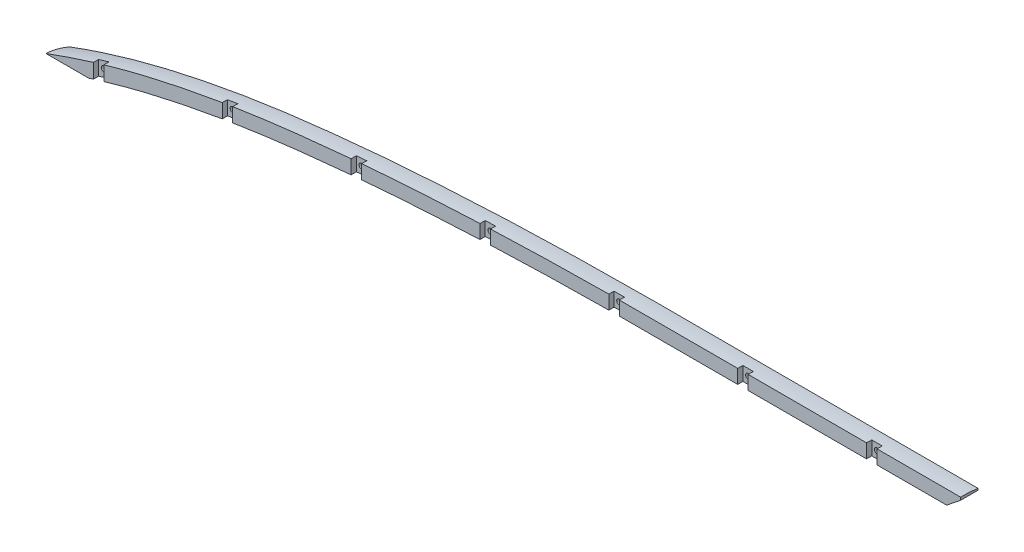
ISO-10303-21;
HEADER;
FILE_DESCRIPTION(('STEP AP214'),'2;1');
FILE_NAME('part.step','',(''),(''),'','','');
FILE_SCHEMA(('AUTOMOTIVE_DESIGN { 1 0 10303 214 1 1 1 1 }'));
ENDSEC;
DATA;
#1=APPLICATION_CONTEXT('core data for automotive mechanical design processes');
#2=APPLICATION_PROTOCOL_DEFINITION('international standard','automotive_design',2000,#1);
#3=PRODUCT_CONTEXT('',#1,'mechanical');
#4=PRODUCT('Part','Part','',(#3));
#5=PRODUCT_RELATED_PRODUCT_CATEGORY('part','',(#4));
#6=PRODUCT_DEFINITION_FORMATION('','',#4);
#7=PRODUCT_DEFINITION_CONTEXT('part definition',#1,'design');
#8=PRODUCT_DEFINITION('design','',#6,#7);
#9=PRODUCT_DEFINITION_SHAPE('','',#8);
#10=(LENGTH_UNIT() NAMED_UNIT(*) SI_UNIT(.MILLI.,.METRE.));
#11=(NAMED_UNIT(*) PLANE_ANGLE_UNIT() SI_UNIT($,.RADIAN.));
#12=(NAMED_UNIT(*) SI_UNIT($,.STERADIAN.) SOLID_ANGLE_UNIT());
#13=UNCERTAINTY_MEASURE_WITH_UNIT(LENGTH_MEASURE(1.E-05),#10,'distance_accuracy_value','');
#14=(GEOMETRIC_REPRESENTATION_CONTEXT(3) GLOBAL_UNCERTAINTY_ASSIGNED_CONTEXT((#13)) GLOBAL_UNIT_ASSIGNED_CONTEXT((#10,
#11,#12)) REPRESENTATION_CONTEXT('',''));
#15=CARTESIAN_POINT('',(0.,0.,0.));
#16=DIRECTION('',(0.,0.,1.));
#17=DIRECTION('',(1.,0.,0.));
#18=AXIS2_PLACEMENT_3D('',#15,#16,#17);
#19=CARTESIAN_POINT('',(-936.614398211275,145.943202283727,-9.525));
#20=DIRECTION('',(0.,0.,1.));
#21=DIRECTION('',(1.,0.,0.));
#22=AXIS2_PLACEMENT_3D('',#19,#20,#21);
#23=CYLINDRICAL_SURFACE('',#22,4.7625);
#24=CARTESIAN_POINT('',(-936.614398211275,145.943202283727,-9.525));
#25=DIRECTION('',(0.,0.,1.));
#26=DIRECTION('',(1.,0.,0.));
#27=AXIS2_PLACEMENT_3D('',#24,#25,#26);
#28=CIRCLE('',#27,4.7625);
#29=CARTESIAN_POINT('',(-931.851898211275,145.943202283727,-9.525));
#30=VERTEX_POINT('',#29);
#31=EDGE_CURVE('E937',#30,#30,#28,.T.);
#32=ORIENTED_EDGE('',*,*,#31,.T.);
#33=EDGE_LOOP('',(#32));
#34=FACE_BOUND('',#33,.T.);
#35=CARTESIAN_POINT('',(-936.614398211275,145.943202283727,-25.3999999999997));
#36=DIRECTION('',(0.,0.,-1.));
#37=DIRECTION('',(-1.,0.,0.));
#38=AXIS2_PLACEMENT_3D('',#35,#36,#37);
#39=CIRCLE('',#38,4.7625);
#40=CARTESIAN_POINT('',(-941.376898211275,145.943202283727,-25.3999999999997));
#41=VERTEX_POINT('',#40);
#42=EDGE_CURVE('E979',#41,#41,#39,.F.);
#43=ORIENTED_EDGE('',*,*,#42,.F.);
#44=EDGE_LOOP('',(#43));
#45=FACE_BOUND('',#44,.T.);
#46=ADVANCED_FACE('F34',(#34,#45),#23,.F.);
#47=CARTESIAN_POINT('',(-701.664398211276,198.976840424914,-9.525));
#48=DIRECTION('',(0.,0.,1.));
#49=DIRECTION('',(1.,0.,0.));
#50=AXIS2_PLACEMENT_3D('',#47,#48,#49);
#51=CYLINDRICAL_SURFACE('',#50,4.7625);
#52=CARTESIAN_POINT('',(-701.664398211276,198.976840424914,-9.525));
#53=DIRECTION('',(0.,0.,1.));
#54=DIRECTION('',(1.,0.,0.));
#55=AXIS2_PLACEMENT_3D('',#52,#53,#54);
#56=CIRCLE('',#55,4.7625);
#57=CARTESIAN_POINT('',(-696.901898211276,198.976840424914,-9.525));
#58=VERTEX_POINT('',#57);
#59=EDGE_CURVE('E934',#58,#58,#56,.T.);
#60=ORIENTED_EDGE('',*,*,#59,.T.);
#61=EDGE_LOOP('',(#60));
#62=FACE_BOUND('',#61,.T.);
#63=CARTESIAN_POINT('',(-701.664398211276,198.976840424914,-25.3999999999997));
#64=DIRECTION('',(0.,0.,-1.));
#65=DIRECTION('',(-1.,0.,0.));
#66=AXIS2_PLACEMENT_3D('',#63,#64,#65);
#67=CIRCLE('',#66,4.7625);
#68=CARTESIAN_POINT('',(-706.426898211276,198.976840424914,-25.3999999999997));
#69=VERTEX_POINT('',#68);
#70=EDGE_CURVE('E972',#69,#69,#67,.F.);
#71=ORIENTED_EDGE('',*,*,#70,.F.);
#72=EDGE_LOOP('',(#71));
#73=FACE_BOUND('',#72,.T.);
#74=ADVANCED_FACE('F716',(#62,#73),#51,.F.);
#75=CARTESIAN_POINT('',(-466.714398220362,227.222283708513,-9.525));
#76=DIRECTION('',(0.,0.,1.));
#77=DIRECTION('',(1.,0.,0.));
#78=AXIS2_PLACEMENT_3D('',#75,#76,#77);
#79=CYLINDRICAL_SURFACE('',#78,4.7625);
#80=CARTESIAN_POINT('',(-466.714398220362,227.222283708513,-9.525));
#81=DIRECTION('',(0.,0.,1.));
#82=DIRECTION('',(1.,0.,0.));
#83=AXIS2_PLACEMENT_3D('',#80,#81,#82);
#84=CIRCLE('',#83,4.7625);
#85=CARTESIAN_POINT('',(-461.951898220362,227.222283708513,-9.525));
#86=VERTEX_POINT('',#85);
#87=EDGE_CURVE('E931',#86,#86,#84,.T.);
#88=ORIENTED_EDGE('',*,*,#87,.T.);
#89=EDGE_LOOP('',(#88));
#90=FACE_BOUND('',#89,.T.);
#91=CARTESIAN_POINT('',(-466.714398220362,227.222283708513,-25.3999999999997));
#92=DIRECTION('',(0.,0.,-1.));
#93=DIRECTION('',(-1.,0.,0.));
#94=AXIS2_PLACEMENT_3D('',#91,#92,#93);
#95=CIRCLE('',#94,4.7625);
#96=CARTESIAN_POINT('',(-471.476898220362,227.222283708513,-25.3999999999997));
#97=VERTEX_POINT('',#96);
#98=EDGE_CURVE('E965',#97,#97,#95,.F.);
#99=ORIENTED_EDGE('',*,*,#98,.F.);
#100=EDGE_LOOP('',(#99));
#101=FACE_BOUND('',#100,.T.);
#102=ADVANCED_FACE('F722',(#90,#101),#79,.F.);
#103=CARTESIAN_POINT('',(-231.764398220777,242.004023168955,-9.525));
#104=DIRECTION('',(0.,0.,1.));
#105=DIRECTION('',(1.,0.,0.));
#106=AXIS2_PLACEMENT_3D('',#103,#104,#105);
#107=CYLINDRICAL_SURFACE('',#106,4.76249999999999);
#108=CARTESIAN_POINT('',(-231.764398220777,242.004023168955,-9.525));
#109=DIRECTION('',(0.,0.,1.));
#110=DIRECTION('',(1.,0.,0.));
#111=AXIS2_PLACEMENT_3D('',#108,#109,#110);
#112=CIRCLE('',#111,4.76249999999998);
#113=CARTESIAN_POINT('',(-227.001898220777,242.004023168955,-9.525));
#114=VERTEX_POINT('',#113);
#115=EDGE_CURVE('E928',#114,#114,#112,.T.);
#116=ORIENTED_EDGE('',*,*,#115,.T.);
#117=EDGE_LOOP('',(#116));
#118=FACE_BOUND('',#117,.T.);
#119=CARTESIAN_POINT('',(-231.764398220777,242.004023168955,-25.3999999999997));
#120=DIRECTION('',(0.,0.,-1.));
#121=DIRECTION('',(-1.,0.,0.));
#122=AXIS2_PLACEMENT_3D('',#119,#120,#121);
#123=CIRCLE('',#122,4.76249999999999);
#124=CARTESIAN_POINT('',(-236.526898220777,242.004023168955,-25.3999999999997));
#125=VERTEX_POINT('',#124);
#126=EDGE_CURVE('E958',#125,#125,#123,.F.);
#127=ORIENTED_EDGE('',*,*,#126,.F.);
#128=EDGE_LOOP('',(#127));
#129=FACE_BOUND('',#128,.T.);
#130=ADVANCED_FACE('F733',(#118,#129),#107,.F.);
#131=CARTESIAN_POINT('',(3.18560177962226,247.675522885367,-9.525));
#132=DIRECTION('',(0.,0.,1.));
#133=DIRECTION('',(1.,0.,0.));
#134=AXIS2_PLACEMENT_3D('',#131,#132,#133);
#135=CYLINDRICAL_SURFACE('',#134,4.76249999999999);
#136=CARTESIAN_POINT('',(3.18560177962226,247.675522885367,-9.525));
#137=DIRECTION('',(0.,0.,1.));
#138=DIRECTION('',(1.,0.,0.));
#139=AXIS2_PLACEMENT_3D('',#136,#137,#138);
#140=CIRCLE('',#139,4.76249999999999);
#141=CARTESIAN_POINT('',(7.94810177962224,247.675522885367,-9.525));
#142=VERTEX_POINT('',#141);
#143=EDGE_CURVE('E925',#142,#142,#140,.T.);
#144=ORIENTED_EDGE('',*,*,#143,.T.);
#145=EDGE_LOOP('',(#144));
#146=FACE_BOUND('',#145,.T.);
#147=CARTESIAN_POINT('',(3.18560177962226,247.675522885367,-25.3999999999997));
#148=DIRECTION('',(0.,0.,-1.));
#149=DIRECTION('',(-1.,0.,0.));
#150=AXIS2_PLACEMENT_3D('',#147,#148,#149);
#151=CIRCLE('',#150,4.76249999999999);
#152=CARTESIAN_POINT('',(-1.57689822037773,247.675522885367,-25.3999999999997));
#153=VERTEX_POINT('',#152);
#154=EDGE_CURVE('E951',#153,#153,#151,.F.);
#155=ORIENTED_EDGE('',*,*,#154,.F.);
#156=EDGE_LOOP('',(#155));
#157=FACE_BOUND('',#156,.T.);
#158=ADVANCED_FACE('F737',(#146,#157),#135,.F.);
#159=CARTESIAN_POINT('',(238.135601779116,247.771379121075,-9.525));
#160=DIRECTION('',(0.,0.,1.));
#161=DIRECTION('',(1.,0.,0.));
#162=AXIS2_PLACEMENT_3D('',#159,#160,#161);
#163=CYLINDRICAL_SURFACE('',#162,4.76249999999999);
#164=CARTESIAN_POINT('',(238.135601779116,247.771379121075,-9.525));
#165=DIRECTION('',(0.,0.,1.));
#166=DIRECTION('',(1.,0.,0.));
#167=AXIS2_PLACEMENT_3D('',#164,#165,#166);
#168=CIRCLE('',#167,4.76249999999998);
#169=CARTESIAN_POINT('',(242.898101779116,247.771379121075,-9.525));
#170=VERTEX_POINT('',#169);
#171=EDGE_CURVE('E914',#170,#170,#168,.T.);
#172=ORIENTED_EDGE('',*,*,#171,.T.);
#173=EDGE_LOOP('',(#172));
#174=FACE_BOUND('',#173,.T.);
#175=CARTESIAN_POINT('',(238.135601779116,247.771379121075,-25.3999999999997));
#176=DIRECTION('',(0.,0.,-1.));
#177=DIRECTION('',(-1.,0.,0.));
#178=AXIS2_PLACEMENT_3D('',#175,#176,#177);
#179=CIRCLE('',#178,4.76249999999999);
#180=CARTESIAN_POINT('',(233.373101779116,247.771379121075,-25.3999999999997));
#181=VERTEX_POINT('',#180);
#182=EDGE_CURVE('E944',#181,#181,#179,.F.);
#183=ORIENTED_EDGE('',*,*,#182,.F.);
#184=EDGE_LOOP('',(#183));
#185=FACE_BOUND('',#184,.T.);
#186=ADVANCED_FACE('F741',(#174,#185),#163,.F.);
#187=CARTESIAN_POINT('',(473.085601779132,247.649995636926,-9.525));
#188=DIRECTION('',(0.,0.,1.));
#189=DIRECTION('',(1.,0.,0.));
#190=AXIS2_PLACEMENT_3D('',#187,#188,#189);
#191=CYLINDRICAL_SURFACE('',#190,4.7625);
#192=CARTESIAN_POINT('',(473.085601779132,247.649995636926,-9.525));
#193=DIRECTION('',(0.,0.,1.));
#194=DIRECTION('',(1.,0.,0.));
#195=AXIS2_PLACEMENT_3D('',#192,#193,#194);
#196=CIRCLE('',#195,4.7625);
#197=CARTESIAN_POINT('',(477.848101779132,247.649995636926,-9.525));
#198=VERTEX_POINT('',#197);
#199=EDGE_CURVE('E912',#198,#198,#196,.T.);
#200=ORIENTED_EDGE('',*,*,#199,.T.);
#201=EDGE_LOOP('',(#200));
#202=FACE_BOUND('',#201,.T.);
#203=CARTESIAN_POINT('',(473.085601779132,247.649995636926,-25.3999999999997));
#204=DIRECTION('',(0.,0.,-1.));
#205=DIRECTION('',(-1.,0.,0.));
#206=AXIS2_PLACEMENT_3D('',#203,#204,#205);
#207=CIRCLE('',#206,4.7625);
#208=CARTESIAN_POINT('',(468.323101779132,247.649995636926,-25.3999999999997));
#209=VERTEX_POINT('',#208);
#210=EDGE_CURVE('E939',#209,#209,#207,.F.);
#211=ORIENTED_EDGE('',*,*,#210,.F.);
#212=EDGE_LOOP('',(#211));
#213=FACE_BOUND('',#212,.T.);
#214=ADVANCED_FACE('F745',(#202,#213),#191,.F.);
#215=CARTESIAN_POINT('',(-1096.30575446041,261.684051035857,2.4980018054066E-13));
#216=DIRECTION('',(0.,0.,-1.));
#217=DIRECTION('',(-1.,0.,0.));
#218=AXIS2_PLACEMENT_3D('',#215,#216,#217);
#219=PLANE('',#218);
#220=CARTESIAN_POINT('',(463.560601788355,234.949999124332,0.));
#221=CARTESIAN_POINT('',(447.804729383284,234.949999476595,0.));
#222=CARTESIAN_POINT('',(432.048857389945,234.949999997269,0.));
#223=CARTESIAN_POINT('',(398.067399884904,234.950000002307,0.));
#224=CARTESIAN_POINT('',(379.841791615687,234.950002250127,0.));
#225=CARTESIAN_POINT('',(352.503454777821,234.949998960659,0.));
#226=CARTESIAN_POINT('',(343.391103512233,234.949964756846,0.));
#227=CARTESIAN_POINT('',(329.721124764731,234.950002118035,0.));
#228=CARTESIAN_POINT('',(325.164668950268,234.950151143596,0.));
#229=CARTESIAN_POINT('',(316.053878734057,234.94993280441,0.));
#230=CARTESIAN_POINT('',(311.491436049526,234.949624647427,0.));
#231=CARTESIAN_POINT('',(287.165272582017,234.959512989,0.));
#232=CARTESIAN_POINT('',(267.409071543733,234.997295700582,0.));
#233=CARTESIAN_POINT('',(247.660601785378,235.046685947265,0.));
#234=B_SPLINE_CURVE_WITH_KNOTS('',3,(#220,#221,#222,#223,#224,#225,#226,#227,#228,#229,#230,
#231,#232,#233),.UNSPECIFIED.,.F.,.F.,(4,2,2,2,2,2,4),(0.0979846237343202,0.125000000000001,
0.156250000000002,0.171875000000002,0.179687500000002,0.187500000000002,0.221343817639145),.UNSPECIFIED.);
#235=CARTESIAN_POINT('',(463.560601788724,234.950074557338,0.));
#236=VERTEX_POINT('',#235);
#237=CARTESIAN_POINT('',(247.660601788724,235.046776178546,0.));
#238=VERTEX_POINT('',#237);
#239=EDGE_CURVE('E498',#236,#238,#234,.T.);
#240=ORIENTED_EDGE('',*,*,#239,.F.);
#241=DIRECTION('',(0.,-1.,0.));
#242=VECTOR('',#241,1.);
#243=CARTESIAN_POINT('',(463.560601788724,304.457522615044,0.));
#244=LINE('',#243,#242);
#245=CARTESIAN_POINT('',(463.560601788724,260.349999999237,0.));
#246=VERTEX_POINT('',#245);
#247=EDGE_CURVE('E911',#246,#236,#244,.T.);
#248=ORIENTED_EDGE('',*,*,#247,.F.);
#249=CARTESIAN_POINT('',(1492.25,0.793750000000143,-4.66136534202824E-13));
#250=CARTESIAN_POINT('',(1492.21582639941,2.14485212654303,-4.61415004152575E-13));
#251=CARTESIAN_POINT('',(1492.15078911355,4.71619414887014,-4.52429252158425E-13));
#252=CARTESIAN_POINT('',(1491.8134288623,8.75174252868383,-4.38297905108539E-13));
#253=CARTESIAN_POINT('',(1491.27507361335,12.925469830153,-4.2365949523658E-13));
#254=CARTESIAN_POINT('',(1490.40677768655,17.6656455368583,-4.07002937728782E-13));
#255=CARTESIAN_POINT('',(1489.19784787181,22.6439822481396,-3.89473131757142E-13));
#256=CARTESIAN_POINT('',(1487.61805663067,27.7630904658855,-3.71406409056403E-13));
#257=CARTESIAN_POINT('',(1485.7000462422,32.8827389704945,-3.53296381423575E-13));
#258=CARTESIAN_POINT('',(1483.25058427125,38.3646195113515,-3.3385654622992E-13));
#259=CARTESIAN_POINT('',(1480.22025005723,44.0192595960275,-3.13742390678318E-13));
#260=CARTESIAN_POINT('',(1476.79485787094,49.3799018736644,-2.94606343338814E-13));
#261=CARTESIAN_POINT('',(1467.46570449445,61.9168794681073,-2.49691291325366E-13));
#262=CARTESIAN_POINT('',(1440.70498590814,83.8406115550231,-1.69867899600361E-13));
#263=CARTESIAN_POINT('',(1399.04342763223,114.177065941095,0.));
#264=CARTESIAN_POINT('',(1347.14684056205,141.77560733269,0.));
#265=CARTESIAN_POINT('',(1296.02361845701,164.408518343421,1.29151052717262E-13));
#266=CARTESIAN_POINT('',(1245.06850637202,183.48584456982,2.01999138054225E-13));
#267=CARTESIAN_POINT('',(1177.60031716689,204.661680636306,2.84196329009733E-13));
#268=CARTESIAN_POINT('',(1092.92614512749,224.836541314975,3.65005690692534E-13));
#269=CARTESIAN_POINT('',(991.026676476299,241.848338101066,4.36880700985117E-13));
#270=CARTESIAN_POINT('',(889.176798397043,252.160122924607,4.85356685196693E-13));
#271=CARTESIAN_POINT('',(770.569527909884,259.168263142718,5.24350183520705E-13));
#272=CARTESIAN_POINT('',(682.336944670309,260.370064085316,5.39351264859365E-13));
#273=CARTESIAN_POINT('',(622.15321345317,260.348501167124,5.46646116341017E-13));
#274=CARTESIAN_POINT('',(606.614810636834,260.350515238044,5.48555991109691E-13));
#275=CARTESIAN_POINT('',(590.183466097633,260.349905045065,5.50566053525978E-13));
#276=CARTESIAN_POINT('',(574.264917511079,260.350027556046,5.52515876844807E-13));
#277=CARTESIAN_POINT('',(559.630951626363,260.349992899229,5.54307840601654E-13));
#278=CARTESIAN_POINT('',(542.301096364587,260.350002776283,5.56430100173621E-13));
#279=CARTESIAN_POINT('',(525.486068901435,260.349999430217,5.5848926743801E-13));
#280=CARTESIAN_POINT('',(508.543111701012,260.350000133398,5.6056411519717E-13));
#281=CARTESIAN_POINT('',(494.937919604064,260.349999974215,5.62230215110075E-13));
#282=CARTESIAN_POINT('',(481.71664822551,260.350000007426,5.63849300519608E-13));
#283=CARTESIAN_POINT('',(468.238709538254,260.34999999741,5.65499817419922E-13));
#284=CARTESIAN_POINT('',(454.760576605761,260.35000000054,5.67150358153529E-13));
#285=CARTESIAN_POINT('',(441.539809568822,260.349999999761,5.68769381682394E-13));
#286=CARTESIAN_POINT('',(428.575328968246,260.350000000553,5.70357020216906E-13));
#287=CARTESIAN_POINT('',(415.226602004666,260.349999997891,5.71991713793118E-13));
#288=CARTESIAN_POINT('',(401.235508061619,260.350000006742,5.73705072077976E-13));
#289=CARTESIAN_POINT('',(389.428230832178,260.349999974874,5.75150998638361E-13));
#290=CARTESIAN_POINT('',(378.51565674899,260.35000005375,5.76487359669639E-13));
#291=CARTESIAN_POINT('',(369.786879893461,260.349999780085,5.77556290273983E-13));
#292=CARTESIAN_POINT('',(360.031805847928,260.350000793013,5.78750906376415E-13));
#293=CARTESIAN_POINT('',(350.661466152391,260.349996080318,5.79898387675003E-13));
#294=CARTESIAN_POINT('',(341.037066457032,260.350010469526,5.81077048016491E-13));
#295=CARTESIAN_POINT('',(330.898025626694,260.349950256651,5.82318471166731E-13));
#296=CARTESIAN_POINT('',(321.399734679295,260.35022414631,5.83482594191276E-13));
#297=CARTESIAN_POINT('',(210.628623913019,260.34248487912,5.9702067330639E-13));
#298=CARTESIAN_POINT('',(53.4082296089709,261.683051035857,6.2095454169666E-13));
#299=CARTESIAN_POINT('',(-152.454222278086,258.183281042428,6.33945213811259E-13));
#300=CARTESIAN_POINT('',(-304.904766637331,251.81740766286,6.30388089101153E-13));
#301=CARTESIAN_POINT('',(-440.424590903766,242.866951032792,6.15733598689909E-13));
#302=CARTESIAN_POINT('',(-558.943042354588,231.266699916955,5.89745406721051E-13));
#303=CARTESIAN_POINT('',(-660.714412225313,218.924196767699,5.59114798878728E-13));
#304=CARTESIAN_POINT('',(-762.460038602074,201.879033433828,5.12061797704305E-13));
#305=CARTESIAN_POINT('',(-864.37341299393,180.000996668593,4.48155461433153E-13));
#306=CARTESIAN_POINT('',(-966.359094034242,151.355333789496,3.60628953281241E-13));
#307=CARTESIAN_POINT('',(-1050.69033612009,120.907966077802,2.64649856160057E-13));
#308=CARTESIAN_POINT('',(-1118.18156361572,92.5477985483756,1.7389593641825E-13));
#309=CARTESIAN_POINT('',(-1151.54570991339,76.1178043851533,1.20616746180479E-13));
#310=CARTESIAN_POINT('',(-1168.4,67.8180000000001,0.));
#311=B_SPLINE_CURVE_WITH_KNOTS('',3,(#249,#250,#251,#252,#253,#254,#255,#256,#257,#258,#259,
#260,#261,#262,#263,#264,#265,#266,#267,#268,#269,#270,#271,#272,#273,#274,#275,#276,#277,#278,
#279,#280,#281,#282,#283,#284,#285,#286,#287,#288,#289,#290,#291,#292,#293,#294,#295,#296,#297,
#298,#299,#300,#301,#302,#303,#304,#305,#306,#307,#308,#309,#310),.UNSPECIFIED.,.F.,.F.,(4,1,1,
1,1,1,1,1,1,1,1,1,1,1,1,1,1,1,1,1,1,1,1,1,1,1,1,1,1,1,1,1,1,1,1,1,1,1,1,1,1,1,1,1,1,1,1,1,1,1,1,
1,1,1,1,1,1,1,1,4),(0.,0.00146410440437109,0.00278640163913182,0.00438570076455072,
0.00602205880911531,0.00800541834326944,0.00993284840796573,0.0118232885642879,
0.0139257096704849,0.0164340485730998,0.0187666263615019,0.0208135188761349,0.033341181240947,
0.0558426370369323,0.0767378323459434,0.0968197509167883,0.116414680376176,0.135650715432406,
0.173408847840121,0.210614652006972,0.247510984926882,0.284271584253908,0.339322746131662,
0.343083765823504,0.349481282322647,0.356158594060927,0.360887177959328,0.36672906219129,
0.372014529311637,0.379664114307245,0.384948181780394,0.390372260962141,0.394405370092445,
0.399273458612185,0.404975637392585,0.409008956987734,0.413598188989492,0.419022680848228,
0.423472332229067,0.428757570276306,0.431815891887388,0.435296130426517,0.43821521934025,
0.442385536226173,0.445448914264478,0.448643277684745,0.453371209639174,0.455740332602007,
0.568664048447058,0.623715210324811,0.678804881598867,0.733975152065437,0.770843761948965,
0.807823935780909,0.84502973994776,0.882582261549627,0.92071299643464,0.959712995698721,
0.979648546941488,1.),.UNSPECIFIED.);
#312=CARTESIAN_POINT('',(247.660601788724,260.446773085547,0.));
#313=VERTEX_POINT('',#312);
#314=EDGE_CURVE('E325',#246,#313,#311,.T.);
#315=ORIENTED_EDGE('',*,*,#314,.T.);
#316=DIRECTION('',(0.,1.,0.));
#317=VECTOR('',#316,1.);
#318=CARTESIAN_POINT('',(247.660601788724,304.457522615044,0.));
#319=LINE('',#318,#317);
#320=EDGE_CURVE('E781',#238,#313,#319,.T.);
#321=ORIENTED_EDGE('',*,*,#320,.F.);
#322=EDGE_LOOP('',(#240,#248,#315,#321));
#323=FACE_BOUND('',#322,.T.);
#324=ADVANCED_FACE('F749',(#323),#219,.F.);
#325=CARTESIAN_POINT('',(228.610601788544,235.097333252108,0.));
#326=CARTESIAN_POINT('',(218.242624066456,235.126204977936,0.));
#327=CARTESIAN_POINT('',(171.42363088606,235.263799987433,0.));
#328=CARTESIAN_POINT('',(124.648406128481,235.380281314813,0.));
#329=CARTESIAN_POINT('',(63.0611891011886,235.319587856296,0.));
#330=CARTESIAN_POINT('',(37.8801485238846,235.233549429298,0.));
#331=CARTESIAN_POINT('',(12.7106017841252,235.049950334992,0.));
#332=B_SPLINE_CURVE_WITH_KNOTS('',3,(#325,#326,#327,#328,#329,#330,#331),.UNSPECIFIED.,.F.,.F.,
(4,1,2,4),(0.232227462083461,0.250000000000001,0.312500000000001,0.35577002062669),.UNSPECIFIED.);
#333=CARTESIAN_POINT('',(228.610601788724,235.097354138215,0.));
#334=VERTEX_POINT('',#333);
#335=CARTESIAN_POINT('',(12.7106017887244,235.049919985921,0.));
#336=VERTEX_POINT('',#335);
#337=EDGE_CURVE('E474',#334,#336,#332,.T.);
#338=ORIENTED_EDGE('',*,*,#337,.F.);
#339=DIRECTION('',(0.,-1.,0.));
#340=VECTOR('',#339,1.);
#341=CARTESIAN_POINT('',(228.610601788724,304.457522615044,0.));
#342=LINE('',#341,#340);
#343=CARTESIAN_POINT('',(228.610601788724,260.497436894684,0.));
#344=VERTEX_POINT('',#343);
#345=EDGE_CURVE('E777',#344,#334,#342,.T.);
#346=ORIENTED_EDGE('',*,*,#345,.F.);
#347=CARTESIAN_POINT('',(12.7106017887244,260.451053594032,0.));
#348=VERTEX_POINT('',#347);
#349=EDGE_CURVE('E328',#344,#348,#311,.T.);
#350=ORIENTED_EDGE('',*,*,#349,.T.);
#351=DIRECTION('',(0.,1.,0.));
#352=VECTOR('',#351,1.);
#353=CARTESIAN_POINT('',(12.7106017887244,304.457522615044,0.));
#354=LINE('',#353,#352);
#355=EDGE_CURVE('E828',#336,#348,#354,.T.);
#356=ORIENTED_EDGE('',*,*,#355,.F.);
#357=EDGE_LOOP('',(#338,#346,#350,#356));
#358=FACE_BOUND('',#357,.T.);
#359=ADVANCED_FACE('F869',(#358),#219,.F.);
#360=CARTESIAN_POINT('',(-6.33939821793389,234.891757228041,0.));
#361=CARTESIAN_POINT('',(-11.1733979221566,234.846585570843,0.));
#362=CARTESIAN_POINT('',(-16.0069968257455,234.797475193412,0.));
#363=CARTESIAN_POINT('',(-57.1815201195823,234.343350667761,0.));
#364=CARTESIAN_POINT('',(-93.5034907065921,233.710158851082,0.));
#365=CARTESIAN_POINT('',(-147.947851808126,232.300633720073,0.));
#366=CARTESIAN_POINT('',(-166.088934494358,231.752766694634,0.));
#367=CARTESIAN_POINT('',(-196.900414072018,230.684486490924,0.));
#368=CARTESIAN_POINT('',(-209.570588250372,230.206077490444,0.));
#369=CARTESIAN_POINT('',(-222.239398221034,229.688815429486,0.));
#370=B_SPLINE_CURVE_WITH_KNOTS('',3,(#360,#361,#362,#363,#364,#365,#366,#367,#368,#369),
.UNSPECIFIED.,.F.,.F.,(4,2,2,2,4),(0.366687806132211,0.375,0.4375,0.46875,0.490578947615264),.UNSPECIFIED.);
#371=CARTESIAN_POINT('',(-6.3393982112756,234.891740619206,0.));
#372=VERTEX_POINT('',#371);
#373=CARTESIAN_POINT('',(-222.239398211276,229.688859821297,0.));
#374=VERTEX_POINT('',#373);
#375=EDGE_CURVE('E527',#372,#374,#370,.T.);
#376=ORIENTED_EDGE('',*,*,#375,.F.);
#377=DIRECTION('',(0.,-1.,0.));
#378=VECTOR('',#377,1.);
#379=CARTESIAN_POINT('',(-6.3393982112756,304.457522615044,0.));
#380=LINE('',#379,#378);
#381=CARTESIAN_POINT('',(-6.3393982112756,260.293045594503,0.));
#382=VERTEX_POINT('',#381);
#383=EDGE_CURVE('E873',#382,#372,#380,.T.);
#384=ORIENTED_EDGE('',*,*,#383,.F.);
#385=CARTESIAN_POINT('',(-222.239398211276,255.109891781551,0.));
#386=VERTEX_POINT('',#385);
#387=EDGE_CURVE('E334',#382,#386,#311,.T.);
#388=ORIENTED_EDGE('',*,*,#387,.T.);
#389=DIRECTION('',(0.,1.,0.));
#390=VECTOR('',#389,1.);
#391=CARTESIAN_POINT('',(-222.239398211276,304.457522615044,0.));
#392=LINE('',#391,#390);
#393=EDGE_CURVE('E678',#374,#386,#392,.T.);
#394=ORIENTED_EDGE('',*,*,#393,.F.);
#395=EDGE_LOOP('',(#376,#384,#388,#394));
#396=FACE_BOUND('',#395,.T.);
#397=ADVANCED_FACE('F865',(#396),#219,.F.);
#398=CARTESIAN_POINT('',(-241.289398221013,228.881710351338,0.));
#399=CARTESIAN_POINT('',(-258.54127595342,228.124272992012,0.));
#400=CARTESIAN_POINT('',(-275.790452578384,227.294976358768,0.));
#401=CARTESIAN_POINT('',(-311.164755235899,225.447708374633,0.));
#402=CARTESIAN_POINT('',(-329.28712723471,224.424432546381,0.));
#403=CARTESIAN_POINT('',(-383.608522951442,221.083731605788,0.));
#404=CARTESIAN_POINT('',(-419.769372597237,218.493058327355,0.));
#405=CARTESIAN_POINT('',(-456.303017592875,215.376344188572,0.));
#406=CARTESIAN_POINT('',(-456.746213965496,215.33846042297,0.));
#407=CARTESIAN_POINT('',(-457.189405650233,215.30050281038,0.));
#408=B_SPLINE_CURVE_WITH_KNOTS('',3,(#398,#399,#400,#401,#402,#403,#404,#405,#406,#407),
.UNSPECIFIED.,.F.,.F.,(4,2,2,2,4),(0.501520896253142,0.531249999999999,0.562499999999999,
0.624999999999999,0.625767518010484),.UNSPECIFIED.);
#409=CARTESIAN_POINT('',(-241.289398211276,228.881732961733,0.));
#410=VERTEX_POINT('',#409);
#411=CARTESIAN_POINT('',(-457.189398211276,215.300415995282,0.));
#412=VERTEX_POINT('',#411);
#413=EDGE_CURVE('E613',#410,#412,#408,.T.);
#414=ORIENTED_EDGE('',*,*,#413,.F.);
#415=DIRECTION('',(0.,-1.,0.));
#416=VECTOR('',#415,1.);
#417=CARTESIAN_POINT('',(-241.289398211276,304.457522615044,0.));
#418=LINE('',#417,#416);
#419=CARTESIAN_POINT('',(-241.289398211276,254.306079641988,0.));
#420=VERTEX_POINT('',#419);
#421=EDGE_CURVE('E836',#420,#410,#418,.T.);
#422=ORIENTED_EDGE('',*,*,#421,.F.);
#423=CARTESIAN_POINT('',(-457.189398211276,240.792902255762,0.));
#424=VERTEX_POINT('',#423);
#425=EDGE_CURVE('E340',#420,#424,#311,.T.);
#426=ORIENTED_EDGE('',*,*,#425,.T.);
#427=DIRECTION('',(0.,1.,0.));
#428=VECTOR('',#427,1.);
#429=CARTESIAN_POINT('',(-457.189398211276,304.457522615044,0.));
#430=LINE('',#429,#428);
#431=EDGE_CURVE('E642',#412,#424,#430,.T.);
#432=ORIENTED_EDGE('',*,*,#431,.F.);
#433=EDGE_LOOP('',(#414,#422,#426,#432));
#434=FACE_BOUND('',#433,.T.);
#435=ADVANCED_FACE('F645',(#434),#219,.F.);
#436=CARTESIAN_POINT('',(-476.239398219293,213.623457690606,0.));
#437=CARTESIAN_POINT('',(-487.4866219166,212.606604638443,0.));
#438=CARTESIAN_POINT('',(-507.747904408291,210.6899782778,0.));
#439=CARTESIAN_POINT('',(-527.99864873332,208.62601742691,0.));
#440=CARTESIAN_POINT('',(-546.019266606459,206.732008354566,0.));
#441=CARTESIAN_POINT('',(-555.029880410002,205.756762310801,0.));
#442=CARTESIAN_POINT('',(-582.034383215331,202.746635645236,0.));
#443=CARTESIAN_POINT('',(-599.997936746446,200.62308845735,0.));
#444=CARTESIAN_POINT('',(-626.869023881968,197.17997628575,0.));
#445=CARTESIAN_POINT('',(-635.813680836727,195.989314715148,0.));
#446=CARTESIAN_POINT('',(-653.675771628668,193.508401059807,0.));
#447=CARTESIAN_POINT('',(-662.591857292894,192.217383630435,0.));
#448=CARTESIAN_POINT('',(-678.385889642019,189.831818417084,0.));
#449=CARTESIAN_POINT('',(-685.265131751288,188.759982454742,0.));
#450=CARTESIAN_POINT('',(-692.139361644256,187.656151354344,0.));
#451=B_SPLINE_CURVE_WITH_KNOTS('',3,(#436,#437,#438,#439,#440,#441,#442,#443,#444,#445,#446,
#447,#448,#449,#450),.UNSPECIFIED.,.F.,.F.,(4,1,2,2,2,2,2,4),(0.636766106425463,
0.656249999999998,0.671874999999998,0.687499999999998,0.718749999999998,0.734374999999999,
0.749999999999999,0.762071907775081),.UNSPECIFIED.);
#452=CARTESIAN_POINT('',(-476.239398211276,213.623457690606,0.));
#453=VERTEX_POINT('',#452);
#454=CARTESIAN_POINT('',(-692.139398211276,187.656379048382,0.));
#455=VERTEX_POINT('',#454);
#456=EDGE_CURVE('E611',#453,#455,#451,.T.);
#457=ORIENTED_EDGE('',*,*,#456,.F.);
#458=DIRECTION('',(0.,-1.,0.));
#459=VECTOR('',#458,1.);
#460=CARTESIAN_POINT('',(-476.239398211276,304.457522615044,0.));
#461=LINE('',#460,#459);
#462=CARTESIAN_POINT('',(-476.239398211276,239.126408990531,0.));
#463=VERTEX_POINT('',#462);
#464=EDGE_CURVE('E359',#463,#453,#461,.T.);
#465=ORIENTED_EDGE('',*,*,#464,.F.);
#466=CARTESIAN_POINT('',(-692.139398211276,213.377814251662,0.));
#467=VERTEX_POINT('',#466);
#468=EDGE_CURVE('E323',#463,#467,#311,.T.);
#469=ORIENTED_EDGE('',*,*,#468,.T.);
#470=DIRECTION('',(0.,1.,0.));
#471=VECTOR('',#470,1.);
#472=CARTESIAN_POINT('',(-692.139398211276,304.457522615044,0.));
#473=LINE('',#472,#471);
#474=EDGE_CURVE('E358',#455,#467,#473,.T.);
#475=ORIENTED_EDGE('',*,*,#474,.F.);
#476=EDGE_LOOP('',(#457,#465,#469,#475));
#477=FACE_BOUND('',#476,.T.);
#478=ADVANCED_FACE('F357',(#477),#219,.F.);
#479=CARTESIAN_POINT('',(-711.189342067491,184.513136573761,0.));
#480=CARTESIAN_POINT('',(-715.749433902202,183.740631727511,0.));
#481=CARTESIAN_POINT('',(-729.187809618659,181.421390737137,0.));
#482=CARTESIAN_POINT('',(-742.605097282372,178.979863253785,0.));
#483=CARTESIAN_POINT('',(-760.318723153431,175.64645881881,0.));
#484=CARTESIAN_POINT('',(-769.164554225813,173.927395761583,0.));
#485=CARTESIAN_POINT('',(-795.649618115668,168.603682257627,0.));
#486=CARTESIAN_POINT('',(-813.241702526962,164.830737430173,0.));
#487=CARTESIAN_POINT('',(-848.266963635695,156.763334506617,0.));
#488=CARTESIAN_POINT('',(-865.698228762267,152.46701984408,0.));
#489=CARTESIAN_POINT('',(-897.792874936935,143.976034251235,0.));
#490=CARTESIAN_POINT('',(-912.477829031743,139.864804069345,0.));
#491=CARTESIAN_POINT('',(-927.089426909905,135.53361928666,0.));
#492=B_SPLINE_CURVE_WITH_KNOTS('',3,(#479,#480,#481,#482,#483,#484,#485,#486,#487,#488,#489,
#490,#491),.UNSPECIFIED.,.F.,.F.,(4,1,2,2,2,2,4),(0.773230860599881,0.781249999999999,
0.796874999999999,0.8125,0.84375,0.875,0.90156732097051),.UNSPECIFIED.);
#493=CARTESIAN_POINT('',(-711.189398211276,184.513467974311,0.));
#494=VERTEX_POINT('',#493);
#495=CARTESIAN_POINT('',(-927.089398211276,135.533522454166,0.));
#496=VERTEX_POINT('',#495);
#497=EDGE_CURVE('E608',#494,#496,#492,.T.);
#498=ORIENTED_EDGE('',*,*,#497,.F.);
#499=DIRECTION('',(0.,-1.,0.));
#500=VECTOR('',#499,1.);
#501=CARTESIAN_POINT('',(-711.189398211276,304.457522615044,0.));
#502=LINE('',#501,#500);
#503=CARTESIAN_POINT('',(-711.189398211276,210.270885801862,0.));
#504=VERTEX_POINT('',#503);
#505=EDGE_CURVE('E371',#504,#494,#502,.T.);
#506=ORIENTED_EDGE('',*,*,#505,.F.);
#507=CARTESIAN_POINT('',(-927.089398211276,162.006780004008,0.));
#508=VERTEX_POINT('',#507);
#509=EDGE_CURVE('E317',#504,#508,#311,.T.);
#510=ORIENTED_EDGE('',*,*,#509,.T.);
#511=DIRECTION('',(0.,1.,0.));
#512=VECTOR('',#511,1.);
#513=CARTESIAN_POINT('',(-927.089398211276,304.457522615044,0.));
#514=LINE('',#513,#512);
#515=EDGE_CURVE('E391',#496,#508,#514,.T.);
#516=ORIENTED_EDGE('',*,*,#515,.F.);
#517=EDGE_LOOP('',(#498,#506,#510,#516));
#518=FACE_BOUND('',#517,.T.);
#519=ADVANCED_FACE('F856',(#518),#219,.F.);
#520=CARTESIAN_POINT('',(-946.139404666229,129.748115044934,0.));
#521=CARTESIAN_POINT('',(-949.055025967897,128.841141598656,0.));
#522=CARTESIAN_POINT('',(-951.967551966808,127.925139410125,0.));
#523=CARTESIAN_POINT('',(-954.876996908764,127.000000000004,0.));
#524=B_SPLINE_CURVE_WITH_KNOTS('',3,(#520,#521,#522,#523),.UNSPECIFIED.,.F.,.F.,(4,4),
(0.913139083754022,0.918464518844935),.UNSPECIFIED.);
#525=CARTESIAN_POINT('',(-946.139398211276,129.748094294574,0.));
#526=VERTEX_POINT('',#525);
#527=CARTESIAN_POINT('',(-954.876996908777,127.,0.));
#528=VERTEX_POINT('',#527);
#529=EDGE_CURVE('E612',#526,#528,#524,.T.);
#530=ORIENTED_EDGE('',*,*,#529,.F.);
#531=DIRECTION('',(0.,-1.,0.));
#532=VECTOR('',#531,1.);
#533=CARTESIAN_POINT('',(-946.139398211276,304.457522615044,0.));
#534=LINE('',#533,#532);
#535=CARTESIAN_POINT('',(-946.139398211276,156.326867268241,0.));
#536=VERTEX_POINT('',#535);
#537=EDGE_CURVE('E378',#536,#526,#534,.T.);
#538=ORIENTED_EDGE('',*,*,#537,.F.);
#539=CARTESIAN_POINT('',(-1032.62639821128,127.000000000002,2.83707945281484E-13));
#540=VERTEX_POINT('',#539);
#541=EDGE_CURVE('E316',#536,#540,#311,.T.);
#542=ORIENTED_EDGE('',*,*,#541,.T.);
#543=DIRECTION('',(-1.,0.,0.));
#544=VECTOR('',#543,1.);
#545=CARTESIAN_POINT('',(-954.876996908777,127.,0.));
#546=LINE('',#545,#544);
#547=EDGE_CURVE('E506',#528,#540,#546,.T.);
#548=ORIENTED_EDGE('',*,*,#547,.F.);
#549=EDGE_LOOP('',(#530,#538,#542,#548));
#550=FACE_BOUND('',#549,.T.);
#551=ADVANCED_FACE('F625',(#550),#219,.F.);
#552=CARTESIAN_POINT('',(634.999999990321,261.684051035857,-31.7499999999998));
#553=DIRECTION('',(0.,0.,1.));
#554=DIRECTION('',(1.,0.,0.));
#555=AXIS2_PLACEMENT_3D('',#552,#553,#554);
#556=PLANE('',#555);
#557=CARTESIAN_POINT('',(-936.614398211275,145.943202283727,-31.7499999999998));
#558=DIRECTION('',(0.,0.,-1.));
#559=DIRECTION('',(-1.,0.,0.));
#560=AXIS2_PLACEMENT_3D('',#557,#558,#559);
#561=CIRCLE('',#560,6.34999999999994);
#562=CARTESIAN_POINT('',(-942.964398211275,145.943202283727,-31.7499999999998));
#563=VERTEX_POINT('',#562);
#564=EDGE_CURVE('E982',#563,#563,#561,.T.);
#565=ORIENTED_EDGE('',*,*,#564,.F.);
#566=EDGE_LOOP('',(#565));
#567=FACE_BOUND('',#566,.T.);
#568=CARTESIAN_POINT('',(-701.664398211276,198.976840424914,-31.7499999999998));
#569=DIRECTION('',(0.,0.,-1.));
#570=DIRECTION('',(-1.,0.,0.));
#571=AXIS2_PLACEMENT_3D('',#568,#569,#570);
#572=CIRCLE('',#571,6.34999999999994);
#573=CARTESIAN_POINT('',(-708.014398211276,198.976840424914,-31.7499999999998));
#574=VERTEX_POINT('',#573);
#575=EDGE_CURVE('E975',#574,#574,#572,.T.);
#576=ORIENTED_EDGE('',*,*,#575,.F.);
#577=EDGE_LOOP('',(#576));
#578=FACE_BOUND('',#577,.T.);
#579=CARTESIAN_POINT('',(-466.714398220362,227.222283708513,-31.7499999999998));
#580=DIRECTION('',(0.,0.,-1.));
#581=DIRECTION('',(-1.,0.,0.));
#582=AXIS2_PLACEMENT_3D('',#579,#580,#581);
#583=CIRCLE('',#582,6.34999999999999);
#584=CARTESIAN_POINT('',(-473.064398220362,227.222283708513,-31.7499999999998));
#585=VERTEX_POINT('',#584);
#586=EDGE_CURVE('E968',#585,#585,#583,.T.);
#587=ORIENTED_EDGE('',*,*,#586,.F.);
#588=EDGE_LOOP('',(#587));
#589=FACE_BOUND('',#588,.T.);
#590=CARTESIAN_POINT('',(-231.764398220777,242.004023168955,-31.7499999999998));
#591=DIRECTION('',(0.,0.,-1.));
#592=DIRECTION('',(-1.,0.,0.));
#593=AXIS2_PLACEMENT_3D('',#590,#591,#592);
#594=CIRCLE('',#593,6.34999999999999);
#595=CARTESIAN_POINT('',(-238.114398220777,242.004023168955,-31.7499999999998));
#596=VERTEX_POINT('',#595);
#597=EDGE_CURVE('E961',#596,#596,#594,.T.);
#598=ORIENTED_EDGE('',*,*,#597,.F.);
#599=EDGE_LOOP('',(#598));
#600=FACE_BOUND('',#599,.T.);
#601=CARTESIAN_POINT('',(3.18560177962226,247.675522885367,-31.7499999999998));
#602=DIRECTION('',(0.,0.,-1.));
#603=DIRECTION('',(-1.,0.,0.));
#604=AXIS2_PLACEMENT_3D('',#601,#602,#603);
#605=CIRCLE('',#604,6.35);
#606=CARTESIAN_POINT('',(-3.16439822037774,247.675522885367,-31.7499999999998));
#607=VERTEX_POINT('',#606);
#608=EDGE_CURVE('E954',#607,#607,#605,.T.);
#609=ORIENTED_EDGE('',*,*,#608,.F.);
#610=EDGE_LOOP('',(#609));
#611=FACE_BOUND('',#610,.T.);
#612=CARTESIAN_POINT('',(238.135601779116,247.771379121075,-31.7499999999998));
#613=DIRECTION('',(0.,0.,-1.));
#614=DIRECTION('',(-1.,0.,0.));
#615=AXIS2_PLACEMENT_3D('',#612,#613,#614);
#616=CIRCLE('',#615,6.34999999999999);
#617=CARTESIAN_POINT('',(231.785601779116,247.771379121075,-31.7499999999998));
#618=VERTEX_POINT('',#617);
#619=EDGE_CURVE('E947',#618,#618,#616,.T.);
#620=ORIENTED_EDGE('',*,*,#619,.F.);
#621=EDGE_LOOP('',(#620));
#622=FACE_BOUND('',#621,.T.);
#623=CARTESIAN_POINT('',(473.085601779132,247.649995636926,-31.7499999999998));
#624=DIRECTION('',(0.,0.,-1.));
#625=DIRECTION('',(-1.,0.,0.));
#626=AXIS2_PLACEMENT_3D('',#623,#624,#625);
#627=CIRCLE('',#626,6.34999999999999);
#628=CARTESIAN_POINT('',(466.735601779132,247.649995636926,-31.7499999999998));
#629=VERTEX_POINT('',#628);
#630=EDGE_CURVE('E940',#629,#629,#627,.T.);
#631=ORIENTED_EDGE('',*,*,#630,.F.);
#632=EDGE_LOOP('',(#631));
#633=FACE_BOUND('',#632,.T.);
#634=DIRECTION('',(-0.780866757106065,-0.624697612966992,0.));
#635=VECTOR('',#634,1.);
#636=CARTESIAN_POINT('',(638.128809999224,257.773064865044,-31.7499999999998));
#637=LINE('',#636,#635);
#638=CARTESIAN_POINT('',(634.99999999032,255.270000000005,-31.7499999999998));
#639=VERTEX_POINT('',#638);
#640=CARTESIAN_POINT('',(609.599999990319,234.949853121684,-31.7499999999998));
#641=VERTEX_POINT('',#640);
#642=EDGE_CURVE('E255',#639,#641,#637,.T.);
#643=ORIENTED_EDGE('',*,*,#642,.T.);
#644=CARTESIAN_POINT('',(634.98638759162,234.950003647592,-31.7499999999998));
#645=CARTESIAN_POINT('',(632.718101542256,234.951219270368,-31.7499999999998));
#646=CARTESIAN_POINT('',(630.445923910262,234.951104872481,-31.7499999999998));
#647=CARTESIAN_POINT('',(625.893740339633,234.950308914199,-31.7499999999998));
#648=CARTESIAN_POINT('',(623.612532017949,234.94976876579,-31.7499999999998));
#649=CARTESIAN_POINT('',(616.773327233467,234.949236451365,-31.7499999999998));
#650=CARTESIAN_POINT('',(612.215800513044,234.949711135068,-31.7499999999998));
#651=CARTESIAN_POINT('',(598.549116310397,234.950456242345,-31.7499999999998));
#652=CARTESIAN_POINT('',(589.436111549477,234.949951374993,-31.7499999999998));
#653=CARTESIAN_POINT('',(562.097269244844,234.950040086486,-31.7499999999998));
#654=CARTESIAN_POINT('',(543.872082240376,234.950001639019,-31.7499999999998));
#655=CARTESIAN_POINT('',(489.195318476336,234.949997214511,-31.7499999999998));
#656=CARTESIAN_POINT('',(452.744153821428,234.9499999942,-31.7499999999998));
#657=CARTESIAN_POINT('',(398.067399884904,234.950000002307,-31.7499999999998));
#658=CARTESIAN_POINT('',(379.841791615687,234.950002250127,-31.7499999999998));
#659=CARTESIAN_POINT('',(352.503454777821,234.949998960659,-31.7499999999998));
#660=CARTESIAN_POINT('',(343.391103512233,234.949964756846,-31.7499999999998));
#661=CARTESIAN_POINT('',(329.721124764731,234.950002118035,-31.7499999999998));
#662=CARTESIAN_POINT('',(325.164668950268,234.950151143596,-31.7499999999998));
#663=CARTESIAN_POINT('',(316.053878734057,234.94993280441,-31.7499999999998));
#664=CARTESIAN_POINT('',(311.491436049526,234.949624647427,-31.7499999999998));
#665=CARTESIAN_POINT('',(270.43083670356,234.966315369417,-31.7499999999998));
#666=CARTESIAN_POINT('',(197.4865553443,235.198897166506,-31.7499999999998));
#667=CARTESIAN_POINT('',(124.648406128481,235.380281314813,-31.7499999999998));
#668=CARTESIAN_POINT('',(51.8640568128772,235.308553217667,-31.7499999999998));
#669=CARTESIAN_POINT('',(15.5010947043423,235.144986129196,-31.7499999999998));
#670=CARTESIAN_POINT('',(-57.1815201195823,234.343350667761,-31.7499999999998));
#671=CARTESIAN_POINT('',(-93.5034907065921,233.710158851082,-31.7499999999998));
#672=CARTESIAN_POINT('',(-147.947851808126,232.300633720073,-31.7499999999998));
#673=CARTESIAN_POINT('',(-166.088934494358,231.752766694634,-31.7499999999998));
#674=CARTESIAN_POINT('',(-202.369184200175,230.494876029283,-31.7499999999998));
#675=CARTESIAN_POINT('',(-238.644594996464,229.076825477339,-31.7499999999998));
#676=CARTESIAN_POINT('',(-274.90817256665,227.341049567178,-31.7499999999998));
#677=CARTESIAN_POINT('',(-311.164755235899,225.447708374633,-31.7499999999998));
#678=CARTESIAN_POINT('',(-329.28712723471,224.424432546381,-31.7499999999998));
#679=CARTESIAN_POINT('',(-383.608522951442,221.083731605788,-31.7499999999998));
#680=CARTESIAN_POINT('',(-419.769372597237,218.493058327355,-31.7499999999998));
#681=CARTESIAN_POINT('',(-473.905038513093,213.874701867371,-31.7499999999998));
#682=CARTESIAN_POINT('',(-500.96123616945,211.38167717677,-31.7499999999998));
#683=CARTESIAN_POINT('',(-527.99864873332,208.62601742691,-31.7499999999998));
#684=CARTESIAN_POINT('',(-546.019266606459,206.732008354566,-31.7499999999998));
#685=CARTESIAN_POINT('',(-555.029880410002,205.756762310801,-31.7499999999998));
#686=CARTESIAN_POINT('',(-582.034383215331,202.746635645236,-31.7499999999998));
#687=CARTESIAN_POINT('',(-599.997936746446,200.62308845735,-31.7499999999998));
#688=CARTESIAN_POINT('',(-626.869023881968,197.17997628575,-31.7499999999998));
#689=CARTESIAN_POINT('',(-635.813680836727,195.989314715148,-31.7499999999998));
#690=CARTESIAN_POINT('',(-653.675771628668,193.508401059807,-31.7499999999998));
#691=CARTESIAN_POINT('',(-662.591857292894,192.217383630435,-31.7499999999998));
#692=CARTESIAN_POINT('',(-689.322107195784,188.179988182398,-31.7499999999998));
#693=CARTESIAN_POINT('',(-716.005044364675,183.820242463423,-31.7499999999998));
#694=CARTESIAN_POINT('',(-742.605097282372,178.979863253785,-31.7499999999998));
#695=CARTESIAN_POINT('',(-760.318723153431,175.64645881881,-31.7499999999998));
#696=CARTESIAN_POINT('',(-769.164554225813,173.927395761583,-31.7499999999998));
#697=CARTESIAN_POINT('',(-795.649618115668,168.603682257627,-31.7499999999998));
#698=CARTESIAN_POINT('',(-813.241702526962,164.830737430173,-31.7499999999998));
#699=CARTESIAN_POINT('',(-848.266963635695,156.763334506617,-31.7499999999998));
#700=CARTESIAN_POINT('',(-865.698228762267,152.46701984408,-31.7499999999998));
#701=CARTESIAN_POINT('',(-900.392250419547,143.28834136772,-31.7499999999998));
#702=CARTESIAN_POINT('',(-917.652536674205,138.40902597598,-31.7499999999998));
#703=CARTESIAN_POINT('',(-943.386819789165,130.629771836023,-31.7499999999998));
#704=CARTESIAN_POINT('',(-951.938109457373,127.960170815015,-31.7499999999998));
#705=CARTESIAN_POINT('',(-968.987799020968,122.46245626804,-31.7499999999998));
#706=CARTESIAN_POINT('',(-977.488585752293,119.633986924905,-31.7499999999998));
#707=CARTESIAN_POINT('',(-1002.91629389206,110.915535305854,-31.7499999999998));
#708=CARTESIAN_POINT('',(-1019.76856755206,104.792504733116,-31.7499999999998));
#709=CARTESIAN_POINT('',(-1040.70116224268,96.7696827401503,-31.7499999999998));
#710=CARTESIAN_POINT('',(-1044.8810434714,95.1466670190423,-31.7499999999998));
#711=CARTESIAN_POINT('',(-1053.22732090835,91.864218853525,-31.7499999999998));
#712=CARTESIAN_POINT('',(-1057.39589880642,90.2041893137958,-31.7499999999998));
#713=CARTESIAN_POINT('',(-1069.86155173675,85.1759499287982,-31.7499999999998));
#714=CARTESIAN_POINT('',(-1078.11772809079,81.7576918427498,-31.7499999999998));
#715=CARTESIAN_POINT('',(-1086.30695181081,78.2508255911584,-31.7499999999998));
#716=B_SPLINE_CURVE_WITH_KNOTS('',3,(#644,#645,#646,#647,#648,#649,#650,#651,#652,#653,#654,
#655,#656,#657,#658,#659,#660,#661,#662,#663,#664,#665,#666,#667,#668,#669,#670,#671,#672,#673,
#674,#675,#676,#677,#678,#679,#680,#681,#682,#683,#684,#685,#686,#687,#688,#689,#690,#691,#692,
#693,#694,#695,#696,#697,#698,#699,#700,#701,#702,#703,#704,#705,#706,#707,#708,#709,#710,#711,
#712,#713,#714,#715),.UNSPECIFIED.,.F.,.F.,(4,2,2,2,2,2,2,2,2,2,2,1,2,2,2,2,1,2,2,2,1,2,2,2,2,2,
1,2,2,2,2,2,2,2,2,2,2,4),(0.,0.00390625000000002,0.00781250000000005,0.0156250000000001,
0.0312500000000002,0.0625000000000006,0.125000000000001,0.156250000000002,0.171875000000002,
0.179687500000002,0.187500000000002,0.250000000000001,0.312500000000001,0.375,0.4375,0.46875,
0.5,0.531249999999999,0.562499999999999,0.624999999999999,0.656249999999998,0.671874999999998,
0.687499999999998,0.718749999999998,0.734374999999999,0.749999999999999,0.781249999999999,
0.796874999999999,0.8125,0.84375,0.875,0.90625,0.921875,0.9375,0.96875,0.9765625,0.984375,1.),.UNSPECIFIED.);
#717=CARTESIAN_POINT('',(-954.876996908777,127.,-31.7499999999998));
#718=VERTEX_POINT('',#717);
#719=EDGE_CURVE('E39',#641,#718,#716,.T.);
#720=ORIENTED_EDGE('',*,*,#719,.T.);
#721=DIRECTION('',(-1.,0.,0.));
#722=VECTOR('',#721,1.);
#723=CARTESIAN_POINT('',(634.999999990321,127.,-31.7499999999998));
#724=LINE('',#723,#722);
#725=CARTESIAN_POINT('',(-1022.0314162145,127.,-31.7499999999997));
#726=VERTEX_POINT('',#725);
#727=EDGE_CURVE('E629',#718,#726,#724,.T.);
#728=ORIENTED_EDGE('',*,*,#727,.T.);
#729=CARTESIAN_POINT('',(-1096.30575446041,96.5116443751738,-31.7499999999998));
#730=CARTESIAN_POINT('',(-1093.74278966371,97.6670316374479,-31.7499999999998));
#731=CARTESIAN_POINT('',(-1091.17466776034,98.8109307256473,-31.7499999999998));
#732=CARTESIAN_POINT('',(-1086.02916917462,101.077529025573,-31.7499999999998));
#733=CARTESIAN_POINT('',(-1083.45179275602,102.200228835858,-31.7499999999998));
#734=CARTESIAN_POINT('',(-1078.28871066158,104.426265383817,-31.7499999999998));
#735=CARTESIAN_POINT('',(-1075.70300502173,105.529602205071,-31.7499999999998));
#736=CARTESIAN_POINT('',(-1071.81888558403,107.171379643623,-31.7499999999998));
#737=CARTESIAN_POINT('',(-1070.52326117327,107.71643046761,-31.7499999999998));
#738=CARTESIAN_POINT('',(-1067.93026422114,108.802358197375,-31.7499999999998));
#739=CARTESIAN_POINT('',(-1066.63289167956,109.343235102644,-31.7499999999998));
#740=CARTESIAN_POINT('',(-1062.73824084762,110.959818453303,-31.7499999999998));
#741=CARTESIAN_POINT('',(-1060.1384465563,112.029470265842,-31.7499999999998));
#742=CARTESIAN_POINT('',(-1054.93228546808,114.152669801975,-31.7499999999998));
#743=CARTESIAN_POINT('',(-1052.32591865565,115.206217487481,-31.7499999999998));
#744=CARTESIAN_POINT('',(-1047.10671711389,117.2973141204,-31.7499999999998));
#745=CARTESIAN_POINT('',(-1044.49388226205,118.334862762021,-31.7499999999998));
#746=CARTESIAN_POINT('',(-1039.26193621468,120.393981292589,-31.7499999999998));
#747=CARTESIAN_POINT('',(-1036.64282504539,121.415551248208,-31.7499999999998));
#748=CARTESIAN_POINT('',(-1031.39844467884,123.442744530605,-31.7499999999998));
#749=CARTESIAN_POINT('',(-1028.77317548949,124.448367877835,-31.7499999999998));
#750=CARTESIAN_POINT('',(-1022.21619723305,126.937290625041,-31.7499999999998));
#751=CARTESIAN_POINT('',(-1018.28075173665,128.410759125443,-31.7499999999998));
#752=CARTESIAN_POINT('',(-1010.39670516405,131.322081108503,-31.7499999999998));
#753=CARTESIAN_POINT('',(-1006.44810406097,132.759934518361,-31.7499999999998));
#754=CARTESIAN_POINT('',(-998.538130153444,135.599927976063,-31.7499999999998));
#755=CARTESIAN_POINT('',(-994.576757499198,137.002068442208,-31.7499999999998));
#756=CARTESIAN_POINT('',(-986.641523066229,139.770514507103,-31.7499999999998));
#757=CARTESIAN_POINT('',(-982.667661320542,141.136820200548,-31.7499999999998));
#758=CARTESIAN_POINT('',(-974.707930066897,143.833382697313,-31.7499999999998));
#759=CARTESIAN_POINT('',(-970.722061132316,145.163641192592,-31.7499999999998));
#760=CARTESIAN_POINT('',(-962.738391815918,147.787918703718,-31.7499999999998));
#761=CARTESIAN_POINT('',(-958.740591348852,149.081937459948,-31.7499999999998));
#762=CARTESIAN_POINT('',(-946.65599206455,152.934070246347,-31.7499999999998));
#763=CARTESIAN_POINT('',(-938.551643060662,155.437322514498,-31.7499999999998));
#764=CARTESIAN_POINT('',(-922.300740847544,160.30329667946,-31.7499999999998));
#765=CARTESIAN_POINT('',(-914.154186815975,162.666015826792,-31.7499999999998));
#766=CARTESIAN_POINT('',(-901.904422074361,166.108465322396,-31.7499999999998));
#767=CARTESIAN_POINT('',(-897.815476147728,167.23919501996,-31.7499999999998));
#768=CARTESIAN_POINT('',(-889.628467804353,169.467194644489,-31.7499999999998));
#769=CARTESIAN_POINT('',(-885.530405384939,170.564464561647,-31.7499999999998));
#770=CARTESIAN_POINT('',(-877.325648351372,172.726098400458,-31.7499999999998));
#771=CARTESIAN_POINT('',(-873.218953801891,173.790462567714,-31.7499999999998));
#772=CARTESIAN_POINT('',(-864.997305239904,175.886787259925,-31.7499999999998));
#773=CARTESIAN_POINT('',(-860.882351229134,176.918747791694,-31.7499999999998));
#774=CARTESIAN_POINT('',(-852.642194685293,178.951679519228,-31.7499999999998));
#775=CARTESIAN_POINT('',(-848.516987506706,179.952631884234,-31.7499999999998));
#776=CARTESIAN_POINT('',(-840.259286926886,181.923966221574,-31.7499999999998));
#777=CARTESIAN_POINT('',(-836.126793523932,182.894348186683,-31.7499999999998));
#778=CARTESIAN_POINT('',(-823.719053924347,185.76116160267,-31.7499999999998));
#779=CARTESIAN_POINT('',(-815.433515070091,187.613268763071,-31.7499999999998));
#780=CARTESIAN_POINT('',(-802.985087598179,190.309378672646,-31.7499999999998));
#781=CARTESIAN_POINT('',(-798.831064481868,191.194648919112,-31.7499999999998));
#782=CARTESIAN_POINT('',(-790.517445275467,192.938668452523,-31.7499999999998));
#783=CARTESIAN_POINT('',(-786.357849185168,193.797417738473,-31.7499999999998));
#784=CARTESIAN_POINT('',(-778.033475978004,195.489418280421,-31.7499999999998));
#785=CARTESIAN_POINT('',(-773.868698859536,196.322669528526,-31.7499999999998));
#786=CARTESIAN_POINT('',(-767.617920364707,197.554181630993,-31.7499999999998));
#787=CARTESIAN_POINT('',(-765.533724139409,197.961625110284,-31.7499999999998));
#788=CARTESIAN_POINT('',(-761.36417107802,198.770529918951,-31.7499999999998));
#789=CARTESIAN_POINT('',(-759.278814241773,199.171991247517,-31.7499999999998));
#790=CARTESIAN_POINT('',(-753.01990794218,200.367651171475,-31.7499999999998));
#791=CARTESIAN_POINT('',(-748.844645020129,201.152904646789,-31.7499999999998));
#792=CARTESIAN_POINT('',(-740.489710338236,202.699531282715,-31.7499999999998));
#793=CARTESIAN_POINT('',(-736.310038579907,203.46090445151,-31.7499999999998));
#794=CARTESIAN_POINT('',(-723.764609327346,205.709194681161,-31.7499999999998));
#795=CARTESIAN_POINT('',(-715.392389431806,207.160291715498,-31.7499999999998));
#796=CARTESIAN_POINT('',(-702.822482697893,209.265120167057,-31.7499999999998));
#797=CARTESIAN_POINT('',(-698.630761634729,209.954732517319,-31.7499999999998));
#798=CARTESIAN_POINT('',(-690.243446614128,211.310032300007,-31.7499999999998));
#799=CARTESIAN_POINT('',(-686.047852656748,211.975719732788,-31.7499999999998));
#800=CARTESIAN_POINT('',(-677.65294444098,213.283144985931,-31.7499999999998));
#801=CARTESIAN_POINT('',(-673.453630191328,213.924882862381,-31.7499999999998));
#802=CARTESIAN_POINT('',(-667.151971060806,214.869524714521,-31.7499999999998));
#803=CARTESIAN_POINT('',(-665.050969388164,215.181411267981,-31.7499999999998));
#804=CARTESIAN_POINT('',(-660.848082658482,215.799174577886,-31.7499999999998));
#805=CARTESIAN_POINT('',(-658.746197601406,216.105051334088,-31.7499999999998));
#806=CARTESIAN_POINT('',(-652.413063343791,217.017614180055,-31.7499999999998));
#807=CARTESIAN_POINT('',(-648.180515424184,217.61530995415,-31.7499999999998));
#808=CARTESIAN_POINT('',(-639.712328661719,218.788337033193,-31.7499999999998));
#809=CARTESIAN_POINT('',(-635.476689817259,219.363668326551,-31.7499999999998));
#810=CARTESIAN_POINT('',(-622.765576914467,221.058314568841,-31.7499999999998));
#811=CARTESIAN_POINT('',(-614.285905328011,222.146282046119,-31.7499999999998));
#812=CARTESIAN_POINT('',(-601.561798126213,223.724143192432,-31.7499999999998));
#813=CARTESIAN_POINT('',(-597.320665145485,224.24096615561,-31.7499999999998));
#814=CARTESIAN_POINT('',(-588.8364225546,225.258159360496,-31.7499999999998));
#815=CARTESIAN_POINT('',(-584.593312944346,225.758529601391,-31.7499999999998));
#816=CARTESIAN_POINT('',(-576.105358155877,226.744297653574,-31.7499999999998));
#817=CARTESIAN_POINT('',(-571.860512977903,227.229695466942,-31.7499999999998));
#818=CARTESIAN_POINT('',(-565.492104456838,227.947657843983,-31.7499999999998));
#819=CARTESIAN_POINT('',(-563.369111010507,228.185289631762,-31.7499999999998));
#820=CARTESIAN_POINT('',(-559.122771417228,228.657381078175,-31.7499999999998));
#821=CARTESIAN_POINT('',(-556.999425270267,228.891840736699,-31.7499999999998));
#822=CARTESIAN_POINT('',(-550.629939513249,229.590419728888,-31.7499999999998));
#823=CARTESIAN_POINT('',(-546.383285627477,230.049859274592,-31.7499999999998));
#824=CARTESIAN_POINT('',(-537.888627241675,230.956060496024,-31.7499999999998));
#825=CARTESIAN_POINT('',(-533.640622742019,231.402822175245,-31.7499999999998));
#826=CARTESIAN_POINT('',(-525.143291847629,232.283527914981,-31.7499999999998));
#827=CARTESIAN_POINT('',(-520.893965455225,232.717471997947,-31.7499999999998));
#828=CARTESIAN_POINT('',(-512.39400982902,233.572389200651,-31.7499999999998));
#829=CARTESIAN_POINT('',(-508.143380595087,233.993362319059,-31.7499999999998));
#830=CARTESIAN_POINT('',(-495.391056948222,235.236450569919,-31.7499999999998));
#831=CARTESIAN_POINT('',(-486.887431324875,236.038889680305,-31.7499999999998));
#832=CARTESIAN_POINT('',(-474.128340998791,237.202300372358,-31.7499999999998));
#833=CARTESIAN_POINT('',(-469.874699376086,237.583396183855,-31.7499999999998));
#834=CARTESIAN_POINT('',(-461.366217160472,238.331982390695,-31.7499999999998));
#835=CARTESIAN_POINT('',(-457.111376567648,238.699472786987,-31.7499999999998));
#836=CARTESIAN_POINT('',(-448.600993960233,239.420834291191,-31.7499999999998));
#837=CARTESIAN_POINT('',(-444.345452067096,239.774706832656,-31.7499999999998));
#838=CARTESIAN_POINT('',(-435.83330001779,240.469346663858,-31.7499999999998));
#839=CARTESIAN_POINT('',(-431.576689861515,240.810113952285,-31.7499999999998));
#840=CARTESIAN_POINT('',(-418.805364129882,241.813355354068,-31.7499999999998));
#841=CARTESIAN_POINT('',(-410.289144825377,242.456769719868,-31.7499999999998));
#842=CARTESIAN_POINT('',(-393.253904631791,243.696040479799,-31.7499999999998));
#843=CARTESIAN_POINT('',(-384.734884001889,244.291900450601,-31.7499999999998));
#844=CARTESIAN_POINT('',(-367.693859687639,245.439420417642,-31.7499999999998));
#845=CARTESIAN_POINT('',(-359.171856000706,245.991080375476,-31.7499999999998));
#846=CARTESIAN_POINT('',(-346.156444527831,246.802262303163,-31.7499999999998));
#847=CARTESIAN_POINT('',(-341.663950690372,247.076553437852,-31.7499999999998));
#848=CARTESIAN_POINT('',(-332.678311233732,247.614262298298,-31.7499999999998));
#849=CARTESIAN_POINT('',(-328.185165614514,247.877680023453,-31.7499999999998));
#850=CARTESIAN_POINT('',(-319.198265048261,248.394111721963,-31.7499999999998));
#851=CARTESIAN_POINT('',(-314.704510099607,248.647125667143,-31.7499999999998));
#852=CARTESIAN_POINT('',(-305.716455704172,249.143286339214,-31.7499999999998));
#853=CARTESIAN_POINT('',(-301.222156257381,249.386433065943,-31.7499999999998));
#854=CARTESIAN_POINT('',(-292.233036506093,249.863033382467,-31.7499999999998));
#855=CARTESIAN_POINT('',(-287.738216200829,250.096486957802,-31.7499999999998));
#856=CARTESIAN_POINT('',(-278.748080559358,250.553638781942,-31.7499999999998));
#857=CARTESIAN_POINT('',(-274.252765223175,250.777337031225,-31.7499999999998));
#858=CARTESIAN_POINT('',(-260.765870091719,251.433797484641,-31.7499999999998));
#859=CARTESIAN_POINT('',(-251.773572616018,251.851913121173,-31.7499999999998));
#860=CARTESIAN_POINT('',(-233.787263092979,252.648924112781,-31.7499999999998));
#861=CARTESIAN_POINT('',(-224.793251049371,253.027819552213,-31.7499999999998));
#862=CARTESIAN_POINT('',(-206.803661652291,253.746240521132,-31.7499999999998));
#863=CARTESIAN_POINT('',(-197.80808430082,254.085766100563,-31.7499999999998));
#864=CARTESIAN_POINT('',(-184.313275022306,254.565422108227,-31.7499999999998));
#865=CARTESIAN_POINT('',(-179.814565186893,254.720374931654,-31.7499999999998));
#866=CARTESIAN_POINT('',(-170.816814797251,255.020382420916,-31.7499999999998));
#867=CARTESIAN_POINT('',(-166.317774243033,255.165437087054,-31.7499999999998));
#868=CARTESIAN_POINT('',(-157.319379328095,255.445609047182,-31.7499999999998));
#869=CARTESIAN_POINT('',(-152.820024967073,255.580726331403,-31.7499999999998));
#870=CARTESIAN_POINT('',(-143.821031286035,255.841087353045,-31.7499999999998));
#871=CARTESIAN_POINT('',(-139.321391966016,255.966331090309,-31.7499999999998));
#872=CARTESIAN_POINT('',(-125.822090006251,256.327722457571,-31.7499999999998));
#873=CARTESIAN_POINT('',(-116.822040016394,256.549530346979,-31.7499999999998));
#874=CARTESIAN_POINT('',(-98.819921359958,256.957189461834,-31.7499999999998));
#875=CARTESIAN_POINT('',(-89.8178525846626,257.143035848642,-31.7499999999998));
#876=CARTESIAN_POINT('',(-71.8130855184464,257.481019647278,-31.7499999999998));
#877=CARTESIAN_POINT('',(-62.8103872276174,257.633157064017,-31.7499999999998));
#878=CARTESIAN_POINT('',(-44.8045206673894,257.905999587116,-31.7499999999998));
#879=CARTESIAN_POINT('',(-35.8013523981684,258.026704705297,-31.7499999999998));
#880=CARTESIAN_POINT('',(-17.793577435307,258.238971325,-31.7499999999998));
#881=CARTESIAN_POINT('',(-8.78897070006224,258.330529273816,-31.7499999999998));
#882=CARTESIAN_POINT('',(9.22047160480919,258.486763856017,-31.7499999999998));
#883=CARTESIAN_POINT('',(18.2253071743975,258.551440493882,-31.7499999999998));
#884=CARTESIAN_POINT('',(36.2351132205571,258.657383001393,-31.7499999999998));
#885=CARTESIAN_POINT('',(45.2400836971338,258.698648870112,-31.7499999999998));
#886=CARTESIAN_POINT('',(63.2503062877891,258.761234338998,-31.7499999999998));
#887=CARTESIAN_POINT('',(72.2555584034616,258.782553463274,-31.7499999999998));
#888=CARTESIAN_POINT('',(90.2660825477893,258.8087099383,-31.7499999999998));
#889=CARTESIAN_POINT('',(99.27135457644,258.813547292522,-31.7499999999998));
#890=CARTESIAN_POINT('',(117.281894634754,258.81020586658,-31.7499999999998));
#891=CARTESIAN_POINT('',(126.287162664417,258.802027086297,-31.7499999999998));
#892=CARTESIAN_POINT('',(144.275238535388,258.776151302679,-31.7499999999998));
#893=CARTESIAN_POINT('',(153.258046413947,258.758478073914,-31.7499999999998));
#894=CARTESIAN_POINT('',(171.223645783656,258.717068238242,-31.7499999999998));
#895=CARTESIAN_POINT('',(180.206437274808,258.693331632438,-31.7499999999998));
#896=CARTESIAN_POINT('',(198.172015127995,258.643234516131,-31.7499999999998));
#897=CARTESIAN_POINT('',(207.154801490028,258.616874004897,-31.7499999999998));
#898=CARTESIAN_POINT('',(220.628486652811,258.577946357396,-31.7499999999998));
#899=CARTESIAN_POINT('',(225.11938455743,258.565073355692,-31.7499999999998));
#900=CARTESIAN_POINT('',(234.101182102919,258.539960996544,-31.7499999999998));
#901=CARTESIAN_POINT('',(238.59208174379,258.527721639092,-31.7499999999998));
#902=CARTESIAN_POINT('',(247.573882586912,258.50430640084,-31.7499999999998));
#903=CARTESIAN_POINT('',(252.064783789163,258.493130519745,-31.7499999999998));
#904=CARTESIAN_POINT('',(261.046589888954,258.472271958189,-31.7499999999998));
#905=CARTESIAN_POINT('',(265.537494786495,258.462589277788,-31.7499999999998));
#906=CARTESIAN_POINT('',(274.519306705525,258.44514727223,-31.7499999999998));
#907=CARTESIAN_POINT('',(279.010213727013,258.437387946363,-31.7499999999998));
#908=CARTESIAN_POINT('',(287.992030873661,258.424221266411,-31.7499999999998));
#909=CARTESIAN_POINT('',(292.482940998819,258.418813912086,-31.7499999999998));
#910=CARTESIAN_POINT('',(299.219140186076,258.412792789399,-31.7499999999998));
#911=CARTESIAN_POINT('',(301.464428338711,258.41113408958,-31.7499999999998));
#912=CARTESIAN_POINT('',(305.955005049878,258.408561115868,-31.7499999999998));
#913=CARTESIAN_POINT('',(308.200293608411,258.407646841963,-31.7499999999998));
#914=CARTESIAN_POINT('',(311.568226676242,258.406891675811,-31.7499999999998));
#915=CARTESIAN_POINT('',(312.690871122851,258.406742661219,-31.7499999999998));
#916=CARTESIAN_POINT('',(314.936160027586,258.406621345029,-31.7499999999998));
#917=CARTESIAN_POINT('',(316.058804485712,258.406649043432,-31.7499999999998));
#918=CARTESIAN_POINT('',(318.304093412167,258.40672947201,-31.7499999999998));
#919=CARTESIAN_POINT('',(319.426737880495,258.406782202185,-31.7499999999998));
#920=CARTESIAN_POINT('',(321.672026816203,258.406844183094,-31.7499999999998));
#921=CARTESIAN_POINT('',(322.794671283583,258.406853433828,-31.7499999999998));
#922=CARTESIAN_POINT('',(326.162605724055,258.406852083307,-31.7499999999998));
#923=CARTESIAN_POINT('',(328.407895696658,258.406812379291,-31.7499999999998));
#924=CARTESIAN_POINT('',(332.898475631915,258.406766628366,-31.7499999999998));
#925=CARTESIAN_POINT('',(335.143765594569,258.406760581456,-31.7499999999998));
#926=CARTESIAN_POINT('',(339.63434542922,258.406763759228,-31.7499999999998));
#927=CARTESIAN_POINT('',(341.879635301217,258.406772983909,-31.7499999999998));
#928=CARTESIAN_POINT('',(346.370215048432,258.406778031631,-31.7499999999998));
#929=CARTESIAN_POINT('',(348.615504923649,258.40677385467,-31.7499999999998));
#930=CARTESIAN_POINT('',(355.351375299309,258.406767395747,-31.7499999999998));
#931=CARTESIAN_POINT('',(359.841955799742,258.406771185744,-31.7499999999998));
#932=CARTESIAN_POINT('',(368.823116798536,258.406773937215,-31.7499999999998));
#933=CARTESIAN_POINT('',(373.313697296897,258.406772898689,-31.7499999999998));
#934=CARTESIAN_POINT('',(386.785102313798,258.406771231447,-31.7499999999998));
#935=CARTESIAN_POINT('',(395.765926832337,258.406772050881,-31.7499999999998));
#936=CARTESIAN_POINT('',(413.727574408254,258.406772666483,-31.7499999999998));
#937=CARTESIAN_POINT('',(422.708397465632,258.406772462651,-31.7499999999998));
#938=CARTESIAN_POINT('',(440.67004319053,258.406772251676,-31.7499999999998));
#939=CARTESIAN_POINT('',(449.650865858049,258.406772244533,-31.7499999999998));
#940=CARTESIAN_POINT('',(467.612503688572,258.4067724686,-31.7499999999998));
#941=CARTESIAN_POINT('',(476.593318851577,258.40677269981,-31.7499999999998));
#942=CARTESIAN_POINT('',(494.554949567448,258.406772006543,-31.7499999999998));
#943=CARTESIAN_POINT('',(503.535765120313,258.406771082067,-31.7499999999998));
#944=CARTESIAN_POINT('',(521.497396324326,258.406773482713,-31.7499999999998));
#945=CARTESIAN_POINT('',(530.478211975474,258.406776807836,-31.7499999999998));
#946=CARTESIAN_POINT('',(543.949595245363,258.406771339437,-31.7499999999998));
#947=CARTESIAN_POINT('',(548.440162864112,258.4067677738,-31.7499999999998));
#948=CARTESIAN_POINT('',(557.421298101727,258.406772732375,-31.7499999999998));
#949=CARTESIAN_POINT('',(561.911865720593,258.406781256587,-31.7499999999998));
#950=CARTESIAN_POINT('',(570.893000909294,258.406778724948,-31.7499999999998));
#951=CARTESIAN_POINT('',(575.383568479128,258.406767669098,-31.7499999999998));
#952=CARTESIAN_POINT('',(582.119419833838,258.406748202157,-31.7499999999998));
#953=CARTESIAN_POINT('',(584.364703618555,258.406741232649,-31.7499999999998));
#954=CARTESIAN_POINT('',(588.855271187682,258.406773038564,-31.7499999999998));
#955=CARTESIAN_POINT('',(591.100554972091,258.406811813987,-31.7499999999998));
#956=CARTESIAN_POINT('',(597.836406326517,258.40692224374,-31.7499999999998));
#957=CARTESIAN_POINT('',(602.326973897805,258.406988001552,-31.7499999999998));
#958=CARTESIAN_POINT('',(611.308109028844,258.406562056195,-31.7499999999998));
#959=CARTESIAN_POINT('',(615.798676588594,258.406070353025,-31.7499999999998));
#960=CARTESIAN_POINT('',(621.515102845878,258.406353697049,-31.7499999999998));
#961=CARTESIAN_POINT('',(622.740961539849,258.406467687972,-31.7499999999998));
#962=CARTESIAN_POINT('',(625.192680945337,258.406868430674,-31.7499999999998));
#963=CARTESIAN_POINT('',(626.418541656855,258.407155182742,-31.7499999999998));
#964=CARTESIAN_POINT('',(628.87033634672,258.407620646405,-31.7499999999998));
#965=CARTESIAN_POINT('',(630.09627032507,258.407799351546,-31.7499999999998));
#966=CARTESIAN_POINT('',(632.548136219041,258.407707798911,-31.7499999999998));
#967=CARTESIAN_POINT('',(633.774068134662,258.407437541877,-31.7499999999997));
#968=CARTESIAN_POINT('',(634.999999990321,258.406772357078,-31.7499999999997));
#969=B_SPLINE_CURVE_WITH_KNOTS('',3,(#729,#730,#731,#732,#733,#734,#735,#736,#737,#738,#739,
#740,#741,#742,#743,#744,#745,#746,#747,#748,#749,#750,#751,#752,#753,#754,#755,#756,#757,#758,
#759,#760,#761,#762,#763,#764,#765,#766,#767,#768,#769,#770,#771,#772,#773,#774,#775,#776,#777,
#778,#779,#780,#781,#782,#783,#784,#785,#786,#787,#788,#789,#790,#791,#792,#793,#794,#795,#796,
#797,#798,#799,#800,#801,#802,#803,#804,#805,#806,#807,#808,#809,#810,#811,#812,#813,#814,#815,
#816,#817,#818,#819,#820,#821,#822,#823,#824,#825,#826,#827,#828,#829,#830,#831,#832,#833,#834,
#835,#836,#837,#838,#839,#840,#841,#842,#843,#844,#845,#846,#847,#848,#849,#850,#851,#852,#853,
#854,#855,#856,#857,#858,#859,#860,#861,#862,#863,#864,#865,#866,#867,#868,#869,#870,#871,#872,
#873,#874,#875,#876,#877,#878,#879,#880,#881,#882,#883,#884,#885,#886,#887,#888,#889,#890,#891,
#892,#893,#894,#895,#896,#897,#898,#899,#900,#901,#902,#903,#904,#905,#906,#907,#908,#909,#910,
#911,#912,#913,#914,#915,#916,#917,#918,#919,#920,#921,#922,#923,#924,#925,#926,#927,#928,#929,
#930,#931,#932,#933,#934,#935,#936,#937,#938,#939,#940,#941,#942,#943,#944,#945,#946,#947,#948,
#949,#950,#951,#952,#953,#954,#955,#956,#957,#958,#959,#960,#961,#962,#963,#964,#965,#966,#967,
#968),.UNSPECIFIED.,.F.,.F.,(4,2,2,2,2,2,2,2,2,2,2,2,2,2,2,2,2,2,2,2,2,2,2,2,2,2,2,2,2,2,2,2,2,
2,2,2,2,2,2,2,2,2,2,2,2,2,2,2,2,2,2,2,2,2,2,2,2,2,2,2,2,2,2,2,2,2,2,2,2,2,2,2,2,2,2,2,2,2,2,2,2,
2,2,2,2,2,2,2,2,2,2,2,2,2,2,2,2,2,2,2,2,2,2,2,2,2,2,2,2,2,2,2,2,2,2,2,2,2,2,4),(0.,
8.43400276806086,16.8677670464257,25.3014949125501,29.51830104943,33.7351077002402,
42.1687770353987,50.602466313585,59.0363165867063,67.4701316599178,75.9039359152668,
88.5104804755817,101.117050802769,113.723473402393,126.329862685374,138.935659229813,
151.541546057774,176.986551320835,202.432054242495,215.159160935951,227.886271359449,
240.613286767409,253.340299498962,266.074895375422,278.809494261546,304.278589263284,
317.020446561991,329.76230433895,342.504166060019,348.875104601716,355.246044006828,
367.991354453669,380.736660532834,406.227124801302,418.971280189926,431.715435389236,
444.459560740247,450.831627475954,457.203694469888,470.027245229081,482.850802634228,
508.497913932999,521.315413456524,534.132913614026,546.950411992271,553.359164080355,
559.767916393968,572.582199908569,585.396479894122,598.21073743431,611.024996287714,
636.649004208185,649.461025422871,662.273045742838,675.083713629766,687.894382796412,
713.51569564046,739.135079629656,764.754485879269,778.257053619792,791.759622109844,
805.26222716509,818.764832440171,832.267457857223,845.770082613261,872.776027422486,
899.781914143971,926.787766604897,940.291890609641,953.796014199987,967.300151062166,
980.804288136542,1007.81255222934,1034.82444777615,1061.83633938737,1088.84822084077,
1115.86339347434,1142.87856160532,1169.89373080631,1196.90954452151,1223.92535254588,
1250.94116081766,1277.88963334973,1304.83810097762,1331.7865761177,1345.25932516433,
1358.73207404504,1372.20481919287,1385.67756487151,1399.15030556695,1412.62304487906,
1419.35891107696,1426.09477715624,1429.46271050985,1432.83064387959,1436.19857728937,
1439.56651069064,1446.30238060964,1453.03825049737,1459.77412011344,1466.50998973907,
1479.98173124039,1493.45347273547,1520.39594629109,1547.33841546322,1574.28088346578,
1601.22332895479,1628.16577561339,1655.10822256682,1668.57992542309,1682.05162827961,
1695.52333098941,1702.25918234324,1708.99503369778,1722.46673640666,1735.93843910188,
1739.61601518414,1743.29359743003,1746.97139934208,1750.64919517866),.UNSPECIFIED.);
#970=CARTESIAN_POINT('',(634.999999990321,258.406772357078,-31.7499999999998));
#971=VERTEX_POINT('',#970);
#972=EDGE_CURVE('E275',#726,#971,#969,.T.);
#973=ORIENTED_EDGE('',*,*,#972,.T.);
#974=DIRECTION('',(0.,-1.,0.));
#975=VECTOR('',#974,1.);
#976=CARTESIAN_POINT('',(634.999999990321,261.684051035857,-31.7499999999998));
#977=LINE('',#976,#975);
#978=EDGE_CURVE('E276',#971,#639,#977,.T.);
#979=ORIENTED_EDGE('',*,*,#978,.T.);
#980=EDGE_LOOP('',(#643,#720,#728,#973,#979));
#981=FACE_BOUND('',#980,.T.);
#982=ADVANCED_FACE('F292',(#567,#578,#589,#600,#611,#622,#633,#981),#556,.F.);
#983=CARTESIAN_POINT('',(634.999999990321,261.684051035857,2.48065457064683E-13));
#984=DIRECTION('',(-1.,0.,0.));
#985=DIRECTION('',(0.,0.,1.));
#986=AXIS2_PLACEMENT_3D('',#983,#984,#985);
#987=PLANE('',#986);
#988=DIRECTION('',(0.,-1.,0.));
#989=VECTOR('',#988,1.);
#990=CARTESIAN_POINT('',(634.999999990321,261.684051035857,2.48065457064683E-13));
#991=LINE('',#990,#989);
#992=CARTESIAN_POINT('',(634.999999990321,260.350000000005,5.45078123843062E-13));
#993=VERTEX_POINT('',#992);
#994=CARTESIAN_POINT('',(634.99999999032,255.270000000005,0.));
#995=VERTEX_POINT('',#994);
#996=EDGE_CURVE('E266',#993,#995,#991,.T.);
#997=ORIENTED_EDGE('',*,*,#996,.T.);
#998=DIRECTION('',(0.,0.,1.));
#999=VECTOR('',#998,1.);
#1000=CARTESIAN_POINT('',(634.99999999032,255.270000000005,-63.8405498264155));
#1001=LINE('',#1000,#999);
#1002=EDGE_CURVE('E252',#639,#995,#1001,.T.);
#1003=ORIENTED_EDGE('',*,*,#1002,.F.);
#1004=ORIENTED_EDGE('',*,*,#978,.F.);
#1005=CARTESIAN_POINT('',(634.999999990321,0.,-2.20845509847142E-13));
#1006=DIRECTION('',(-1.,0.,0.));
#1007=DIRECTION('',(0.,0.,1.));
#1008=AXIS2_PLACEMENT_3D('',#1005,#1006,#1007);
#1009=CIRCLE('',#1008,260.350000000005);
#1010=EDGE_CURVE('E274',#971,#993,#1009,.F.);
#1011=ORIENTED_EDGE('',*,*,#1010,.T.);
#1012=EDGE_LOOP('',(#997,#1003,#1004,#1011));
#1013=FACE_BOUND('',#1012,.T.);
#1014=ADVANCED_FACE('F272',(#1013),#987,.F.);
#1015=CARTESIAN_POINT('',(609.600374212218,234.949843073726,0.));
#1016=CARTESIAN_POINT('',(608.953622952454,234.949884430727,0.));
#1017=CARTESIAN_POINT('',(608.306911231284,234.949924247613,0.));
#1018=CARTESIAN_POINT('',(598.549116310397,234.950456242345,0.));
#1019=CARTESIAN_POINT('',(589.436111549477,234.949951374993,0.));
#1020=CARTESIAN_POINT('',(562.097269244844,234.950040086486,0.));
#1021=CARTESIAN_POINT('',(543.872082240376,234.950001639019,0.));
#1022=CARTESIAN_POINT('',(511.301195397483,234.949999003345,0.));
#1023=CARTESIAN_POINT('',(496.955898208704,234.949998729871,0.));
#1024=CARTESIAN_POINT('',(482.61060178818,234.949998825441,0.));
#1025=B_SPLINE_CURVE_WITH_KNOTS('',3,(#1015,#1016,#1017,#1018,#1019,#1020,#1021,#1022,#1023,
#1024),.UNSPECIFIED.,.F.,.F.,(4,2,2,2,4),(0.0145159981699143,0.0156250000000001,
0.0312500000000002,0.0625000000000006,0.0870967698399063),.UNSPECIFIED.);
#1026=CARTESIAN_POINT('',(609.600374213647,234.950162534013,1.24045453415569E-13));
#1027=VERTEX_POINT('',#1026);
#1028=CARTESIAN_POINT('',(482.610601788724,234.950119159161,0.));
#1029=VERTEX_POINT('',#1028);
#1030=EDGE_CURVE('E269',#1027,#1029,#1025,.T.);
#1031=ORIENTED_EDGE('',*,*,#1030,.F.);
#1032=DIRECTION('',(-0.780866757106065,-0.624697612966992,0.));
#1033=VECTOR('',#1032,1.);
#1034=CARTESIAN_POINT('',(634.99999999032,255.270000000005,0.));
#1035=LINE('',#1034,#1033);
#1036=EDGE_CURVE('E53',#995,#1027,#1035,.T.);
#1037=ORIENTED_EDGE('',*,*,#1036,.F.);
#1038=ORIENTED_EDGE('',*,*,#996,.F.);
#1039=CARTESIAN_POINT('',(482.610601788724,260.34999999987,0.));
#1040=VERTEX_POINT('',#1039);
#1041=EDGE_CURVE('E288',#993,#1040,#311,.T.);
#1042=ORIENTED_EDGE('',*,*,#1041,.T.);
#1043=DIRECTION('',(0.,1.,0.));
#1044=VECTOR('',#1043,1.);
#1045=CARTESIAN_POINT('',(482.610601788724,304.457522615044,0.));
#1046=LINE('',#1045,#1044);
#1047=EDGE_CURVE('E769',#1029,#1040,#1046,.T.);
#1048=ORIENTED_EDGE('',*,*,#1047,.F.);
#1049=EDGE_LOOP('',(#1031,#1037,#1038,#1042,#1048));
#1050=FACE_BOUND('',#1049,.T.);
#1051=ADVANCED_FACE('F36',(#1050),#219,.F.);
#1052=CARTESIAN_POINT('',(1492.25,0.793750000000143,-4.66136534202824E-13));
#1053=CARTESIAN_POINT('',(1492.21582639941,2.14485212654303,-4.61415004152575E-13));
#1054=CARTESIAN_POINT('',(1492.15078911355,4.71619414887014,-4.52429252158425E-13));
#1055=CARTESIAN_POINT('',(1491.8134288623,8.75174252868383,-4.38297905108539E-13));
#1056=CARTESIAN_POINT('',(1491.27507361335,12.925469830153,-4.2365949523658E-13));
#1057=CARTESIAN_POINT('',(1490.40677768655,17.6656455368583,-4.07002937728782E-13));
#1058=CARTESIAN_POINT('',(1489.19784787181,22.6439822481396,-3.89473131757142E-13));
#1059=CARTESIAN_POINT('',(1487.61805663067,27.7630904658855,-3.71406409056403E-13));
#1060=CARTESIAN_POINT('',(1485.7000462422,32.8827389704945,-3.53296381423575E-13));
#1061=CARTESIAN_POINT('',(1483.25058427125,38.3646195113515,-3.3385654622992E-13));
#1062=CARTESIAN_POINT('',(1480.22025005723,44.0192595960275,-3.13742390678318E-13));
#1063=CARTESIAN_POINT('',(1476.79485787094,49.3799018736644,-2.94606343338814E-13));
#1064=CARTESIAN_POINT('',(1467.46570449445,61.9168794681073,-2.49691291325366E-13));
#1065=CARTESIAN_POINT('',(1440.70498590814,83.8406115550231,-1.69867899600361E-13));
#1066=CARTESIAN_POINT('',(1399.04342763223,114.177065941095,0.));
#1067=CARTESIAN_POINT('',(1347.14684056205,141.77560733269,0.));
#1068=CARTESIAN_POINT('',(1296.02361845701,164.408518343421,1.29151052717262E-13));
#1069=CARTESIAN_POINT('',(1245.06850637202,183.48584456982,2.01999138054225E-13));
#1070=CARTESIAN_POINT('',(1177.60031716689,204.661680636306,2.84196329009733E-13));
#1071=CARTESIAN_POINT('',(1092.92614512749,224.836541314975,3.65005690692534E-13));
#1072=CARTESIAN_POINT('',(991.026676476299,241.848338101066,4.36880700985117E-13));
#1073=CARTESIAN_POINT('',(889.176798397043,252.160122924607,4.85356685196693E-13));
#1074=CARTESIAN_POINT('',(770.569527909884,259.168263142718,5.24350183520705E-13));
#1075=CARTESIAN_POINT('',(682.336944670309,260.370064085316,5.39351264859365E-13));
#1076=CARTESIAN_POINT('',(622.15321345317,260.348501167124,5.46646116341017E-13));
#1077=CARTESIAN_POINT('',(606.614810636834,260.350515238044,5.48555991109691E-13));
#1078=CARTESIAN_POINT('',(590.183466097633,260.349905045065,5.50566053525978E-13));
#1079=CARTESIAN_POINT('',(574.264917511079,260.350027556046,5.52515876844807E-13));
#1080=CARTESIAN_POINT('',(559.630951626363,260.349992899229,5.54307840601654E-13));
#1081=CARTESIAN_POINT('',(542.301096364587,260.350002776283,5.56430100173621E-13));
#1082=CARTESIAN_POINT('',(525.486068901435,260.349999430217,5.5848926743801E-13));
#1083=CARTESIAN_POINT('',(508.543111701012,260.350000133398,5.6056411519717E-13));
#1084=CARTESIAN_POINT('',(494.937919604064,260.349999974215,5.62230215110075E-13));
#1085=CARTESIAN_POINT('',(481.71664822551,260.350000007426,5.63849300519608E-13));
#1086=CARTESIAN_POINT('',(468.238709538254,260.34999999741,5.65499817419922E-13));
#1087=CARTESIAN_POINT('',(454.760576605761,260.35000000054,5.67150358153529E-13));
#1088=CARTESIAN_POINT('',(441.539809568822,260.349999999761,5.68769381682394E-13));
#1089=CARTESIAN_POINT('',(428.575328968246,260.350000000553,5.70357020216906E-13));
#1090=CARTESIAN_POINT('',(415.226602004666,260.349999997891,5.71991713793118E-13));
#1091=CARTESIAN_POINT('',(401.235508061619,260.350000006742,5.73705072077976E-13));
#1092=CARTESIAN_POINT('',(389.428230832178,260.349999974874,5.75150998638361E-13));
#1093=CARTESIAN_POINT('',(378.51565674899,260.35000005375,5.76487359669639E-13));
#1094=CARTESIAN_POINT('',(369.786879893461,260.349999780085,5.77556290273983E-13));
#1095=CARTESIAN_POINT('',(360.031805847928,260.350000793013,5.78750906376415E-13));
#1096=CARTESIAN_POINT('',(350.661466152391,260.349996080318,5.79898387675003E-13));
#1097=CARTESIAN_POINT('',(341.037066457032,260.350010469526,5.81077048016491E-13));
#1098=CARTESIAN_POINT('',(330.898025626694,260.349950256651,5.82318471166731E-13));
#1099=CARTESIAN_POINT('',(321.399734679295,260.35022414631,5.83482594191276E-13));
#1100=CARTESIAN_POINT('',(210.628623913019,260.34248487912,5.9702067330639E-13));
#1101=CARTESIAN_POINT('',(53.4082296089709,261.683051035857,6.2095454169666E-13));
#1102=CARTESIAN_POINT('',(-152.454222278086,258.183281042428,6.33945213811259E-13));
#1103=CARTESIAN_POINT('',(-304.904766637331,251.81740766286,6.30388089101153E-13));
#1104=CARTESIAN_POINT('',(-440.424590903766,242.866951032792,6.15733598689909E-13));
#1105=CARTESIAN_POINT('',(-558.943042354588,231.266699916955,5.89745406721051E-13));
#1106=CARTESIAN_POINT('',(-660.714412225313,218.924196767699,5.59114798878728E-13));
#1107=CARTESIAN_POINT('',(-762.460038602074,201.879033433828,5.12061797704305E-13));
#1108=CARTESIAN_POINT('',(-864.37341299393,180.000996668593,4.48155461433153E-13));
#1109=CARTESIAN_POINT('',(-966.359094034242,151.355333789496,3.60628953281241E-13));
#1110=CARTESIAN_POINT('',(-1050.69033612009,120.907966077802,2.64649856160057E-13));
#1111=CARTESIAN_POINT('',(-1118.18156361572,92.5477985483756,1.7389593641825E-13));
#1112=CARTESIAN_POINT('',(-1151.54570991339,76.1178043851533,1.20616746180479E-13));
#1113=CARTESIAN_POINT('',(-1168.4,67.8180000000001,0.));
#1114=B_SPLINE_CURVE_WITH_KNOTS('',3,(#1052,#1053,#1054,#1055,#1056,#1057,#1058,#1059,#1060,
#1061,#1062,#1063,#1064,#1065,#1066,#1067,#1068,#1069,#1070,#1071,#1072,#1073,#1074,#1075,#1076,
#1077,#1078,#1079,#1080,#1081,#1082,#1083,#1084,#1085,#1086,#1087,#1088,#1089,#1090,#1091,#1092,
#1093,#1094,#1095,#1096,#1097,#1098,#1099,#1100,#1101,#1102,#1103,#1104,#1105,#1106,#1107,#1108,
#1109,#1110,#1111,#1112,#1113),.UNSPECIFIED.,.F.,.F.,(4,1,1,1,1,1,1,1,1,1,1,1,1,1,1,1,1,1,1,1,1,
1,1,1,1,1,1,1,1,1,1,1,1,1,1,1,1,1,1,1,1,1,1,1,1,1,1,1,1,1,1,1,1,1,1,1,1,1,1,4),(0.,
0.00146410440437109,0.00278640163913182,0.00438570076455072,0.00602205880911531,
0.00800541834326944,0.00993284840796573,0.0118232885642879,0.0139257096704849,
0.0164340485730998,0.0187666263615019,0.0208135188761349,0.033341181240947,0.0558426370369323,
0.0767378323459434,0.0968197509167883,0.116414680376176,0.135650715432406,0.173408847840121,
0.210614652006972,0.247510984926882,0.284271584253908,0.339322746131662,0.343083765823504,
0.349481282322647,0.356158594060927,0.360887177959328,0.36672906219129,0.372014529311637,
0.379664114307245,0.384948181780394,0.390372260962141,0.394405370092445,0.399273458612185,
0.404975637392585,0.409008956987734,0.413598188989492,0.419022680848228,0.423472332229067,
0.428757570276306,0.431815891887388,0.435296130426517,0.43821521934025,0.442385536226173,
0.445448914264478,0.448643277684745,0.453371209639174,0.455740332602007,0.568664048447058,
0.623715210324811,0.678804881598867,0.733975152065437,0.770843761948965,0.807823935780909,
0.84502973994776,0.882582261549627,0.92071299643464,0.959712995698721,0.979648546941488,1.),.UNSPECIFIED.);
#1115=CARTESIAN_POINT('',(-1168.4,0.,0.));
#1116=DIRECTION('',(-1.,0.,0.));
#1117=AXIS1_PLACEMENT('',#1115,#1116);
#1118=SURFACE_OF_REVOLUTION('',#1114,#1117);
#1119=ORIENTED_EDGE('',*,*,#314,.F.);
#1120=CARTESIAN_POINT('',(463.560601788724,0.,-1.99850932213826E-13));
#1121=DIRECTION('',(-1.,0.,0.));
#1122=DIRECTION('',(0.,0.,1.));
#1123=AXIS2_PLACEMENT_3D('',#1120,#1121,#1122);
#1124=CIRCLE('',#1123,260.349999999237);
#1125=CARTESIAN_POINT('',(463.560601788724,260.17570385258,-9.525));
#1126=VERTEX_POINT('',#1125);
#1127=EDGE_CURVE('E774',#246,#1126,#1124,.T.);
#1128=ORIENTED_EDGE('',*,*,#1127,.T.);
#1129=CARTESIAN_POINT('',(482.610601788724,260.175703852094,-9.525));
#1130=CARTESIAN_POINT('',(476.260601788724,260.175703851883,-9.525));
#1131=CARTESIAN_POINT('',(469.910601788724,260.175703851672,-9.525));
#1132=CARTESIAN_POINT('',(463.560601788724,260.17570385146,-9.525));
#1133=B_SPLINE_CURVE_WITH_KNOTS('',3,(#1129,#1130,#1131,#1132),.UNSPECIFIED.,.F.,.F.,(4,4),(0.,
19.05),.UNSPECIFIED.);
#1134=CARTESIAN_POINT('',(482.610601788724,260.17570385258,-9.525));
#1135=VERTEX_POINT('',#1134);
#1136=EDGE_CURVE('E760',#1135,#1126,#1133,.T.);
#1137=ORIENTED_EDGE('',*,*,#1136,.F.);
#1138=CARTESIAN_POINT('',(482.610601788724,0.,-2.02183807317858E-13));
#1139=DIRECTION('',(-1.,0.,0.));
#1140=DIRECTION('',(0.,0.,1.));
#1141=AXIS2_PLACEMENT_3D('',#1138,#1139,#1140);
#1142=CIRCLE('',#1141,260.34999999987);
#1143=EDGE_CURVE('E767',#1135,#1040,#1142,.F.);
#1144=ORIENTED_EDGE('',*,*,#1143,.T.);
#1145=ORIENTED_EDGE('',*,*,#1041,.F.);
#1146=ORIENTED_EDGE('',*,*,#1010,.F.);
#1147=ORIENTED_EDGE('',*,*,#972,.F.);
#1148=CARTESIAN_POINT('',(-1014.09136585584,127.000000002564,-42.048493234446));
#1149=CARTESIAN_POINT('',(-1014.69583342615,127.000000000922,-41.358997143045));
#1150=CARTESIAN_POINT('',(-1015.29210249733,127.000000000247,-40.6622558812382));
#1151=CARTESIAN_POINT('',(-1016.46761678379,126.999999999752,-39.2525827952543));
#1152=CARTESIAN_POINT('',(-1017.04683175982,126.999999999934,-38.5396257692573));
#1153=CARTESIAN_POINT('',(-1018.18608413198,127.000000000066,-37.0974825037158));
#1154=CARTESIAN_POINT('',(-1018.74610380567,127.000000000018,-36.3682822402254));
#1155=CARTESIAN_POINT('',(-1019.84472615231,126.999999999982,-34.8935873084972));
#1156=CARTESIAN_POINT('',(-1020.38332281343,126.999999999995,-34.1480881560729));
#1157=CARTESIAN_POINT('',(-1021.44496065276,127.000000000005,-32.6290519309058));
#1158=CARTESIAN_POINT('',(-1021.96763853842,127.000000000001,-31.8552605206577));
#1159=CARTESIAN_POINT('',(-1022.98613960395,126.999999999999,-30.2906005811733));
#1160=CARTESIAN_POINT('',(-1023.48197312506,127.,-29.4997387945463));
#1161=CARTESIAN_POINT('',(-1024.44428484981,127.,-27.9007357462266));
#1162=CARTESIAN_POINT('',(-1024.9107743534,127.,-27.0926012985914));
#1163=CARTESIAN_POINT('',(-1025.81181807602,127.,-25.4588141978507));
#1164=CARTESIAN_POINT('',(-1026.24637601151,127.,-24.6331635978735));
#1165=CARTESIAN_POINT('',(-1027.11269656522,127.,-22.9004441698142));
#1166=CARTESIAN_POINT('',(-1027.54169075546,127.,-21.9919861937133));
#1167=CARTESIAN_POINT('',(-1028.35557242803,127.,-20.1553757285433));
#1168=CARTESIAN_POINT('',(-1028.74045599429,127.,-19.2272214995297));
#1169=CARTESIAN_POINT('',(-1029.4622194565,127.,-17.3521991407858));
#1170=CARTESIAN_POINT('',(-1029.79909146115,127.,-16.4053279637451));
#1171=CARTESIAN_POINT('',(-1030.41871240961,127.,-14.5012681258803));
#1172=CARTESIAN_POINT('',(-1030.70182185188,127.,-13.5441972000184));
#1173=CARTESIAN_POINT('',(-1031.21317751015,127.,-11.6156232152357));
#1174=CARTESIAN_POINT('',(-1031.4414313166,127.,-10.6441221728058));
#1175=CARTESIAN_POINT('',(-1031.83983592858,127.,-8.68974561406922));
#1176=CARTESIAN_POINT('',(-1032.01002135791,127.,-7.70687723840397));
#1177=CARTESIAN_POINT('',(-1032.20246842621,127.,-6.34950113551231));
#1178=CARTESIAN_POINT('',(-1032.25072011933,127.,-5.97854427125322));
#1179=CARTESIAN_POINT('',(-1032.33860837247,127.,-5.23566472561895));
#1180=CARTESIAN_POINT('',(-1032.37824643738,127.,-4.86374222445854));
#1181=CARTESIAN_POINT('',(-1032.4488216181,127.,-4.11911058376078));
#1182=CARTESIAN_POINT('',(-1032.47975955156,127.,-3.74640152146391));
#1183=CARTESIAN_POINT('',(-1032.53295066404,127.,-2.99923972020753));
#1184=CARTESIAN_POINT('',(-1032.55517752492,127.,-2.62478510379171));
#1185=CARTESIAN_POINT('',(-1032.59076332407,127.,-1.87541900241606));
#1186=CARTESIAN_POINT('',(-1032.60412141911,127.,-1.50050747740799));
#1187=CARTESIAN_POINT('',(-1032.62194159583,127.,-0.750397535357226));
#1188=CARTESIAN_POINT('',(-1032.62640188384,127.,-0.375199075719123));
#1189=CARTESIAN_POINT('',(-1032.62639821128,127.,-1.0482745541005E-09));
#1190=B_SPLINE_CURVE_WITH_KNOTS('',3,(#1148,#1149,#1150,#1151,#1152,#1153,#1154,#1155,#1156,
#1157,#1158,#1159,#1160,#1161,#1162,#1163,#1164,#1165,#1166,#1167,#1168,#1169,#1170,#1171,#1172,
#1173,#1174,#1175,#1176,#1177,#1178,#1179,#1180,#1181,#1182,#1183,#1184,#1185,#1186,#1187,#1188,
#1189),.UNSPECIFIED.,.F.,.F.,(4,2,2,2,2,2,2,2,2,2,2,2,2,2,2,2,2,2,2,2,4),(0.,2.75083040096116,
5.50627587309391,8.26420035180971,11.0228933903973,13.823726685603,16.6234732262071,
19.4221349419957,22.2204704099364,25.2333403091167,28.246477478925,31.2601093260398,
34.2527589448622,37.2449942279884,40.2354422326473,41.3576160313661,42.4795936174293,
43.6014657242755,44.726701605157,45.8520444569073,46.9776141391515),.UNSPECIFIED.);
#1191=EDGE_CURVE('E324',#726,#540,#1190,.T.);
#1192=ORIENTED_EDGE('',*,*,#1191,.T.);
#1193=ORIENTED_EDGE('',*,*,#541,.F.);
#1194=CARTESIAN_POINT('',(-946.139398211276,0.,0.));
#1195=DIRECTION('',(-1.,0.,0.));
#1196=DIRECTION('',(0.,0.,1.));
#1197=AXIS2_PLACEMENT_3D('',#1194,#1195,#1196);
#1198=CIRCLE('',#1197,156.326867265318);
#1199=CARTESIAN_POINT('',(-946.139398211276,156.036418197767,-9.525));
#1200=VERTEX_POINT('',#1199);
#1201=EDGE_CURVE('E614',#536,#1200,#1198,.T.);
#1202=ORIENTED_EDGE('',*,*,#1201,.T.);
#1203=CARTESIAN_POINT('',(-927.089398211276,161.726531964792,-9.525));
#1204=CARTESIAN_POINT('',(-927.884690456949,161.494621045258,-9.525));
#1205=CARTESIAN_POINT('',(-928.679795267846,161.262067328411,-9.525));
#1206=CARTESIAN_POINT('',(-930.269620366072,160.795672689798,-9.525));
#1207=CARTESIAN_POINT('',(-931.064340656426,160.561831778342,-9.525));
#1208=CARTESIAN_POINT('',(-932.65339551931,160.092858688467,-9.525));
#1209=CARTESIAN_POINT('',(-933.447730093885,159.857726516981,-9.525));
#1210=CARTESIAN_POINT('',(-935.03601232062,159.386166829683,-9.525));
#1211=CARTESIAN_POINT('',(-935.829959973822,159.149739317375,-9.525));
#1212=CARTESIAN_POINT('',(-937.417467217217,158.67558483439,-9.525));
#1213=CARTESIAN_POINT('',(-938.211026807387,158.43785786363,-9.525));
#1214=CARTESIAN_POINT('',(-939.797756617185,157.961100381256,-9.525));
#1215=CARTESIAN_POINT('',(-940.590926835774,157.722069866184,-9.525));
#1216=CARTESIAN_POINT('',(-942.17687665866,157.242701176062,-9.525));
#1217=CARTESIAN_POINT('',(-942.969656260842,157.002362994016,-9.525));
#1218=CARTESIAN_POINT('',(-944.554823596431,156.520374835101,-9.525));
#1219=CARTESIAN_POINT('',(-945.347211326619,156.278724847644,-9.525));
#1220=CARTESIAN_POINT('',(-946.139398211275,156.036418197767,-9.525));
#1221=B_SPLINE_CURVE_WITH_KNOTS('',3,(#1203,#1204,#1205,#1206,#1207,#1208,#1209,#1210,#1211,
#1212,#1213,#1214,#1215,#1216,#1217,#1218,#1219,#1220),.UNSPECIFIED.,.F.,.F.,(4,2,2,2,2,2,2,2,
4),(0.,2.48524658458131,4.97047329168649,7.45568666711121,9.9408933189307,12.426100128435,
14.9113135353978,17.3965402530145,19.8817870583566),.UNSPECIFIED.);
#1222=CARTESIAN_POINT('',(-927.089398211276,161.726531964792,-9.525));
#1223=VERTEX_POINT('',#1222);
#1224=EDGE_CURVE('E394',#1223,#1200,#1221,.T.);
#1225=ORIENTED_EDGE('',*,*,#1224,.F.);
#1226=CARTESIAN_POINT('',(-927.089398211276,0.,0.));
#1227=DIRECTION('',(-1.,0.,0.));
#1228=DIRECTION('',(0.,0.,1.));
#1229=AXIS2_PLACEMENT_3D('',#1226,#1227,#1228);
#1230=CIRCLE('',#1229,162.006780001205);
#1231=EDGE_CURVE('E408',#1223,#508,#1230,.F.);
#1232=ORIENTED_EDGE('',*,*,#1231,.T.);
#1233=ORIENTED_EDGE('',*,*,#509,.F.);
#1234=CARTESIAN_POINT('',(-711.189398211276,0.,0.));
#1235=DIRECTION('',(-1.,0.,0.));
#1236=DIRECTION('',(0.,0.,1.));
#1237=AXIS2_PLACEMENT_3D('',#1234,#1235,#1236);
#1238=CIRCLE('',#1237,210.270885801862);
#1239=CARTESIAN_POINT('',(-711.189398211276,210.055039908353,-9.525));
#1240=VERTEX_POINT('',#1239);
#1241=EDGE_CURVE('E376',#504,#1240,#1238,.T.);
#1242=ORIENTED_EDGE('',*,*,#1241,.T.);
#1243=CARTESIAN_POINT('',(-692.139398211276,213.165114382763,-9.525));
#1244=CARTESIAN_POINT('',(-695.316604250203,212.66028118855,-9.525));
#1245=CARTESIAN_POINT('',(-698.492707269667,212.148691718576,-9.525));
#1246=CARTESIAN_POINT('',(-704.842707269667,211.112000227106,-9.525));
#1247=CARTESIAN_POINT('',(-708.016604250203,210.58689820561,-9.525));
#1248=CARTESIAN_POINT('',(-711.189398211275,210.055039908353,-9.525));
#1249=B_SPLINE_CURVE_WITH_KNOTS('',3,(#1243,#1244,#1245,#1246,#1247,#1248),.UNSPECIFIED.,.F.,
.F.,(4,2,4),(0.,9.65112364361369,19.3022472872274),.UNSPECIFIED.);
#1250=CARTESIAN_POINT('',(-692.139398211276,213.165114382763,-9.525));
#1251=VERTEX_POINT('',#1250);
#1252=EDGE_CURVE('E375',#1251,#1240,#1249,.T.);
#1253=ORIENTED_EDGE('',*,*,#1252,.F.);
#1254=CARTESIAN_POINT('',(-692.139398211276,0.,0.));
#1255=DIRECTION('',(-1.,0.,0.));
#1256=DIRECTION('',(0.,0.,1.));
#1257=AXIS2_PLACEMENT_3D('',#1254,#1255,#1256);
#1258=CIRCLE('',#1257,213.377814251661);
#1259=EDGE_CURVE('E366',#1251,#467,#1258,.F.);
#1260=ORIENTED_EDGE('',*,*,#1259,.T.);
#1261=ORIENTED_EDGE('',*,*,#468,.F.);
#1262=CARTESIAN_POINT('',(-476.239398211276,0.,0.));
#1263=DIRECTION('',(-1.,0.,0.));
#1264=DIRECTION('',(0.,0.,1.));
#1265=AXIS2_PLACEMENT_3D('',#1262,#1263,#1264);
#1266=CIRCLE('',#1265,239.126408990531);
#1267=CARTESIAN_POINT('',(-476.239398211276,238.936631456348,-9.525));
#1268=VERTEX_POINT('',#1267);
#1269=EDGE_CURVE('E846',#463,#1268,#1266,.T.);
#1270=ORIENTED_EDGE('',*,*,#1269,.T.);
#1271=CARTESIAN_POINT('',(-457.189398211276,240.604439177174,-9.525));
#1272=CARTESIAN_POINT('',(-460.365052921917,240.333949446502,-9.525));
#1273=CARTESIAN_POINT('',(-463.540380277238,240.059720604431,-9.525));
#1274=CARTESIAN_POINT('',(-469.890380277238,239.503784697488,-9.525));
#1275=CARTESIAN_POINT('',(-473.065052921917,239.222077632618,-9.525));
#1276=CARTESIAN_POINT('',(-476.239398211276,238.936631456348,-9.525));
#1277=B_SPLINE_CURVE_WITH_KNOTS('',3,(#1271,#1272,#1273,#1274,#1275,#1276),.UNSPECIFIED.,.F.,
.F.,(4,2,4),(0.,9.56144065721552,19.1228813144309),.UNSPECIFIED.);
#1278=CARTESIAN_POINT('',(-457.189398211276,240.604439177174,-9.525));
#1279=VERTEX_POINT('',#1278);
#1280=EDGE_CURVE('E654',#1279,#1268,#1277,.T.);
#1281=ORIENTED_EDGE('',*,*,#1280,.F.);
#1282=CARTESIAN_POINT('',(-457.189398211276,0.,0.));
#1283=DIRECTION('',(-1.,0.,0.));
#1284=DIRECTION('',(0.,0.,1.));
#1285=AXIS2_PLACEMENT_3D('',#1282,#1283,#1284);
#1286=CIRCLE('',#1285,240.792902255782);
#1287=EDGE_CURVE('E845',#1279,#424,#1286,.F.);
#1288=ORIENTED_EDGE('',*,*,#1287,.T.);
#1289=ORIENTED_EDGE('',*,*,#425,.F.);
#1290=CARTESIAN_POINT('',(-241.289398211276,0.,-1.13534553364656E-13));
#1291=DIRECTION('',(-1.,0.,0.));
#1292=DIRECTION('',(0.,0.,1.));
#1293=AXIS2_PLACEMENT_3D('',#1290,#1291,#1292);
#1294=CIRCLE('',#1293,254.306079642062);
#1295=CARTESIAN_POINT('',(-241.289398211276,254.127638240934,-9.525));
#1296=VERTEX_POINT('',#1295);
#1297=EDGE_CURVE('E649',#420,#1296,#1294,.T.);
#1298=ORIENTED_EDGE('',*,*,#1297,.T.);
#1299=CARTESIAN_POINT('',(-222.239398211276,254.932013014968,-9.525));
#1300=CARTESIAN_POINT('',(-225.414603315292,254.802808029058,-9.525));
#1301=CARTESIAN_POINT('',(-228.5897058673,254.671174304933,-9.525));
#1302=CARTESIAN_POINT('',(-234.9397058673,254.403049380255,-9.525));
#1303=CARTESIAN_POINT('',(-238.114603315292,254.266558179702,-9.525));
#1304=CARTESIAN_POINT('',(-241.289398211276,254.127638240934,-9.525));
#1305=B_SPLINE_CURVE_WITH_KNOTS('',3,(#1299,#1300,#1301,#1302,#1303,#1304),.UNSPECIFIED.,.F.,
.F.,(4,2,4),(0.,9.53349006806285,19.0669801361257),.UNSPECIFIED.);
#1306=CARTESIAN_POINT('',(-222.239398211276,254.932013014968,-9.525));
#1307=VERTEX_POINT('',#1306);
#1308=EDGE_CURVE('E670',#1307,#1296,#1305,.T.);
#1309=ORIENTED_EDGE('',*,*,#1308,.F.);
#1310=CARTESIAN_POINT('',(-222.239398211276,0.,-1.15867428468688E-13));
#1311=DIRECTION('',(-1.,0.,0.));
#1312=DIRECTION('',(0.,0.,1.));
#1313=AXIS2_PLACEMENT_3D('',#1310,#1311,#1312);
#1314=CIRCLE('',#1313,255.109891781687);
#1315=EDGE_CURVE('E667',#1307,#386,#1314,.F.);
#1316=ORIENTED_EDGE('',*,*,#1315,.T.);
#1317=ORIENTED_EDGE('',*,*,#387,.F.);
#1318=CARTESIAN_POINT('',(-6.3393982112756,0.,-1.42306679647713E-13));
#1319=DIRECTION('',(-1.,0.,0.));
#1320=DIRECTION('',(0.,0.,1.));
#1321=AXIS2_PLACEMENT_3D('',#1318,#1319,#1320);
#1322=CIRCLE('',#1321,260.293045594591);
#1323=CARTESIAN_POINT('',(-6.3393982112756,260.118711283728,-9.525));
#1324=VERTEX_POINT('',#1323);
#1325=EDGE_CURVE('E833',#382,#1324,#1322,.T.);
#1326=ORIENTED_EDGE('',*,*,#1325,.T.);
#1327=CARTESIAN_POINT('',(12.7106017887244,260.276825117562,-9.525));
#1328=CARTESIAN_POINT('',(11.1230887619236,260.265258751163,-9.525));
#1329=CARTESIAN_POINT('',(9.5355785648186,260.253302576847,-9.525));
#1330=CARTESIAN_POINT('',(6.36056481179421,260.228591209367,-9.525));
#1331=CARTESIAN_POINT('',(4.77306125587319,260.215836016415,-9.525));
#1332=CARTESIAN_POINT('',(1.5980609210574,260.189507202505,-9.525));
#1333=CARTESIAN_POINT('',(0.010564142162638,260.175933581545,-9.525));
#1334=CARTESIAN_POINT('',(-3.16442248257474,260.147952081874,-9.525));
#1335=CARTESIAN_POINT('',(-4.75191232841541,260.133544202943,-9.525));
#1336=CARTESIAN_POINT('',(-6.33939821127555,260.118711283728,-9.525));
#1337=B_SPLINE_CURVE_WITH_KNOTS('',3,(#1327,#1328,#1329,#1330,#1331,#1332,#1333,#1334,#1335,
#1336),.UNSPECIFIED.,.F.,.F.,(4,2,2,2,4),(0.,4.76266545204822,9.52532964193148,14.287993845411,
19.0506593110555),.UNSPECIFIED.);
#1338=CARTESIAN_POINT('',(12.7106017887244,260.276825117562,-9.525));
#1339=VERTEX_POINT('',#1338);
#1340=EDGE_CURVE('E819',#1339,#1324,#1337,.T.);
#1341=ORIENTED_EDGE('',*,*,#1340,.F.);
#1342=CARTESIAN_POINT('',(12.7106017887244,0.,-1.44639554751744E-13));
#1343=DIRECTION('',(-1.,0.,0.));
#1344=DIRECTION('',(0.,0.,1.));
#1345=AXIS2_PLACEMENT_3D('',#1342,#1343,#1344);
#1346=CIRCLE('',#1345,260.451053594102);
#1347=EDGE_CURVE('E826',#1339,#348,#1346,.F.);
#1348=ORIENTED_EDGE('',*,*,#1347,.T.);
#1349=ORIENTED_EDGE('',*,*,#349,.F.);
#1350=CARTESIAN_POINT('',(228.610601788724,0.,-1.71078805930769E-13));
#1351=DIRECTION('',(-1.,0.,0.));
#1352=DIRECTION('',(0.,0.,1.));
#1353=AXIS2_PLACEMENT_3D('',#1350,#1351,#1352);
#1354=CIRCLE('',#1353,260.497436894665);
#1355=CARTESIAN_POINT('',(228.610601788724,260.323239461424,-9.525));
#1356=VERTEX_POINT('',#1355);
#1357=EDGE_CURVE('E876',#344,#1356,#1354,.T.);
#1358=ORIENTED_EDGE('',*,*,#1357,.T.);
#1359=CARTESIAN_POINT('',(247.660601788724,260.272541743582,-9.525));
#1360=CARTESIAN_POINT('',(246.073101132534,260.276516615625,-9.525));
#1361=CARTESIAN_POINT('',(244.48560066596,260.280566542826,-9.525));
#1362=CARTESIAN_POINT('',(241.310600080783,260.28879765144,-9.525));
#1363=CARTESIAN_POINT('',(239.72309996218,260.292978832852,-9.525));
#1364=CARTESIAN_POINT('',(236.548100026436,260.301453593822,-9.525));
#1365=CARTESIAN_POINT('',(234.960600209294,260.30574717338,-9.525));
#1366=CARTESIAN_POINT('',(231.78560082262,260.314427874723,-9.525));
#1367=CARTESIAN_POINT('',(230.198101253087,260.318814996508,-9.525));
#1368=CARTESIAN_POINT('',(228.610601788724,260.323239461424,-9.525));
#1369=B_SPLINE_CURVE_WITH_KNOTS('',3,(#1359,#1360,#1361,#1362,#1363,#1364,#1365,#1366,#1367,
#1368),.UNSPECIFIED.,.F.,.F.,(4,2,2,2,4),(0.,4.7625168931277,9.52503376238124,14.2875506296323,
19.0500675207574),.UNSPECIFIED.);
#1370=CARTESIAN_POINT('',(247.660601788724,260.272541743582,-9.525));
#1371=VERTEX_POINT('',#1370);
#1372=EDGE_CURVE('E784',#1371,#1356,#1369,.T.);
#1373=ORIENTED_EDGE('',*,*,#1372,.F.);
#1374=CARTESIAN_POINT('',(247.660601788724,0.,-1.73411681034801E-13));
#1375=DIRECTION('',(-1.,0.,0.));
#1376=DIRECTION('',(0.,0.,1.));
#1377=AXIS2_PLACEMENT_3D('',#1374,#1375,#1376);
#1378=CIRCLE('',#1377,260.446773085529);
#1379=EDGE_CURVE('E797',#1371,#313,#1378,.F.);
#1380=ORIENTED_EDGE('',*,*,#1379,.T.);
#1381=EDGE_LOOP('',(#1119,#1128,#1137,#1144,#1145,#1146,#1147,#1192,#1193,#1202,#1225,#1232,
#1233,#1242,#1253,#1260,#1261,#1270,#1281,#1288,#1289,#1298,#1309,#1316,#1317,#1326,#1341,#1348,
#1349,#1358,#1373,#1380));
#1382=FACE_BOUND('',#1381,.T.);
#1383=ADVANCED_FACE('F294',(#1382),#1118,.T.);
#1384=CARTESIAN_POINT('',(634.98638759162,234.950003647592,-82.2498271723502));
#1385=CARTESIAN_POINT('',(632.718101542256,234.951219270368,-82.2498271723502));
#1386=CARTESIAN_POINT('',(630.445923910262,234.951104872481,-82.2498271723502));
#1387=CARTESIAN_POINT('',(625.893740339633,234.950308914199,-82.2498271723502));
#1388=CARTESIAN_POINT('',(623.612532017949,234.94976876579,-82.2498271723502));
#1389=CARTESIAN_POINT('',(616.773327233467,234.949236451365,-82.2498271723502));
#1390=CARTESIAN_POINT('',(612.215800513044,234.949711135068,-82.2498271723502));
#1391=CARTESIAN_POINT('',(598.549116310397,234.950456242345,-82.2498271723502));
#1392=CARTESIAN_POINT('',(589.436111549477,234.949951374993,-82.2498271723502));
#1393=CARTESIAN_POINT('',(562.097269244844,234.950040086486,-82.2498271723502));
#1394=CARTESIAN_POINT('',(543.872082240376,234.950001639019,-82.2498271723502));
#1395=CARTESIAN_POINT('',(489.195318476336,234.949997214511,-82.2498271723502));
#1396=CARTESIAN_POINT('',(452.744153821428,234.9499999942,-82.2498271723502));
#1397=CARTESIAN_POINT('',(398.067399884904,234.950000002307,-82.2498271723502));
#1398=CARTESIAN_POINT('',(379.841791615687,234.950002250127,-82.2498271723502));
#1399=CARTESIAN_POINT('',(352.503454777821,234.949998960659,-82.2498271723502));
#1400=CARTESIAN_POINT('',(343.391103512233,234.949964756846,-82.2498271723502));
#1401=CARTESIAN_POINT('',(329.721124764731,234.950002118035,-82.2498271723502));
#1402=CARTESIAN_POINT('',(325.164668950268,234.950151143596,-82.2498271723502));
#1403=CARTESIAN_POINT('',(316.053878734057,234.94993280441,-82.2498271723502));
#1404=CARTESIAN_POINT('',(311.491436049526,234.949624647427,-82.2498271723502));
#1405=CARTESIAN_POINT('',(270.43083670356,234.966315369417,-82.2498271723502));
#1406=CARTESIAN_POINT('',(197.4865553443,235.198897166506,-82.2498271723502));
#1407=CARTESIAN_POINT('',(124.648406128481,235.380281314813,-82.2498271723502));
#1408=CARTESIAN_POINT('',(51.8640568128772,235.308553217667,-82.2498271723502));
#1409=CARTESIAN_POINT('',(15.5010947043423,235.144986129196,-82.2498271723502));
#1410=CARTESIAN_POINT('',(-57.1815201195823,234.343350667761,-82.2498271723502));
#1411=CARTESIAN_POINT('',(-93.5034907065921,233.710158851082,-82.2498271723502));
#1412=CARTESIAN_POINT('',(-147.947851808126,232.300633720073,-82.2498271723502));
#1413=CARTESIAN_POINT('',(-166.088934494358,231.752766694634,-82.2498271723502));
#1414=CARTESIAN_POINT('',(-202.369184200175,230.494876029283,-82.2498271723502));
#1415=CARTESIAN_POINT('',(-238.644594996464,229.076825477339,-82.2498271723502));
#1416=CARTESIAN_POINT('',(-274.90817256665,227.341049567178,-82.2498271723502));
#1417=CARTESIAN_POINT('',(-311.164755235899,225.447708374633,-82.2498271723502));
#1418=CARTESIAN_POINT('',(-329.28712723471,224.424432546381,-82.2498271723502));
#1419=CARTESIAN_POINT('',(-383.608522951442,221.083731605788,-82.2498271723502));
#1420=CARTESIAN_POINT('',(-419.769372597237,218.493058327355,-82.2498271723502));
#1421=CARTESIAN_POINT('',(-473.905038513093,213.874701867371,-82.2498271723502));
#1422=CARTESIAN_POINT('',(-500.96123616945,211.38167717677,-82.2498271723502));
#1423=CARTESIAN_POINT('',(-527.99864873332,208.62601742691,-82.2498271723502));
#1424=CARTESIAN_POINT('',(-546.019266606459,206.732008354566,-82.2498271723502));
#1425=CARTESIAN_POINT('',(-555.029880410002,205.756762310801,-82.2498271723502));
#1426=CARTESIAN_POINT('',(-582.034383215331,202.746635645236,-82.2498271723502));
#1427=CARTESIAN_POINT('',(-599.997936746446,200.62308845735,-82.2498271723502));
#1428=CARTESIAN_POINT('',(-626.869023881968,197.17997628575,-82.2498271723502));
#1429=CARTESIAN_POINT('',(-635.813680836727,195.989314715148,-82.2498271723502));
#1430=CARTESIAN_POINT('',(-653.675771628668,193.508401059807,-82.2498271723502));
#1431=CARTESIAN_POINT('',(-662.591857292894,192.217383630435,-82.2498271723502));
#1432=CARTESIAN_POINT('',(-689.322107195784,188.179988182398,-82.2498271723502));
#1433=CARTESIAN_POINT('',(-716.005044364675,183.820242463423,-82.2498271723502));
#1434=CARTESIAN_POINT('',(-742.605097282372,178.979863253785,-82.2498271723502));
#1435=CARTESIAN_POINT('',(-760.318723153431,175.64645881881,-82.2498271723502));
#1436=CARTESIAN_POINT('',(-769.164554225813,173.927395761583,-82.2498271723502));
#1437=CARTESIAN_POINT('',(-795.649618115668,168.603682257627,-82.2498271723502));
#1438=CARTESIAN_POINT('',(-813.241702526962,164.830737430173,-82.2498271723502));
#1439=CARTESIAN_POINT('',(-848.266963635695,156.763334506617,-82.2498271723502));
#1440=CARTESIAN_POINT('',(-865.698228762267,152.46701984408,-82.2498271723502));
#1441=CARTESIAN_POINT('',(-900.392250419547,143.28834136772,-82.2498271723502));
#1442=CARTESIAN_POINT('',(-917.652536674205,138.40902597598,-82.2498271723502));
#1443=CARTESIAN_POINT('',(-943.386819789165,130.629771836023,-82.2498271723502));
#1444=CARTESIAN_POINT('',(-951.938109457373,127.960170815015,-82.2498271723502));
#1445=CARTESIAN_POINT('',(-968.987799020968,122.46245626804,-82.2498271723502));
#1446=CARTESIAN_POINT('',(-977.488585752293,119.633986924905,-82.2498271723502));
#1447=CARTESIAN_POINT('',(-1002.91629389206,110.915535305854,-82.2498271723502));
#1448=CARTESIAN_POINT('',(-1019.76856755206,104.792504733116,-82.2498271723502));
#1449=CARTESIAN_POINT('',(-1040.70116224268,96.7696827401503,-82.2498271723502));
#1450=CARTESIAN_POINT('',(-1044.8810434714,95.1466670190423,-82.2498271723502));
#1451=CARTESIAN_POINT('',(-1053.22732090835,91.864218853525,-82.2498271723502));
#1452=CARTESIAN_POINT('',(-1057.39589880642,90.2041893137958,-82.2498271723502));
#1453=CARTESIAN_POINT('',(-1069.86155173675,85.1759499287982,-82.2498271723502));
#1454=CARTESIAN_POINT('',(-1078.11772809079,81.7576918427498,-82.2498271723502));
#1455=CARTESIAN_POINT('',(-1086.30695181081,78.2508255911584,-82.2498271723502));
#1456=B_SPLINE_CURVE_WITH_KNOTS('',3,(#1384,#1385,#1386,#1387,#1388,#1389,#1390,#1391,#1392,
#1393,#1394,#1395,#1396,#1397,#1398,#1399,#1400,#1401,#1402,#1403,#1404,#1405,#1406,#1407,#1408,
#1409,#1410,#1411,#1412,#1413,#1414,#1415,#1416,#1417,#1418,#1419,#1420,#1421,#1422,#1423,#1424,
#1425,#1426,#1427,#1428,#1429,#1430,#1431,#1432,#1433,#1434,#1435,#1436,#1437,#1438,#1439,#1440,
#1441,#1442,#1443,#1444,#1445,#1446,#1447,#1448,#1449,#1450,#1451,#1452,#1453,#1454,#1455),
.UNSPECIFIED.,.F.,.F.,(4,2,2,2,2,2,2,2,2,2,2,1,2,2,2,2,1,2,2,2,1,2,2,2,2,2,1,2,2,2,2,2,2,2,2,2,
2,4),(0.,0.00390625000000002,0.00781250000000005,0.0156250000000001,0.0312500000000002,
0.0625000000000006,0.125000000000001,0.156250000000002,0.171875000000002,0.179687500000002,
0.187500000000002,0.250000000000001,0.312500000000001,0.375,0.4375,0.46875,0.5,
0.531249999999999,0.562499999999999,0.624999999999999,0.656249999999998,0.671874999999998,
0.687499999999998,0.718749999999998,0.734374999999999,0.749999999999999,0.781249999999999,
0.796874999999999,0.8125,0.84375,0.875,0.90625,0.921875,0.9375,0.96875,0.9765625,0.984375,1.),.UNSPECIFIED.);
#1457=DIRECTION('',(0.,0.,1.));
#1458=VECTOR('',#1457,1.);
#1459=SURFACE_OF_LINEAR_EXTRUSION('',#1456,#1458);
#1460=ORIENTED_EDGE('',*,*,#719,.F.);
#1461=DIRECTION('',(0.,0.,1.));
#1462=VECTOR('',#1461,1.);
#1463=CARTESIAN_POINT('',(609.599999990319,234.949843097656,-15.8749999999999));
#1464=LINE('',#1463,#1462);
#1465=EDGE_CURVE('E11',#641,#1027,#1464,.T.);
#1466=ORIENTED_EDGE('',*,*,#1465,.T.);
#1467=ORIENTED_EDGE('',*,*,#1030,.T.);
#1468=DIRECTION('',(0.,0.,1.));
#1469=VECTOR('',#1468,1.);
#1470=CARTESIAN_POINT('',(482.610601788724,234.949998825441,-15.8749999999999));
#1471=LINE('',#1470,#1469);
#1472=CARTESIAN_POINT('',(482.610601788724,234.949998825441,-9.525));
#1473=VERTEX_POINT('',#1472);
#1474=EDGE_CURVE('E1096',#1029,#1473,#1471,.F.);
#1475=ORIENTED_EDGE('',*,*,#1474,.T.);
#1476=CARTESIAN_POINT('',(634.98638759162,234.950003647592,-9.52500000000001));
#1477=CARTESIAN_POINT('',(632.718101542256,234.951219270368,-9.52500000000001));
#1478=CARTESIAN_POINT('',(630.445923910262,234.951104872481,-9.52500000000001));
#1479=CARTESIAN_POINT('',(625.893740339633,234.950308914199,-9.52500000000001));
#1480=CARTESIAN_POINT('',(623.612532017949,234.94976876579,-9.52500000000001));
#1481=CARTESIAN_POINT('',(616.773327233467,234.949236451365,-9.52500000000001));
#1482=CARTESIAN_POINT('',(612.215800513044,234.949711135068,-9.52500000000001));
#1483=CARTESIAN_POINT('',(598.549116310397,234.950456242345,-9.52500000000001));
#1484=CARTESIAN_POINT('',(589.436111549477,234.949951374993,-9.52500000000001));
#1485=CARTESIAN_POINT('',(562.097269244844,234.950040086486,-9.52500000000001));
#1486=CARTESIAN_POINT('',(543.872082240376,234.950001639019,-9.52500000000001));
#1487=CARTESIAN_POINT('',(489.195318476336,234.949997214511,-9.52500000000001));
#1488=CARTESIAN_POINT('',(452.744153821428,234.9499999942,-9.52500000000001));
#1489=CARTESIAN_POINT('',(398.067399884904,234.950000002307,-9.52500000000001));
#1490=CARTESIAN_POINT('',(379.841791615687,234.950002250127,-9.52500000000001));
#1491=CARTESIAN_POINT('',(352.503454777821,234.949998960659,-9.52500000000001));
#1492=CARTESIAN_POINT('',(343.391103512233,234.949964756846,-9.52500000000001));
#1493=CARTESIAN_POINT('',(329.721124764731,234.950002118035,-9.52500000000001));
#1494=CARTESIAN_POINT('',(325.164668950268,234.950151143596,-9.52500000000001));
#1495=CARTESIAN_POINT('',(316.053878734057,234.94993280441,-9.52500000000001));
#1496=CARTESIAN_POINT('',(311.491436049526,234.949624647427,-9.52500000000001));
#1497=CARTESIAN_POINT('',(270.43083670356,234.966315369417,-9.52500000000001));
#1498=CARTESIAN_POINT('',(197.4865553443,235.198897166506,-9.52500000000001));
#1499=CARTESIAN_POINT('',(124.648406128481,235.380281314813,-9.52500000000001));
#1500=CARTESIAN_POINT('',(51.8640568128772,235.308553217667,-9.52500000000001));
#1501=CARTESIAN_POINT('',(15.5010947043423,235.144986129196,-9.52500000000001));
#1502=CARTESIAN_POINT('',(-57.1815201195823,234.343350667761,-9.52500000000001));
#1503=CARTESIAN_POINT('',(-93.5034907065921,233.710158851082,-9.52500000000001));
#1504=CARTESIAN_POINT('',(-147.947851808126,232.300633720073,-9.52500000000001));
#1505=CARTESIAN_POINT('',(-166.088934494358,231.752766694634,-9.52500000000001));
#1506=CARTESIAN_POINT('',(-202.369184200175,230.494876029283,-9.52500000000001));
#1507=CARTESIAN_POINT('',(-238.644594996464,229.076825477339,-9.52500000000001));
#1508=CARTESIAN_POINT('',(-274.90817256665,227.341049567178,-9.52500000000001));
#1509=CARTESIAN_POINT('',(-311.164755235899,225.447708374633,-9.52500000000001));
#1510=CARTESIAN_POINT('',(-329.28712723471,224.424432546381,-9.52500000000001));
#1511=CARTESIAN_POINT('',(-383.608522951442,221.083731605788,-9.52500000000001));
#1512=CARTESIAN_POINT('',(-419.769372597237,218.493058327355,-9.52500000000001));
#1513=CARTESIAN_POINT('',(-473.905038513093,213.874701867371,-9.52500000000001));
#1514=CARTESIAN_POINT('',(-500.96123616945,211.38167717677,-9.52500000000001));
#1515=CARTESIAN_POINT('',(-527.99864873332,208.62601742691,-9.52500000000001));
#1516=CARTESIAN_POINT('',(-546.019266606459,206.732008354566,-9.52500000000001));
#1517=CARTESIAN_POINT('',(-555.029880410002,205.756762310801,-9.52500000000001));
#1518=CARTESIAN_POINT('',(-582.034383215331,202.746635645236,-9.52500000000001));
#1519=CARTESIAN_POINT('',(-599.997936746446,200.62308845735,-9.52500000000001));
#1520=CARTESIAN_POINT('',(-626.869023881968,197.17997628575,-9.52500000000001));
#1521=CARTESIAN_POINT('',(-635.813680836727,195.989314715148,-9.52500000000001));
#1522=CARTESIAN_POINT('',(-653.675771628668,193.508401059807,-9.52500000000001));
#1523=CARTESIAN_POINT('',(-662.591857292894,192.217383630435,-9.52500000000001));
#1524=CARTESIAN_POINT('',(-689.322107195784,188.179988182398,-9.52500000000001));
#1525=CARTESIAN_POINT('',(-716.005044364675,183.820242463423,-9.52500000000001));
#1526=CARTESIAN_POINT('',(-742.605097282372,178.979863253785,-9.52500000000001));
#1527=CARTESIAN_POINT('',(-760.318723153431,175.64645881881,-9.52500000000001));
#1528=CARTESIAN_POINT('',(-769.164554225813,173.927395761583,-9.52500000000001));
#1529=CARTESIAN_POINT('',(-795.649618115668,168.603682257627,-9.52500000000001));
#1530=CARTESIAN_POINT('',(-813.241702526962,164.830737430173,-9.52500000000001));
#1531=CARTESIAN_POINT('',(-848.266963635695,156.763334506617,-9.52500000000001));
#1532=CARTESIAN_POINT('',(-865.698228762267,152.46701984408,-9.52500000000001));
#1533=CARTESIAN_POINT('',(-900.392250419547,143.28834136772,-9.52500000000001));
#1534=CARTESIAN_POINT('',(-917.652536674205,138.40902597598,-9.52500000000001));
#1535=CARTESIAN_POINT('',(-943.386819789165,130.629771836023,-9.52500000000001));
#1536=CARTESIAN_POINT('',(-951.938109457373,127.960170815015,-9.52500000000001));
#1537=CARTESIAN_POINT('',(-968.987799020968,122.46245626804,-9.52500000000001));
#1538=CARTESIAN_POINT('',(-977.488585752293,119.633986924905,-9.52500000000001));
#1539=CARTESIAN_POINT('',(-1002.91629389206,110.915535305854,-9.52500000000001));
#1540=CARTESIAN_POINT('',(-1019.76856755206,104.792504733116,-9.52500000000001));
#1541=CARTESIAN_POINT('',(-1040.70116224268,96.7696827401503,-9.52500000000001));
#1542=CARTESIAN_POINT('',(-1044.8810434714,95.1466670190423,-9.52500000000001));
#1543=CARTESIAN_POINT('',(-1053.22732090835,91.864218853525,-9.52500000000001));
#1544=CARTESIAN_POINT('',(-1057.39589880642,90.2041893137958,-9.52500000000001));
#1545=CARTESIAN_POINT('',(-1069.86155173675,85.1759499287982,-9.52500000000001));
#1546=CARTESIAN_POINT('',(-1078.11772809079,81.7576918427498,-9.52500000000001));
#1547=CARTESIAN_POINT('',(-1086.30695181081,78.2508255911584,-9.52500000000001));
#1548=B_SPLINE_CURVE_WITH_KNOTS('',3,(#1476,#1477,#1478,#1479,#1480,#1481,#1482,#1483,#1484,
#1485,#1486,#1487,#1488,#1489,#1490,#1491,#1492,#1493,#1494,#1495,#1496,#1497,#1498,#1499,#1500,
#1501,#1502,#1503,#1504,#1505,#1506,#1507,#1508,#1509,#1510,#1511,#1512,#1513,#1514,#1515,#1516,
#1517,#1518,#1519,#1520,#1521,#1522,#1523,#1524,#1525,#1526,#1527,#1528,#1529,#1530,#1531,#1532,
#1533,#1534,#1535,#1536,#1537,#1538,#1539,#1540,#1541,#1542,#1543,#1544,#1545,#1546,#1547),
.UNSPECIFIED.,.F.,.F.,(4,2,2,2,2,2,2,2,2,2,2,1,2,2,2,2,1,2,2,2,1,2,2,2,2,2,1,2,2,2,2,2,2,2,2,2,
2,4),(0.,0.00390625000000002,0.00781250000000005,0.0156250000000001,0.0312500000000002,
0.0625000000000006,0.125000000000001,0.156250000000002,0.171875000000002,0.179687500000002,
0.187500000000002,0.250000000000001,0.312500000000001,0.375,0.4375,0.46875,0.5,
0.531249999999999,0.562499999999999,0.624999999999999,0.656249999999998,0.671874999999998,
0.687499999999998,0.718749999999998,0.734374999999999,0.749999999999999,0.781249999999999,
0.796874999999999,0.8125,0.84375,0.875,0.90625,0.921875,0.9375,0.96875,0.9765625,0.984375,1.),.UNSPECIFIED.);
#1549=CARTESIAN_POINT('',(463.560601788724,234.949999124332,-9.52500000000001));
#1550=VERTEX_POINT('',#1549);
#1551=EDGE_CURVE('E492',#1550,#1473,#1548,.F.);
#1552=ORIENTED_EDGE('',*,*,#1551,.F.);
#1553=DIRECTION('',(0.,0.,1.));
#1554=VECTOR('',#1553,1.);
#1555=CARTESIAN_POINT('',(463.560601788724,234.949999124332,-15.8749999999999));
#1556=LINE('',#1555,#1554);
#1557=EDGE_CURVE('E45',#1550,#236,#1556,.T.);
#1558=ORIENTED_EDGE('',*,*,#1557,.T.);
#1559=ORIENTED_EDGE('',*,*,#239,.T.);
#1560=DIRECTION('',(0.,0.,1.));
#1561=VECTOR('',#1560,1.);
#1562=CARTESIAN_POINT('',(247.660601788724,235.046685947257,-15.8749999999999));
#1563=LINE('',#1562,#1561);
#1564=CARTESIAN_POINT('',(247.660601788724,235.046685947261,-9.525));
#1565=VERTEX_POINT('',#1564);
#1566=EDGE_CURVE('E480',#238,#1565,#1563,.F.);
#1567=ORIENTED_EDGE('',*,*,#1566,.T.);
#1568=CARTESIAN_POINT('',(634.98638759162,234.950003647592,-9.52500000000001));
#1569=CARTESIAN_POINT('',(632.718101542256,234.951219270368,-9.52500000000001));
#1570=CARTESIAN_POINT('',(630.445923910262,234.951104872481,-9.52500000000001));
#1571=CARTESIAN_POINT('',(625.893740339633,234.950308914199,-9.52500000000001));
#1572=CARTESIAN_POINT('',(623.612532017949,234.94976876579,-9.52500000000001));
#1573=CARTESIAN_POINT('',(616.773327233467,234.949236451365,-9.52500000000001));
#1574=CARTESIAN_POINT('',(612.215800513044,234.949711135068,-9.52500000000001));
#1575=CARTESIAN_POINT('',(598.549116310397,234.950456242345,-9.52500000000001));
#1576=CARTESIAN_POINT('',(589.436111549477,234.949951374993,-9.52500000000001));
#1577=CARTESIAN_POINT('',(562.097269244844,234.950040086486,-9.52500000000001));
#1578=CARTESIAN_POINT('',(543.872082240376,234.950001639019,-9.52500000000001));
#1579=CARTESIAN_POINT('',(489.195318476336,234.949997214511,-9.52500000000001));
#1580=CARTESIAN_POINT('',(452.744153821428,234.9499999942,-9.52500000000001));
#1581=CARTESIAN_POINT('',(398.067399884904,234.950000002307,-9.52500000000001));
#1582=CARTESIAN_POINT('',(379.841791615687,234.950002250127,-9.52500000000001));
#1583=CARTESIAN_POINT('',(352.503454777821,234.949998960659,-9.52500000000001));
#1584=CARTESIAN_POINT('',(343.391103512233,234.949964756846,-9.52500000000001));
#1585=CARTESIAN_POINT('',(329.721124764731,234.950002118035,-9.52500000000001));
#1586=CARTESIAN_POINT('',(325.164668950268,234.950151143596,-9.52500000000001));
#1587=CARTESIAN_POINT('',(316.053878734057,234.94993280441,-9.52500000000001));
#1588=CARTESIAN_POINT('',(311.491436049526,234.949624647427,-9.52500000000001));
#1589=CARTESIAN_POINT('',(270.43083670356,234.966315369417,-9.52500000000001));
#1590=CARTESIAN_POINT('',(197.4865553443,235.198897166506,-9.52500000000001));
#1591=CARTESIAN_POINT('',(124.648406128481,235.380281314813,-9.52500000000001));
#1592=CARTESIAN_POINT('',(51.8640568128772,235.308553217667,-9.52500000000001));
#1593=CARTESIAN_POINT('',(15.5010947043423,235.144986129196,-9.52500000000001));
#1594=CARTESIAN_POINT('',(-57.1815201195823,234.343350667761,-9.52500000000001));
#1595=CARTESIAN_POINT('',(-93.5034907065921,233.710158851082,-9.52500000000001));
#1596=CARTESIAN_POINT('',(-147.947851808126,232.300633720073,-9.52500000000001));
#1597=CARTESIAN_POINT('',(-166.088934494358,231.752766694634,-9.52500000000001));
#1598=CARTESIAN_POINT('',(-202.369184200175,230.494876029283,-9.52500000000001));
#1599=CARTESIAN_POINT('',(-238.644594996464,229.076825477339,-9.52500000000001));
#1600=CARTESIAN_POINT('',(-274.90817256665,227.341049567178,-9.52500000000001));
#1601=CARTESIAN_POINT('',(-311.164755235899,225.447708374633,-9.52500000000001));
#1602=CARTESIAN_POINT('',(-329.28712723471,224.424432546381,-9.52500000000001));
#1603=CARTESIAN_POINT('',(-383.608522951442,221.083731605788,-9.52500000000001));
#1604=CARTESIAN_POINT('',(-419.769372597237,218.493058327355,-9.52500000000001));
#1605=CARTESIAN_POINT('',(-473.905038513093,213.874701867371,-9.52500000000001));
#1606=CARTESIAN_POINT('',(-500.96123616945,211.38167717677,-9.52500000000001));
#1607=CARTESIAN_POINT('',(-527.99864873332,208.62601742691,-9.52500000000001));
#1608=CARTESIAN_POINT('',(-546.019266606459,206.732008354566,-9.52500000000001));
#1609=CARTESIAN_POINT('',(-555.029880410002,205.756762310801,-9.52500000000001));
#1610=CARTESIAN_POINT('',(-582.034383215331,202.746635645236,-9.52500000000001));
#1611=CARTESIAN_POINT('',(-599.997936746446,200.62308845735,-9.52500000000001));
#1612=CARTESIAN_POINT('',(-626.869023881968,197.17997628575,-9.52500000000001));
#1613=CARTESIAN_POINT('',(-635.813680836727,195.989314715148,-9.52500000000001));
#1614=CARTESIAN_POINT('',(-653.675771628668,193.508401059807,-9.52500000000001));
#1615=CARTESIAN_POINT('',(-662.591857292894,192.217383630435,-9.52500000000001));
#1616=CARTESIAN_POINT('',(-689.322107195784,188.179988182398,-9.52500000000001));
#1617=CARTESIAN_POINT('',(-716.005044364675,183.820242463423,-9.52500000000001));
#1618=CARTESIAN_POINT('',(-742.605097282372,178.979863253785,-9.52500000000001));
#1619=CARTESIAN_POINT('',(-760.318723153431,175.64645881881,-9.52500000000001));
#1620=CARTESIAN_POINT('',(-769.164554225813,173.927395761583,-9.52500000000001));
#1621=CARTESIAN_POINT('',(-795.649618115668,168.603682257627,-9.52500000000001));
#1622=CARTESIAN_POINT('',(-813.241702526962,164.830737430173,-9.52500000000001));
#1623=CARTESIAN_POINT('',(-848.266963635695,156.763334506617,-9.52500000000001));
#1624=CARTESIAN_POINT('',(-865.698228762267,152.46701984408,-9.52500000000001));
#1625=CARTESIAN_POINT('',(-900.392250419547,143.28834136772,-9.52500000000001));
#1626=CARTESIAN_POINT('',(-917.652536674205,138.40902597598,-9.52500000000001));
#1627=CARTESIAN_POINT('',(-943.386819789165,130.629771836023,-9.52500000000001));
#1628=CARTESIAN_POINT('',(-951.938109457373,127.960170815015,-9.52500000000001));
#1629=CARTESIAN_POINT('',(-968.987799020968,122.46245626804,-9.52500000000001));
#1630=CARTESIAN_POINT('',(-977.488585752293,119.633986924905,-9.52500000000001));
#1631=CARTESIAN_POINT('',(-1002.91629389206,110.915535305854,-9.52500000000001));
#1632=CARTESIAN_POINT('',(-1019.76856755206,104.792504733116,-9.52500000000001));
#1633=CARTESIAN_POINT('',(-1040.70116224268,96.7696827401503,-9.52500000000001));
#1634=CARTESIAN_POINT('',(-1044.8810434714,95.1466670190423,-9.52500000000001));
#1635=CARTESIAN_POINT('',(-1053.22732090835,91.864218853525,-9.52500000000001));
#1636=CARTESIAN_POINT('',(-1057.39589880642,90.2041893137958,-9.52500000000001));
#1637=CARTESIAN_POINT('',(-1069.86155173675,85.1759499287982,-9.52500000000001));
#1638=CARTESIAN_POINT('',(-1078.11772809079,81.7576918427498,-9.52500000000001));
#1639=CARTESIAN_POINT('',(-1086.30695181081,78.2508255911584,-9.52500000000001));
#1640=B_SPLINE_CURVE_WITH_KNOTS('',3,(#1568,#1569,#1570,#1571,#1572,#1573,#1574,#1575,#1576,
#1577,#1578,#1579,#1580,#1581,#1582,#1583,#1584,#1585,#1586,#1587,#1588,#1589,#1590,#1591,#1592,
#1593,#1594,#1595,#1596,#1597,#1598,#1599,#1600,#1601,#1602,#1603,#1604,#1605,#1606,#1607,#1608,
#1609,#1610,#1611,#1612,#1613,#1614,#1615,#1616,#1617,#1618,#1619,#1620,#1621,#1622,#1623,#1624,
#1625,#1626,#1627,#1628,#1629,#1630,#1631,#1632,#1633,#1634,#1635,#1636,#1637,#1638,#1639),
.UNSPECIFIED.,.F.,.F.,(4,2,2,2,2,2,2,2,2,2,2,1,2,2,2,2,1,2,2,2,1,2,2,2,2,2,1,2,2,2,2,2,2,2,2,2,
2,4),(0.,0.00390625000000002,0.00781250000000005,0.0156250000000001,0.0312500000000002,
0.0625000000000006,0.125000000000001,0.156250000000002,0.171875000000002,0.179687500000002,
0.187500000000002,0.250000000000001,0.312500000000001,0.375,0.4375,0.46875,0.5,
0.531249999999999,0.562499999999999,0.624999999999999,0.656249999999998,0.671874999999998,
0.687499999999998,0.718749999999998,0.734374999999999,0.749999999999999,0.781249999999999,
0.796874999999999,0.8125,0.84375,0.875,0.90625,0.921875,0.9375,0.96875,0.9765625,0.984375,1.),.UNSPECIFIED.);
#1641=CARTESIAN_POINT('',(228.610601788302,235.097333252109,-9.52500000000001));
#1642=VERTEX_POINT('',#1641);
#1643=EDGE_CURVE('E476',#1642,#1565,#1640,.F.);
#1644=ORIENTED_EDGE('',*,*,#1643,.F.);
#1645=DIRECTION('',(0.,0.,1.));
#1646=VECTOR('',#1645,1.);
#1647=CARTESIAN_POINT('',(228.610601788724,235.097333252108,-15.8749999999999));
#1648=LINE('',#1647,#1646);
#1649=EDGE_CURVE('E487',#1642,#334,#1648,.T.);
#1650=ORIENTED_EDGE('',*,*,#1649,.T.);
#1651=ORIENTED_EDGE('',*,*,#337,.T.);
#1652=DIRECTION('',(0.,0.,1.));
#1653=VECTOR('',#1652,1.);
#1654=CARTESIAN_POINT('',(12.7106017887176,235.049950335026,-15.8749999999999));
#1655=LINE('',#1654,#1653);
#1656=CARTESIAN_POINT('',(12.7106017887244,235.049950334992,-9.525));
#1657=VERTEX_POINT('',#1656);
#1658=EDGE_CURVE('E890',#336,#1657,#1655,.F.);
#1659=ORIENTED_EDGE('',*,*,#1658,.T.);
#1660=CARTESIAN_POINT('',(634.98638759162,234.950003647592,-9.52500000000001));
#1661=CARTESIAN_POINT('',(632.718101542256,234.951219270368,-9.52500000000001));
#1662=CARTESIAN_POINT('',(630.445923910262,234.951104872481,-9.52500000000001));
#1663=CARTESIAN_POINT('',(625.893740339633,234.950308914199,-9.52500000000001));
#1664=CARTESIAN_POINT('',(623.612532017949,234.94976876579,-9.52500000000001));
#1665=CARTESIAN_POINT('',(616.773327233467,234.949236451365,-9.52500000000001));
#1666=CARTESIAN_POINT('',(612.215800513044,234.949711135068,-9.52500000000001));
#1667=CARTESIAN_POINT('',(598.549116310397,234.950456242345,-9.52500000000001));
#1668=CARTESIAN_POINT('',(589.436111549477,234.949951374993,-9.52500000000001));
#1669=CARTESIAN_POINT('',(562.097269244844,234.950040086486,-9.52500000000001));
#1670=CARTESIAN_POINT('',(543.872082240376,234.950001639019,-9.52500000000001));
#1671=CARTESIAN_POINT('',(489.195318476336,234.949997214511,-9.52500000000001));
#1672=CARTESIAN_POINT('',(452.744153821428,234.9499999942,-9.52500000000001));
#1673=CARTESIAN_POINT('',(398.067399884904,234.950000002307,-9.52500000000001));
#1674=CARTESIAN_POINT('',(379.841791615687,234.950002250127,-9.52500000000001));
#1675=CARTESIAN_POINT('',(352.503454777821,234.949998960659,-9.52500000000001));
#1676=CARTESIAN_POINT('',(343.391103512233,234.949964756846,-9.52500000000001));
#1677=CARTESIAN_POINT('',(329.721124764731,234.950002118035,-9.52500000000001));
#1678=CARTESIAN_POINT('',(325.164668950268,234.950151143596,-9.52500000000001));
#1679=CARTESIAN_POINT('',(316.053878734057,234.94993280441,-9.52500000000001));
#1680=CARTESIAN_POINT('',(311.491436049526,234.949624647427,-9.52500000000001));
#1681=CARTESIAN_POINT('',(270.43083670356,234.966315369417,-9.52500000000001));
#1682=CARTESIAN_POINT('',(197.4865553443,235.198897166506,-9.52500000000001));
#1683=CARTESIAN_POINT('',(124.648406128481,235.380281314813,-9.52500000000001));
#1684=CARTESIAN_POINT('',(51.8640568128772,235.308553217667,-9.52500000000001));
#1685=CARTESIAN_POINT('',(15.5010947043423,235.144986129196,-9.52500000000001));
#1686=CARTESIAN_POINT('',(-57.1815201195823,234.343350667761,-9.52500000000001));
#1687=CARTESIAN_POINT('',(-93.5034907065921,233.710158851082,-9.52500000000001));
#1688=CARTESIAN_POINT('',(-147.947851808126,232.300633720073,-9.52500000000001));
#1689=CARTESIAN_POINT('',(-166.088934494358,231.752766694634,-9.52500000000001));
#1690=CARTESIAN_POINT('',(-202.369184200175,230.494876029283,-9.52500000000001));
#1691=CARTESIAN_POINT('',(-238.644594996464,229.076825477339,-9.52500000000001));
#1692=CARTESIAN_POINT('',(-274.90817256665,227.341049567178,-9.52500000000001));
#1693=CARTESIAN_POINT('',(-311.164755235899,225.447708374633,-9.52500000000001));
#1694=CARTESIAN_POINT('',(-329.28712723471,224.424432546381,-9.52500000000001));
#1695=CARTESIAN_POINT('',(-383.608522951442,221.083731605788,-9.52500000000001));
#1696=CARTESIAN_POINT('',(-419.769372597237,218.493058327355,-9.52500000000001));
#1697=CARTESIAN_POINT('',(-473.905038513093,213.874701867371,-9.52500000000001));
#1698=CARTESIAN_POINT('',(-500.96123616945,211.38167717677,-9.52500000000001));
#1699=CARTESIAN_POINT('',(-527.99864873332,208.62601742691,-9.52500000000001));
#1700=CARTESIAN_POINT('',(-546.019266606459,206.732008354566,-9.52500000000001));
#1701=CARTESIAN_POINT('',(-555.029880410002,205.756762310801,-9.52500000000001));
#1702=CARTESIAN_POINT('',(-582.034383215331,202.746635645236,-9.52500000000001));
#1703=CARTESIAN_POINT('',(-599.997936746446,200.62308845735,-9.52500000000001));
#1704=CARTESIAN_POINT('',(-626.869023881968,197.17997628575,-9.52500000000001));
#1705=CARTESIAN_POINT('',(-635.813680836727,195.989314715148,-9.52500000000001));
#1706=CARTESIAN_POINT('',(-653.675771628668,193.508401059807,-9.52500000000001));
#1707=CARTESIAN_POINT('',(-662.591857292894,192.217383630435,-9.52500000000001));
#1708=CARTESIAN_POINT('',(-689.322107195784,188.179988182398,-9.52500000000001));
#1709=CARTESIAN_POINT('',(-716.005044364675,183.820242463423,-9.52500000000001));
#1710=CARTESIAN_POINT('',(-742.605097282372,178.979863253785,-9.52500000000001));
#1711=CARTESIAN_POINT('',(-760.318723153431,175.64645881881,-9.52500000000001));
#1712=CARTESIAN_POINT('',(-769.164554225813,173.927395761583,-9.52500000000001));
#1713=CARTESIAN_POINT('',(-795.649618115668,168.603682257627,-9.52500000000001));
#1714=CARTESIAN_POINT('',(-813.241702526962,164.830737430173,-9.52500000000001));
#1715=CARTESIAN_POINT('',(-848.266963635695,156.763334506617,-9.52500000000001));
#1716=CARTESIAN_POINT('',(-865.698228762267,152.46701984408,-9.52500000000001));
#1717=CARTESIAN_POINT('',(-900.392250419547,143.28834136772,-9.52500000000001));
#1718=CARTESIAN_POINT('',(-917.652536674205,138.40902597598,-9.52500000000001));
#1719=CARTESIAN_POINT('',(-943.386819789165,130.629771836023,-9.52500000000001));
#1720=CARTESIAN_POINT('',(-951.938109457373,127.960170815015,-9.52500000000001));
#1721=CARTESIAN_POINT('',(-968.987799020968,122.46245626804,-9.52500000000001));
#1722=CARTESIAN_POINT('',(-977.488585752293,119.633986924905,-9.52500000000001));
#1723=CARTESIAN_POINT('',(-1002.91629389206,110.915535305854,-9.52500000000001));
#1724=CARTESIAN_POINT('',(-1019.76856755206,104.792504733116,-9.52500000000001));
#1725=CARTESIAN_POINT('',(-1040.70116224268,96.7696827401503,-9.52500000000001));
#1726=CARTESIAN_POINT('',(-1044.8810434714,95.1466670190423,-9.52500000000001));
#1727=CARTESIAN_POINT('',(-1053.22732090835,91.864218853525,-9.52500000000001));
#1728=CARTESIAN_POINT('',(-1057.39589880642,90.2041893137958,-9.52500000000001));
#1729=CARTESIAN_POINT('',(-1069.86155173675,85.1759499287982,-9.52500000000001));
#1730=CARTESIAN_POINT('',(-1078.11772809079,81.7576918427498,-9.52500000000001));
#1731=CARTESIAN_POINT('',(-1086.30695181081,78.2508255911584,-9.52500000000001));
#1732=B_SPLINE_CURVE_WITH_KNOTS('',3,(#1660,#1661,#1662,#1663,#1664,#1665,#1666,#1667,#1668,
#1669,#1670,#1671,#1672,#1673,#1674,#1675,#1676,#1677,#1678,#1679,#1680,#1681,#1682,#1683,#1684,
#1685,#1686,#1687,#1688,#1689,#1690,#1691,#1692,#1693,#1694,#1695,#1696,#1697,#1698,#1699,#1700,
#1701,#1702,#1703,#1704,#1705,#1706,#1707,#1708,#1709,#1710,#1711,#1712,#1713,#1714,#1715,#1716,
#1717,#1718,#1719,#1720,#1721,#1722,#1723,#1724,#1725,#1726,#1727,#1728,#1729,#1730,#1731),
.UNSPECIFIED.,.F.,.F.,(4,2,2,2,2,2,2,2,2,2,2,1,2,2,2,2,1,2,2,2,1,2,2,2,2,2,1,2,2,2,2,2,2,2,2,2,
2,4),(0.,0.00390625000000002,0.00781250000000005,0.0156250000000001,0.0312500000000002,
0.0625000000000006,0.125000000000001,0.156250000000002,0.171875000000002,0.179687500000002,
0.187500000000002,0.250000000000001,0.312500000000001,0.375,0.4375,0.46875,0.5,
0.531249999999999,0.562499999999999,0.624999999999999,0.656249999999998,0.671874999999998,
0.687499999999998,0.718749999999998,0.734374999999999,0.749999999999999,0.781249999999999,
0.796874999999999,0.8125,0.84375,0.875,0.90625,0.921875,0.9375,0.96875,0.9765625,0.984375,1.),.UNSPECIFIED.);
#1733=CARTESIAN_POINT('',(-6.33939821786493,234.891757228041,-9.52500000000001));
#1734=VERTEX_POINT('',#1733);
#1735=EDGE_CURVE('E534',#1734,#1657,#1732,.F.);
#1736=ORIENTED_EDGE('',*,*,#1735,.F.);
#1737=DIRECTION('',(0.,0.,1.));
#1738=VECTOR('',#1737,1.);
#1739=CARTESIAN_POINT('',(-6.33939821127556,234.891757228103,-15.8749999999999));
#1740=LINE('',#1739,#1738);
#1741=EDGE_CURVE('E481',#1734,#372,#1740,.T.);
#1742=ORIENTED_EDGE('',*,*,#1741,.T.);
#1743=ORIENTED_EDGE('',*,*,#375,.T.);
#1744=DIRECTION('',(0.,0.,1.));
#1745=VECTOR('',#1744,1.);
#1746=CARTESIAN_POINT('',(-222.239398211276,229.688815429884,-15.8749999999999));
#1747=LINE('',#1746,#1745);
#1748=CARTESIAN_POINT('',(-222.239398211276,229.688815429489,-9.525));
#1749=VERTEX_POINT('',#1748);
#1750=EDGE_CURVE('E535',#374,#1749,#1747,.F.);
#1751=ORIENTED_EDGE('',*,*,#1750,.T.);
#1752=CARTESIAN_POINT('',(634.98638759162,234.950003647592,-9.52500000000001));
#1753=CARTESIAN_POINT('',(632.718101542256,234.951219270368,-9.52500000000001));
#1754=CARTESIAN_POINT('',(630.445923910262,234.951104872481,-9.52500000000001));
#1755=CARTESIAN_POINT('',(625.893740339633,234.950308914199,-9.52500000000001));
#1756=CARTESIAN_POINT('',(623.612532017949,234.94976876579,-9.52500000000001));
#1757=CARTESIAN_POINT('',(616.773327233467,234.949236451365,-9.52500000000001));
#1758=CARTESIAN_POINT('',(612.215800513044,234.949711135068,-9.52500000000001));
#1759=CARTESIAN_POINT('',(598.549116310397,234.950456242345,-9.52500000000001));
#1760=CARTESIAN_POINT('',(589.436111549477,234.949951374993,-9.52500000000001));
#1761=CARTESIAN_POINT('',(562.097269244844,234.950040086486,-9.52500000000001));
#1762=CARTESIAN_POINT('',(543.872082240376,234.950001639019,-9.52500000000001));
#1763=CARTESIAN_POINT('',(489.195318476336,234.949997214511,-9.52500000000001));
#1764=CARTESIAN_POINT('',(452.744153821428,234.9499999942,-9.52500000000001));
#1765=CARTESIAN_POINT('',(398.067399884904,234.950000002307,-9.52500000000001));
#1766=CARTESIAN_POINT('',(379.841791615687,234.950002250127,-9.52500000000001));
#1767=CARTESIAN_POINT('',(352.503454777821,234.949998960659,-9.52500000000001));
#1768=CARTESIAN_POINT('',(343.391103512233,234.949964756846,-9.52500000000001));
#1769=CARTESIAN_POINT('',(329.721124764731,234.950002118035,-9.52500000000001));
#1770=CARTESIAN_POINT('',(325.164668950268,234.950151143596,-9.52500000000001));
#1771=CARTESIAN_POINT('',(316.053878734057,234.94993280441,-9.52500000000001));
#1772=CARTESIAN_POINT('',(311.491436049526,234.949624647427,-9.52500000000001));
#1773=CARTESIAN_POINT('',(270.43083670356,234.966315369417,-9.52500000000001));
#1774=CARTESIAN_POINT('',(197.4865553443,235.198897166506,-9.52500000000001));
#1775=CARTESIAN_POINT('',(124.648406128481,235.380281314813,-9.52500000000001));
#1776=CARTESIAN_POINT('',(51.8640568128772,235.308553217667,-9.52500000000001));
#1777=CARTESIAN_POINT('',(15.5010947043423,235.144986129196,-9.52500000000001));
#1778=CARTESIAN_POINT('',(-57.1815201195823,234.343350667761,-9.52500000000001));
#1779=CARTESIAN_POINT('',(-93.5034907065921,233.710158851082,-9.52500000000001));
#1780=CARTESIAN_POINT('',(-147.947851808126,232.300633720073,-9.52500000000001));
#1781=CARTESIAN_POINT('',(-166.088934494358,231.752766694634,-9.52500000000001));
#1782=CARTESIAN_POINT('',(-202.369184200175,230.494876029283,-9.52500000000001));
#1783=CARTESIAN_POINT('',(-238.644594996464,229.076825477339,-9.52500000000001));
#1784=CARTESIAN_POINT('',(-274.90817256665,227.341049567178,-9.52500000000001));
#1785=CARTESIAN_POINT('',(-311.164755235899,225.447708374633,-9.52500000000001));
#1786=CARTESIAN_POINT('',(-329.28712723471,224.424432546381,-9.52500000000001));
#1787=CARTESIAN_POINT('',(-383.608522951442,221.083731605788,-9.52500000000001));
#1788=CARTESIAN_POINT('',(-419.769372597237,218.493058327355,-9.52500000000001));
#1789=CARTESIAN_POINT('',(-473.905038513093,213.874701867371,-9.52500000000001));
#1790=CARTESIAN_POINT('',(-500.96123616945,211.38167717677,-9.52500000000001));
#1791=CARTESIAN_POINT('',(-527.99864873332,208.62601742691,-9.52500000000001));
#1792=CARTESIAN_POINT('',(-546.019266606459,206.732008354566,-9.52500000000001));
#1793=CARTESIAN_POINT('',(-555.029880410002,205.756762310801,-9.52500000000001));
#1794=CARTESIAN_POINT('',(-582.034383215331,202.746635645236,-9.52500000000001));
#1795=CARTESIAN_POINT('',(-599.997936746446,200.62308845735,-9.52500000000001));
#1796=CARTESIAN_POINT('',(-626.869023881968,197.17997628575,-9.52500000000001));
#1797=CARTESIAN_POINT('',(-635.813680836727,195.989314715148,-9.52500000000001));
#1798=CARTESIAN_POINT('',(-653.675771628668,193.508401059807,-9.52500000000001));
#1799=CARTESIAN_POINT('',(-662.591857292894,192.217383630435,-9.52500000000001));
#1800=CARTESIAN_POINT('',(-689.322107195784,188.179988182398,-9.52500000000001));
#1801=CARTESIAN_POINT('',(-716.005044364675,183.820242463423,-9.52500000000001));
#1802=CARTESIAN_POINT('',(-742.605097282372,178.979863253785,-9.52500000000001));
#1803=CARTESIAN_POINT('',(-760.318723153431,175.64645881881,-9.52500000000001));
#1804=CARTESIAN_POINT('',(-769.164554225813,173.927395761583,-9.52500000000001));
#1805=CARTESIAN_POINT('',(-795.649618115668,168.603682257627,-9.52500000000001));
#1806=CARTESIAN_POINT('',(-813.241702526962,164.830737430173,-9.52500000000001));
#1807=CARTESIAN_POINT('',(-848.266963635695,156.763334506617,-9.52500000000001));
#1808=CARTESIAN_POINT('',(-865.698228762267,152.46701984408,-9.52500000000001));
#1809=CARTESIAN_POINT('',(-900.392250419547,143.28834136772,-9.52500000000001));
#1810=CARTESIAN_POINT('',(-917.652536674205,138.40902597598,-9.52500000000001));
#1811=CARTESIAN_POINT('',(-943.386819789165,130.629771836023,-9.52500000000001));
#1812=CARTESIAN_POINT('',(-951.938109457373,127.960170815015,-9.52500000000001));
#1813=CARTESIAN_POINT('',(-968.987799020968,122.46245626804,-9.52500000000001));
#1814=CARTESIAN_POINT('',(-977.488585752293,119.633986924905,-9.52500000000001));
#1815=CARTESIAN_POINT('',(-1002.91629389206,110.915535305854,-9.52500000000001));
#1816=CARTESIAN_POINT('',(-1019.76856755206,104.792504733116,-9.52500000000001));
#1817=CARTESIAN_POINT('',(-1040.70116224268,96.7696827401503,-9.52500000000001));
#1818=CARTESIAN_POINT('',(-1044.8810434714,95.1466670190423,-9.52500000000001));
#1819=CARTESIAN_POINT('',(-1053.22732090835,91.864218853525,-9.52500000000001));
#1820=CARTESIAN_POINT('',(-1057.39589880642,90.2041893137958,-9.52500000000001));
#1821=CARTESIAN_POINT('',(-1069.86155173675,85.1759499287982,-9.52500000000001));
#1822=CARTESIAN_POINT('',(-1078.11772809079,81.7576918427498,-9.52500000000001));
#1823=CARTESIAN_POINT('',(-1086.30695181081,78.2508255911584,-9.52500000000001));
#1824=B_SPLINE_CURVE_WITH_KNOTS('',3,(#1752,#1753,#1754,#1755,#1756,#1757,#1758,#1759,#1760,
#1761,#1762,#1763,#1764,#1765,#1766,#1767,#1768,#1769,#1770,#1771,#1772,#1773,#1774,#1775,#1776,
#1777,#1778,#1779,#1780,#1781,#1782,#1783,#1784,#1785,#1786,#1787,#1788,#1789,#1790,#1791,#1792,
#1793,#1794,#1795,#1796,#1797,#1798,#1799,#1800,#1801,#1802,#1803,#1804,#1805,#1806,#1807,#1808,
#1809,#1810,#1811,#1812,#1813,#1814,#1815,#1816,#1817,#1818,#1819,#1820,#1821,#1822,#1823),
.UNSPECIFIED.,.F.,.F.,(4,2,2,2,2,2,2,2,2,2,2,1,2,2,2,2,1,2,2,2,1,2,2,2,2,2,1,2,2,2,2,2,2,2,2,2,
2,4),(0.,0.00390625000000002,0.00781250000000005,0.0156250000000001,0.0312500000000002,
0.0625000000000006,0.125000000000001,0.156250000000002,0.171875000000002,0.179687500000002,
0.187500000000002,0.250000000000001,0.312500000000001,0.375,0.4375,0.46875,0.5,
0.531249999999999,0.562499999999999,0.624999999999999,0.656249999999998,0.671874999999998,
0.687499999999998,0.718749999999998,0.734374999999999,0.749999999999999,0.781249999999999,
0.796874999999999,0.8125,0.84375,0.875,0.90625,0.921875,0.9375,0.96875,0.9765625,0.984375,1.),.UNSPECIFIED.);
#1825=CARTESIAN_POINT('',(-241.289398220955,228.881710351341,-9.52500000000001));
#1826=VERTEX_POINT('',#1825);
#1827=EDGE_CURVE('E538',#1826,#1749,#1824,.F.);
#1828=ORIENTED_EDGE('',*,*,#1827,.F.);
#1829=DIRECTION('',(0.,0.,1.));
#1830=VECTOR('',#1829,1.);
#1831=CARTESIAN_POINT('',(-241.289398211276,228.881710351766,-15.8749999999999));
#1832=LINE('',#1831,#1830);
#1833=EDGE_CURVE('E531',#1826,#410,#1832,.T.);
#1834=ORIENTED_EDGE('',*,*,#1833,.T.);
#1835=ORIENTED_EDGE('',*,*,#413,.T.);
#1836=DIRECTION('',(0.,0.,1.));
#1837=VECTOR('',#1836,1.);
#1838=CARTESIAN_POINT('',(-457.189398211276,215.300503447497,-15.8749999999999));
#1839=LINE('',#1838,#1837);
#1840=CARTESIAN_POINT('',(-457.189398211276,215.300503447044,-9.525));
#1841=VERTEX_POINT('',#1840);
#1842=EDGE_CURVE('E550',#412,#1841,#1839,.F.);
#1843=ORIENTED_EDGE('',*,*,#1842,.T.);
#1844=CARTESIAN_POINT('',(634.98638759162,234.950003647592,-9.52500000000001));
#1845=CARTESIAN_POINT('',(632.718101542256,234.951219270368,-9.52500000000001));
#1846=CARTESIAN_POINT('',(630.445923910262,234.951104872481,-9.52500000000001));
#1847=CARTESIAN_POINT('',(625.893740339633,234.950308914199,-9.52500000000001));
#1848=CARTESIAN_POINT('',(623.612532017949,234.94976876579,-9.52500000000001));
#1849=CARTESIAN_POINT('',(616.773327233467,234.949236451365,-9.52500000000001));
#1850=CARTESIAN_POINT('',(612.215800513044,234.949711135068,-9.52500000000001));
#1851=CARTESIAN_POINT('',(598.549116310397,234.950456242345,-9.52500000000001));
#1852=CARTESIAN_POINT('',(589.436111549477,234.949951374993,-9.52500000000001));
#1853=CARTESIAN_POINT('',(562.097269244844,234.950040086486,-9.52500000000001));
#1854=CARTESIAN_POINT('',(543.872082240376,234.950001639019,-9.52500000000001));
#1855=CARTESIAN_POINT('',(489.195318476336,234.949997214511,-9.52500000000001));
#1856=CARTESIAN_POINT('',(452.744153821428,234.9499999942,-9.52500000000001));
#1857=CARTESIAN_POINT('',(398.067399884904,234.950000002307,-9.52500000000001));
#1858=CARTESIAN_POINT('',(379.841791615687,234.950002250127,-9.52500000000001));
#1859=CARTESIAN_POINT('',(352.503454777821,234.949998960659,-9.52500000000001));
#1860=CARTESIAN_POINT('',(343.391103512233,234.949964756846,-9.52500000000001));
#1861=CARTESIAN_POINT('',(329.721124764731,234.950002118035,-9.52500000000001));
#1862=CARTESIAN_POINT('',(325.164668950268,234.950151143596,-9.52500000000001));
#1863=CARTESIAN_POINT('',(316.053878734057,234.94993280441,-9.52500000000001));
#1864=CARTESIAN_POINT('',(311.491436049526,234.949624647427,-9.52500000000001));
#1865=CARTESIAN_POINT('',(270.43083670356,234.966315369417,-9.52500000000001));
#1866=CARTESIAN_POINT('',(197.4865553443,235.198897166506,-9.52500000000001));
#1867=CARTESIAN_POINT('',(124.648406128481,235.380281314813,-9.52500000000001));
#1868=CARTESIAN_POINT('',(51.8640568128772,235.308553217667,-9.52500000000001));
#1869=CARTESIAN_POINT('',(15.5010947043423,235.144986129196,-9.52500000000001));
#1870=CARTESIAN_POINT('',(-57.1815201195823,234.343350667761,-9.52500000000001));
#1871=CARTESIAN_POINT('',(-93.5034907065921,233.710158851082,-9.52500000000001));
#1872=CARTESIAN_POINT('',(-147.947851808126,232.300633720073,-9.52500000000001));
#1873=CARTESIAN_POINT('',(-166.088934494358,231.752766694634,-9.52500000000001));
#1874=CARTESIAN_POINT('',(-202.369184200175,230.494876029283,-9.52500000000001));
#1875=CARTESIAN_POINT('',(-238.644594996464,229.076825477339,-9.52500000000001));
#1876=CARTESIAN_POINT('',(-274.90817256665,227.341049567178,-9.52500000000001));
#1877=CARTESIAN_POINT('',(-311.164755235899,225.447708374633,-9.52500000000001));
#1878=CARTESIAN_POINT('',(-329.28712723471,224.424432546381,-9.52500000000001));
#1879=CARTESIAN_POINT('',(-383.608522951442,221.083731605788,-9.52500000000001));
#1880=CARTESIAN_POINT('',(-419.769372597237,218.493058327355,-9.52500000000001));
#1881=CARTESIAN_POINT('',(-473.905038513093,213.874701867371,-9.52500000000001));
#1882=CARTESIAN_POINT('',(-500.96123616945,211.38167717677,-9.52500000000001));
#1883=CARTESIAN_POINT('',(-527.99864873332,208.62601742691,-9.52500000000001));
#1884=CARTESIAN_POINT('',(-546.019266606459,206.732008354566,-9.52500000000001));
#1885=CARTESIAN_POINT('',(-555.029880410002,205.756762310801,-9.52500000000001));
#1886=CARTESIAN_POINT('',(-582.034383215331,202.746635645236,-9.52500000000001));
#1887=CARTESIAN_POINT('',(-599.997936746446,200.62308845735,-9.52500000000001));
#1888=CARTESIAN_POINT('',(-626.869023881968,197.17997628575,-9.52500000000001));
#1889=CARTESIAN_POINT('',(-635.813680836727,195.989314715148,-9.52500000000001));
#1890=CARTESIAN_POINT('',(-653.675771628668,193.508401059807,-9.52500000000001));
#1891=CARTESIAN_POINT('',(-662.591857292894,192.217383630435,-9.52500000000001));
#1892=CARTESIAN_POINT('',(-689.322107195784,188.179988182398,-9.52500000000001));
#1893=CARTESIAN_POINT('',(-716.005044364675,183.820242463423,-9.52500000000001));
#1894=CARTESIAN_POINT('',(-742.605097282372,178.979863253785,-9.52500000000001));
#1895=CARTESIAN_POINT('',(-760.318723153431,175.64645881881,-9.52500000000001));
#1896=CARTESIAN_POINT('',(-769.164554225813,173.927395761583,-9.52500000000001));
#1897=CARTESIAN_POINT('',(-795.649618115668,168.603682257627,-9.52500000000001));
#1898=CARTESIAN_POINT('',(-813.241702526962,164.830737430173,-9.52500000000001));
#1899=CARTESIAN_POINT('',(-848.266963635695,156.763334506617,-9.52500000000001));
#1900=CARTESIAN_POINT('',(-865.698228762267,152.46701984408,-9.52500000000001));
#1901=CARTESIAN_POINT('',(-900.392250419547,143.28834136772,-9.52500000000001));
#1902=CARTESIAN_POINT('',(-917.652536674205,138.40902597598,-9.52500000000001));
#1903=CARTESIAN_POINT('',(-943.386819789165,130.629771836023,-9.52500000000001));
#1904=CARTESIAN_POINT('',(-951.938109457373,127.960170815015,-9.52500000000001));
#1905=CARTESIAN_POINT('',(-968.987799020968,122.46245626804,-9.52500000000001));
#1906=CARTESIAN_POINT('',(-977.488585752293,119.633986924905,-9.52500000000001));
#1907=CARTESIAN_POINT('',(-1002.91629389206,110.915535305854,-9.52500000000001));
#1908=CARTESIAN_POINT('',(-1019.76856755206,104.792504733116,-9.52500000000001));
#1909=CARTESIAN_POINT('',(-1040.70116224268,96.7696827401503,-9.52500000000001));
#1910=CARTESIAN_POINT('',(-1044.8810434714,95.1466670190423,-9.52500000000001));
#1911=CARTESIAN_POINT('',(-1053.22732090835,91.864218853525,-9.52500000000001));
#1912=CARTESIAN_POINT('',(-1057.39589880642,90.2041893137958,-9.52500000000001));
#1913=CARTESIAN_POINT('',(-1069.86155173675,85.1759499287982,-9.52500000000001));
#1914=CARTESIAN_POINT('',(-1078.11772809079,81.7576918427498,-9.52500000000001));
#1915=CARTESIAN_POINT('',(-1086.30695181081,78.2508255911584,-9.52500000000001));
#1916=B_SPLINE_CURVE_WITH_KNOTS('',3,(#1844,#1845,#1846,#1847,#1848,#1849,#1850,#1851,#1852,
#1853,#1854,#1855,#1856,#1857,#1858,#1859,#1860,#1861,#1862,#1863,#1864,#1865,#1866,#1867,#1868,
#1869,#1870,#1871,#1872,#1873,#1874,#1875,#1876,#1877,#1878,#1879,#1880,#1881,#1882,#1883,#1884,
#1885,#1886,#1887,#1888,#1889,#1890,#1891,#1892,#1893,#1894,#1895,#1896,#1897,#1898,#1899,#1900,
#1901,#1902,#1903,#1904,#1905,#1906,#1907,#1908,#1909,#1910,#1911,#1912,#1913,#1914,#1915),
.UNSPECIFIED.,.F.,.F.,(4,2,2,2,2,2,2,2,2,2,2,1,2,2,2,2,1,2,2,2,1,2,2,2,2,2,1,2,2,2,2,2,2,2,2,2,
2,4),(0.,0.00390625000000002,0.00781250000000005,0.0156250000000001,0.0312500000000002,
0.0625000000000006,0.125000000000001,0.156250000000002,0.171875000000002,0.179687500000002,
0.187500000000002,0.250000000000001,0.312500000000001,0.375,0.4375,0.46875,0.5,
0.531249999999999,0.562499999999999,0.624999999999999,0.656249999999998,0.671874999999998,
0.687499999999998,0.718749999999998,0.734374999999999,0.749999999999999,0.781249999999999,
0.796874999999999,0.8125,0.84375,0.875,0.90625,0.921875,0.9375,0.96875,0.9765625,0.984375,1.),.UNSPECIFIED.);
#1917=CARTESIAN_POINT('',(-476.239398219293,213.623457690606,-9.52500000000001));
#1918=VERTEX_POINT('',#1917);
#1919=EDGE_CURVE('E555',#1918,#1841,#1916,.F.);
#1920=ORIENTED_EDGE('',*,*,#1919,.F.);
#1921=DIRECTION('',(0.,0.,1.));
#1922=VECTOR('',#1921,1.);
#1923=CARTESIAN_POINT('',(-476.239398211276,213.623457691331,-15.8749999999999));
#1924=LINE('',#1923,#1922);
#1925=EDGE_CURVE('E541',#1918,#453,#1924,.T.);
#1926=ORIENTED_EDGE('',*,*,#1925,.T.);
#1927=ORIENTED_EDGE('',*,*,#456,.T.);
#1928=DIRECTION('',(0.,0.,1.));
#1929=VECTOR('',#1928,1.);
#1930=CARTESIAN_POINT('',(-692.139398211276,187.656145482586,-15.8749999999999));
#1931=LINE('',#1930,#1929);
#1932=CARTESIAN_POINT('',(-692.139398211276,187.656145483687,-9.525));
#1933=VERTEX_POINT('',#1932);
#1934=EDGE_CURVE('E369',#455,#1933,#1931,.F.);
#1935=ORIENTED_EDGE('',*,*,#1934,.T.);
#1936=CARTESIAN_POINT('',(634.98638759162,234.950003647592,-9.52500000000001));
#1937=CARTESIAN_POINT('',(632.718101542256,234.951219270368,-9.52500000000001));
#1938=CARTESIAN_POINT('',(630.445923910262,234.951104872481,-9.52500000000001));
#1939=CARTESIAN_POINT('',(625.893740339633,234.950308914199,-9.52500000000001));
#1940=CARTESIAN_POINT('',(623.612532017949,234.94976876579,-9.52500000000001));
#1941=CARTESIAN_POINT('',(616.773327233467,234.949236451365,-9.52500000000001));
#1942=CARTESIAN_POINT('',(612.215800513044,234.949711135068,-9.52500000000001));
#1943=CARTESIAN_POINT('',(598.549116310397,234.950456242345,-9.52500000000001));
#1944=CARTESIAN_POINT('',(589.436111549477,234.949951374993,-9.52500000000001));
#1945=CARTESIAN_POINT('',(562.097269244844,234.950040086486,-9.52500000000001));
#1946=CARTESIAN_POINT('',(543.872082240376,234.950001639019,-9.52500000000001));
#1947=CARTESIAN_POINT('',(489.195318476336,234.949997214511,-9.52500000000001));
#1948=CARTESIAN_POINT('',(452.744153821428,234.9499999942,-9.52500000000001));
#1949=CARTESIAN_POINT('',(398.067399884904,234.950000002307,-9.52500000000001));
#1950=CARTESIAN_POINT('',(379.841791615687,234.950002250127,-9.52500000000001));
#1951=CARTESIAN_POINT('',(352.503454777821,234.949998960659,-9.52500000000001));
#1952=CARTESIAN_POINT('',(343.391103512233,234.949964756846,-9.52500000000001));
#1953=CARTESIAN_POINT('',(329.721124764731,234.950002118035,-9.52500000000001));
#1954=CARTESIAN_POINT('',(325.164668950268,234.950151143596,-9.52500000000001));
#1955=CARTESIAN_POINT('',(316.053878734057,234.94993280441,-9.52500000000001));
#1956=CARTESIAN_POINT('',(311.491436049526,234.949624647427,-9.52500000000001));
#1957=CARTESIAN_POINT('',(270.43083670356,234.966315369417,-9.52500000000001));
#1958=CARTESIAN_POINT('',(197.4865553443,235.198897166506,-9.52500000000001));
#1959=CARTESIAN_POINT('',(124.648406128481,235.380281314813,-9.52500000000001));
#1960=CARTESIAN_POINT('',(51.8640568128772,235.308553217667,-9.52500000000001));
#1961=CARTESIAN_POINT('',(15.5010947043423,235.144986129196,-9.52500000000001));
#1962=CARTESIAN_POINT('',(-57.1815201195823,234.343350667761,-9.52500000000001));
#1963=CARTESIAN_POINT('',(-93.5034907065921,233.710158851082,-9.52500000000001));
#1964=CARTESIAN_POINT('',(-147.947851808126,232.300633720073,-9.52500000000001));
#1965=CARTESIAN_POINT('',(-166.088934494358,231.752766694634,-9.52500000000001));
#1966=CARTESIAN_POINT('',(-202.369184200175,230.494876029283,-9.52500000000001));
#1967=CARTESIAN_POINT('',(-238.644594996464,229.076825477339,-9.52500000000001));
#1968=CARTESIAN_POINT('',(-274.90817256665,227.341049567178,-9.52500000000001));
#1969=CARTESIAN_POINT('',(-311.164755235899,225.447708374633,-9.52500000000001));
#1970=CARTESIAN_POINT('',(-329.28712723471,224.424432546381,-9.52500000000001));
#1971=CARTESIAN_POINT('',(-383.608522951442,221.083731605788,-9.52500000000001));
#1972=CARTESIAN_POINT('',(-419.769372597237,218.493058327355,-9.52500000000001));
#1973=CARTESIAN_POINT('',(-473.905038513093,213.874701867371,-9.52500000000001));
#1974=CARTESIAN_POINT('',(-500.96123616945,211.38167717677,-9.52500000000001));
#1975=CARTESIAN_POINT('',(-527.99864873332,208.62601742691,-9.52500000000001));
#1976=CARTESIAN_POINT('',(-546.019266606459,206.732008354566,-9.52500000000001));
#1977=CARTESIAN_POINT('',(-555.029880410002,205.756762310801,-9.52500000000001));
#1978=CARTESIAN_POINT('',(-582.034383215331,202.746635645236,-9.52500000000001));
#1979=CARTESIAN_POINT('',(-599.997936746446,200.62308845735,-9.52500000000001));
#1980=CARTESIAN_POINT('',(-626.869023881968,197.17997628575,-9.52500000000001));
#1981=CARTESIAN_POINT('',(-635.813680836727,195.989314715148,-9.52500000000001));
#1982=CARTESIAN_POINT('',(-653.675771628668,193.508401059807,-9.52500000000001));
#1983=CARTESIAN_POINT('',(-662.591857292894,192.217383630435,-9.52500000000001));
#1984=CARTESIAN_POINT('',(-689.322107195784,188.179988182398,-9.52500000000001));
#1985=CARTESIAN_POINT('',(-716.005044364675,183.820242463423,-9.52500000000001));
#1986=CARTESIAN_POINT('',(-742.605097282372,178.979863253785,-9.52500000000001));
#1987=CARTESIAN_POINT('',(-760.318723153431,175.64645881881,-9.52500000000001));
#1988=CARTESIAN_POINT('',(-769.164554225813,173.927395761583,-9.52500000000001));
#1989=CARTESIAN_POINT('',(-795.649618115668,168.603682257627,-9.52500000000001));
#1990=CARTESIAN_POINT('',(-813.241702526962,164.830737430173,-9.52500000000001));
#1991=CARTESIAN_POINT('',(-848.266963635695,156.763334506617,-9.52500000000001));
#1992=CARTESIAN_POINT('',(-865.698228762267,152.46701984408,-9.52500000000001));
#1993=CARTESIAN_POINT('',(-900.392250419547,143.28834136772,-9.52500000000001));
#1994=CARTESIAN_POINT('',(-917.652536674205,138.40902597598,-9.52500000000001));
#1995=CARTESIAN_POINT('',(-943.386819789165,130.629771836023,-9.52500000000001));
#1996=CARTESIAN_POINT('',(-951.938109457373,127.960170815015,-9.52500000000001));
#1997=CARTESIAN_POINT('',(-968.987799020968,122.46245626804,-9.52500000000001));
#1998=CARTESIAN_POINT('',(-977.488585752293,119.633986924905,-9.52500000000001));
#1999=CARTESIAN_POINT('',(-1002.91629389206,110.915535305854,-9.52500000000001));
#2000=CARTESIAN_POINT('',(-1019.76856755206,104.792504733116,-9.52500000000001));
#2001=CARTESIAN_POINT('',(-1040.70116224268,96.7696827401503,-9.52500000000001));
#2002=CARTESIAN_POINT('',(-1044.8810434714,95.1466670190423,-9.52500000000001));
#2003=CARTESIAN_POINT('',(-1053.22732090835,91.864218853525,-9.52500000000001));
#2004=CARTESIAN_POINT('',(-1057.39589880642,90.2041893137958,-9.52500000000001));
#2005=CARTESIAN_POINT('',(-1069.86155173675,85.1759499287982,-9.52500000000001));
#2006=CARTESIAN_POINT('',(-1078.11772809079,81.7576918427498,-9.52500000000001));
#2007=CARTESIAN_POINT('',(-1086.30695181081,78.2508255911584,-9.52500000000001));
#2008=B_SPLINE_CURVE_WITH_KNOTS('',3,(#1936,#1937,#1938,#1939,#1940,#1941,#1942,#1943,#1944,
#1945,#1946,#1947,#1948,#1949,#1950,#1951,#1952,#1953,#1954,#1955,#1956,#1957,#1958,#1959,#1960,
#1961,#1962,#1963,#1964,#1965,#1966,#1967,#1968,#1969,#1970,#1971,#1972,#1973,#1974,#1975,#1976,
#1977,#1978,#1979,#1980,#1981,#1982,#1983,#1984,#1985,#1986,#1987,#1988,#1989,#1990,#1991,#1992,
#1993,#1994,#1995,#1996,#1997,#1998,#1999,#2000,#2001,#2002,#2003,#2004,#2005,#2006,#2007),
.UNSPECIFIED.,.F.,.F.,(4,2,2,2,2,2,2,2,2,2,2,1,2,2,2,2,1,2,2,2,1,2,2,2,2,2,1,2,2,2,2,2,2,2,2,2,
2,4),(0.,0.00390625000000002,0.00781250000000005,0.0156250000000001,0.0312500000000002,
0.0625000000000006,0.125000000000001,0.156250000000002,0.171875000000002,0.179687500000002,
0.187500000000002,0.250000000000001,0.312500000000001,0.375,0.4375,0.46875,0.5,
0.531249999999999,0.562499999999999,0.624999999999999,0.656249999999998,0.671874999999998,
0.687499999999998,0.718749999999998,0.734374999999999,0.749999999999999,0.781249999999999,
0.796874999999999,0.8125,0.84375,0.875,0.90625,0.921875,0.9375,0.96875,0.9765625,0.984375,1.),.UNSPECIFIED.);
#2009=CARTESIAN_POINT('',(-711.189398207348,184.513127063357,-9.52500000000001));
#2010=VERTEX_POINT('',#2009);
#2011=EDGE_CURVE('E573',#2010,#1933,#2008,.F.);
#2012=ORIENTED_EDGE('',*,*,#2011,.F.);
#2013=DIRECTION('',(0.,0.,1.));
#2014=VECTOR('',#2013,1.);
#2015=CARTESIAN_POINT('',(-711.189398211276,184.513127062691,-15.8749999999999));
#2016=LINE('',#2015,#2014);
#2017=EDGE_CURVE('E562',#2010,#494,#2016,.T.);
#2018=ORIENTED_EDGE('',*,*,#2017,.T.);
#2019=ORIENTED_EDGE('',*,*,#497,.T.);
#2020=DIRECTION('',(0.,0.,1.));
#2021=VECTOR('',#2020,1.);
#2022=CARTESIAN_POINT('',(-927.089398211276,135.533627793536,-15.8749999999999));
#2023=LINE('',#2022,#2021);
#2024=CARTESIAN_POINT('',(-927.089398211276,135.533627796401,-9.525));
#2025=VERTEX_POINT('',#2024);
#2026=EDGE_CURVE('E586',#496,#2025,#2023,.F.);
#2027=ORIENTED_EDGE('',*,*,#2026,.T.);
#2028=CARTESIAN_POINT('',(634.98638759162,234.950003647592,-9.52500000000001));
#2029=CARTESIAN_POINT('',(632.718101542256,234.951219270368,-9.52500000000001));
#2030=CARTESIAN_POINT('',(630.445923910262,234.951104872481,-9.52500000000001));
#2031=CARTESIAN_POINT('',(625.893740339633,234.950308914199,-9.52500000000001));
#2032=CARTESIAN_POINT('',(623.612532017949,234.94976876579,-9.52500000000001));
#2033=CARTESIAN_POINT('',(616.773327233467,234.949236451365,-9.52500000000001));
#2034=CARTESIAN_POINT('',(612.215800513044,234.949711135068,-9.52500000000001));
#2035=CARTESIAN_POINT('',(598.549116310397,234.950456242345,-9.52500000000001));
#2036=CARTESIAN_POINT('',(589.436111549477,234.949951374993,-9.52500000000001));
#2037=CARTESIAN_POINT('',(562.097269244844,234.950040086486,-9.52500000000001));
#2038=CARTESIAN_POINT('',(543.872082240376,234.950001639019,-9.52500000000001));
#2039=CARTESIAN_POINT('',(489.195318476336,234.949997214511,-9.52500000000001));
#2040=CARTESIAN_POINT('',(452.744153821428,234.9499999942,-9.52500000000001));
#2041=CARTESIAN_POINT('',(398.067399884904,234.950000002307,-9.52500000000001));
#2042=CARTESIAN_POINT('',(379.841791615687,234.950002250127,-9.52500000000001));
#2043=CARTESIAN_POINT('',(352.503454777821,234.949998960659,-9.52500000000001));
#2044=CARTESIAN_POINT('',(343.391103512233,234.949964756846,-9.52500000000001));
#2045=CARTESIAN_POINT('',(329.721124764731,234.950002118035,-9.52500000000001));
#2046=CARTESIAN_POINT('',(325.164668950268,234.950151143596,-9.52500000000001));
#2047=CARTESIAN_POINT('',(316.053878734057,234.94993280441,-9.52500000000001));
#2048=CARTESIAN_POINT('',(311.491436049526,234.949624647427,-9.52500000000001));
#2049=CARTESIAN_POINT('',(270.43083670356,234.966315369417,-9.52500000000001));
#2050=CARTESIAN_POINT('',(197.4865553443,235.198897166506,-9.52500000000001));
#2051=CARTESIAN_POINT('',(124.648406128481,235.380281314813,-9.52500000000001));
#2052=CARTESIAN_POINT('',(51.8640568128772,235.308553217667,-9.52500000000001));
#2053=CARTESIAN_POINT('',(15.5010947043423,235.144986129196,-9.52500000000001));
#2054=CARTESIAN_POINT('',(-57.1815201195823,234.343350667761,-9.52500000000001));
#2055=CARTESIAN_POINT('',(-93.5034907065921,233.710158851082,-9.52500000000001));
#2056=CARTESIAN_POINT('',(-147.947851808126,232.300633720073,-9.52500000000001));
#2057=CARTESIAN_POINT('',(-166.088934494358,231.752766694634,-9.52500000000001));
#2058=CARTESIAN_POINT('',(-202.369184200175,230.494876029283,-9.52500000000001));
#2059=CARTESIAN_POINT('',(-238.644594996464,229.076825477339,-9.52500000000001));
#2060=CARTESIAN_POINT('',(-274.90817256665,227.341049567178,-9.52500000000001));
#2061=CARTESIAN_POINT('',(-311.164755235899,225.447708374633,-9.52500000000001));
#2062=CARTESIAN_POINT('',(-329.28712723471,224.424432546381,-9.52500000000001));
#2063=CARTESIAN_POINT('',(-383.608522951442,221.083731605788,-9.52500000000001));
#2064=CARTESIAN_POINT('',(-419.769372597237,218.493058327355,-9.52500000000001));
#2065=CARTESIAN_POINT('',(-473.905038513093,213.874701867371,-9.52500000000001));
#2066=CARTESIAN_POINT('',(-500.96123616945,211.38167717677,-9.52500000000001));
#2067=CARTESIAN_POINT('',(-527.99864873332,208.62601742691,-9.52500000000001));
#2068=CARTESIAN_POINT('',(-546.019266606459,206.732008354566,-9.52500000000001));
#2069=CARTESIAN_POINT('',(-555.029880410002,205.756762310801,-9.52500000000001));
#2070=CARTESIAN_POINT('',(-582.034383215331,202.746635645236,-9.52500000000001));
#2071=CARTESIAN_POINT('',(-599.997936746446,200.62308845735,-9.52500000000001));
#2072=CARTESIAN_POINT('',(-626.869023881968,197.17997628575,-9.52500000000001));
#2073=CARTESIAN_POINT('',(-635.813680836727,195.989314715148,-9.52500000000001));
#2074=CARTESIAN_POINT('',(-653.675771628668,193.508401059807,-9.52500000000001));
#2075=CARTESIAN_POINT('',(-662.591857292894,192.217383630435,-9.52500000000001));
#2076=CARTESIAN_POINT('',(-689.322107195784,188.179988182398,-9.52500000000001));
#2077=CARTESIAN_POINT('',(-716.005044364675,183.820242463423,-9.52500000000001));
#2078=CARTESIAN_POINT('',(-742.605097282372,178.979863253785,-9.52500000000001));
#2079=CARTESIAN_POINT('',(-760.318723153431,175.64645881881,-9.52500000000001));
#2080=CARTESIAN_POINT('',(-769.164554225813,173.927395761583,-9.52500000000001));
#2081=CARTESIAN_POINT('',(-795.649618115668,168.603682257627,-9.52500000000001));
#2082=CARTESIAN_POINT('',(-813.241702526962,164.830737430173,-9.52500000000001));
#2083=CARTESIAN_POINT('',(-848.266963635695,156.763334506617,-9.52500000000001));
#2084=CARTESIAN_POINT('',(-865.698228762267,152.46701984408,-9.52500000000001));
#2085=CARTESIAN_POINT('',(-900.392250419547,143.28834136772,-9.52500000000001));
#2086=CARTESIAN_POINT('',(-917.652536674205,138.40902597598,-9.52500000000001));
#2087=CARTESIAN_POINT('',(-943.386819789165,130.629771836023,-9.52500000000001));
#2088=CARTESIAN_POINT('',(-951.938109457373,127.960170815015,-9.52500000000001));
#2089=CARTESIAN_POINT('',(-968.987799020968,122.46245626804,-9.52500000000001));
#2090=CARTESIAN_POINT('',(-977.488585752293,119.633986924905,-9.52500000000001));
#2091=CARTESIAN_POINT('',(-1002.91629389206,110.915535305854,-9.52500000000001));
#2092=CARTESIAN_POINT('',(-1019.76856755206,104.792504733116,-9.52500000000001));
#2093=CARTESIAN_POINT('',(-1040.70116224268,96.7696827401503,-9.52500000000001));
#2094=CARTESIAN_POINT('',(-1044.8810434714,95.1466670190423,-9.52500000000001));
#2095=CARTESIAN_POINT('',(-1053.22732090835,91.864218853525,-9.52500000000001));
#2096=CARTESIAN_POINT('',(-1057.39589880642,90.2041893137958,-9.52500000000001));
#2097=CARTESIAN_POINT('',(-1069.86155173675,85.1759499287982,-9.52500000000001));
#2098=CARTESIAN_POINT('',(-1078.11772809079,81.7576918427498,-9.52500000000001));
#2099=CARTESIAN_POINT('',(-1086.30695181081,78.2508255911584,-9.52500000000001));
#2100=B_SPLINE_CURVE_WITH_KNOTS('',3,(#2028,#2029,#2030,#2031,#2032,#2033,#2034,#2035,#2036,
#2037,#2038,#2039,#2040,#2041,#2042,#2043,#2044,#2045,#2046,#2047,#2048,#2049,#2050,#2051,#2052,
#2053,#2054,#2055,#2056,#2057,#2058,#2059,#2060,#2061,#2062,#2063,#2064,#2065,#2066,#2067,#2068,
#2069,#2070,#2071,#2072,#2073,#2074,#2075,#2076,#2077,#2078,#2079,#2080,#2081,#2082,#2083,#2084,
#2085,#2086,#2087,#2088,#2089,#2090,#2091,#2092,#2093,#2094,#2095,#2096,#2097,#2098,#2099),
.UNSPECIFIED.,.F.,.F.,(4,2,2,2,2,2,2,2,2,2,2,1,2,2,2,2,1,2,2,2,1,2,2,2,2,2,1,2,2,2,2,2,2,2,2,2,
2,4),(0.,0.00390625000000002,0.00781250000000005,0.0156250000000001,0.0312500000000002,
0.0625000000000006,0.125000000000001,0.156250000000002,0.171875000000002,0.179687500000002,
0.187500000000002,0.250000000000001,0.312500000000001,0.375,0.4375,0.46875,0.5,
0.531249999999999,0.562499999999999,0.624999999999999,0.656249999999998,0.671874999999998,
0.687499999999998,0.718749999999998,0.734374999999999,0.749999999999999,0.781249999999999,
0.796874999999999,0.8125,0.84375,0.875,0.90625,0.921875,0.9375,0.96875,0.9765625,0.984375,1.),.UNSPECIFIED.);
#2101=CARTESIAN_POINT('',(-946.139398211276,129.748117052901,-9.52500000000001));
#2102=VERTEX_POINT('',#2101);
#2103=EDGE_CURVE('E327',#2102,#2025,#2100,.F.);
#2104=ORIENTED_EDGE('',*,*,#2103,.F.);
#2105=DIRECTION('',(0.,0.,1.));
#2106=VECTOR('',#2105,1.);
#2107=CARTESIAN_POINT('',(-946.139398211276,129.748117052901,-15.8749999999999));
#2108=LINE('',#2107,#2106);
#2109=EDGE_CURVE('E580',#2102,#526,#2108,.T.);
#2110=ORIENTED_EDGE('',*,*,#2109,.T.);
#2111=ORIENTED_EDGE('',*,*,#529,.T.);
#2112=DIRECTION('',(0.,0.,1.));
#2113=VECTOR('',#2112,1.);
#2114=CARTESIAN_POINT('',(-954.876996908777,127.,-82.2498271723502));
#2115=LINE('',#2114,#2113);
#2116=EDGE_CURVE('E631',#718,#528,#2115,.T.);
#2117=ORIENTED_EDGE('',*,*,#2116,.F.);
#2118=EDGE_LOOP('',(#1460,#1466,#1467,#1475,#1552,#1558,#1559,#1567,#1644,#1650,#1651,#1659,
#1736,#1742,#1743,#1751,#1828,#1834,#1835,#1843,#1920,#1926,#1927,#1935,#2012,#2018,#2019,#2027,
#2104,#2110,#2111,#2117));
#2119=FACE_BOUND('',#2118,.T.);
#2120=ADVANCED_FACE('F299',(#2119),#1459,.F.);
#2121=CARTESIAN_POINT('',(-954.876996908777,127.,-82.2498271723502));
#2122=DIRECTION('',(0.,1.,0.));
#2123=DIRECTION('',(0.,0.,1.));
#2124=AXIS2_PLACEMENT_3D('',#2121,#2122,#2123);
#2125=PLANE('',#2124);
#2126=ORIENTED_EDGE('',*,*,#2116,.T.);
#2127=ORIENTED_EDGE('',*,*,#547,.T.);
#2128=ORIENTED_EDGE('',*,*,#1191,.F.);
#2129=ORIENTED_EDGE('',*,*,#727,.F.);
#2130=EDGE_LOOP('',(#2126,#2127,#2128,#2129));
#2131=FACE_BOUND('',#2130,.T.);
#2132=ADVANCED_FACE('F424',(#2131),#2125,.F.);
#2133=CARTESIAN_POINT('',(-946.139398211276,304.457522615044,-9.525));
#2134=DIRECTION('',(-1.,0.,0.));
#2135=DIRECTION('',(0.,0.,1.));
#2136=AXIS2_PLACEMENT_3D('',#2133,#2134,#2135);
#2137=PLANE('',#2136);
#2138=ORIENTED_EDGE('',*,*,#537,.T.);
#2139=ORIENTED_EDGE('',*,*,#2109,.F.);
#2140=DIRECTION('',(0.,-1.,0.));
#2141=VECTOR('',#2140,1.);
#2142=CARTESIAN_POINT('',(-946.139398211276,304.457522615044,-9.525));
#2143=LINE('',#2142,#2141);
#2144=EDGE_CURVE('E388',#1200,#2102,#2143,.T.);
#2145=ORIENTED_EDGE('',*,*,#2144,.F.);
#2146=ORIENTED_EDGE('',*,*,#1201,.F.);
#2147=EDGE_LOOP('',(#2138,#2139,#2145,#2146));
#2148=FACE_BOUND('',#2147,.T.);
#2149=ADVANCED_FACE('F421',(#2148),#2137,.F.);
#2150=CARTESIAN_POINT('',(-927.089398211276,304.457522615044,-9.525));
#2151=DIRECTION('',(1.,0.,0.));
#2152=DIRECTION('',(0.,0.,-1.));
#2153=AXIS2_PLACEMENT_3D('',#2150,#2151,#2152);
#2154=PLANE('',#2153);
#2155=DIRECTION('',(0.,1.,0.));
#2156=VECTOR('',#2155,1.);
#2157=CARTESIAN_POINT('',(-927.089398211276,304.457522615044,-9.525));
#2158=LINE('',#2157,#2156);
#2159=EDGE_CURVE('E390',#2025,#1223,#2158,.T.);
#2160=ORIENTED_EDGE('',*,*,#2159,.F.);
#2161=ORIENTED_EDGE('',*,*,#2026,.F.);
#2162=ORIENTED_EDGE('',*,*,#515,.T.);
#2163=ORIENTED_EDGE('',*,*,#1231,.F.);
#2164=EDGE_LOOP('',(#2160,#2161,#2162,#2163));
#2165=FACE_BOUND('',#2164,.T.);
#2166=ADVANCED_FACE('F416',(#2165),#2154,.F.);
#2167=CARTESIAN_POINT('',(-946.139398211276,119.341747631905,-9.525));
#2168=DIRECTION('',(0.,0.,1.));
#2169=DIRECTION('',(1.,0.,0.));
#2170=AXIS2_PLACEMENT_3D('',#2167,#2168,#2169);
#2171=PLANE('',#2170);
#2172=ORIENTED_EDGE('',*,*,#31,.F.);
#2173=EDGE_LOOP('',(#2172));
#2174=FACE_BOUND('',#2173,.T.);
#2175=ORIENTED_EDGE('',*,*,#1224,.T.);
#2176=ORIENTED_EDGE('',*,*,#2144,.T.);
#2177=ORIENTED_EDGE('',*,*,#2103,.T.);
#2178=ORIENTED_EDGE('',*,*,#2159,.T.);
#2179=EDGE_LOOP('',(#2175,#2176,#2177,#2178));
#2180=FACE_BOUND('',#2179,.T.);
#2181=ADVANCED_FACE('F410',(#2174,#2180),#2171,.T.);
#2182=CARTESIAN_POINT('',(-711.189398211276,304.457522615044,-9.525));
#2183=DIRECTION('',(-1.,0.,0.));
#2184=DIRECTION('',(0.,0.,1.));
#2185=AXIS2_PLACEMENT_3D('',#2182,#2183,#2184);
#2186=PLANE('',#2185);
#2187=ORIENTED_EDGE('',*,*,#505,.T.);
#2188=ORIENTED_EDGE('',*,*,#2017,.F.);
#2189=DIRECTION('',(0.,-1.,0.));
#2190=VECTOR('',#2189,1.);
#2191=CARTESIAN_POINT('',(-711.189398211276,304.457522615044,-9.525));
#2192=LINE('',#2191,#2190);
#2193=EDGE_CURVE('E370',#1240,#2010,#2192,.T.);
#2194=ORIENTED_EDGE('',*,*,#2193,.F.);
#2195=ORIENTED_EDGE('',*,*,#1241,.F.);
#2196=EDGE_LOOP('',(#2187,#2188,#2194,#2195));
#2197=FACE_BOUND('',#2196,.T.);
#2198=ADVANCED_FACE('F415',(#2197),#2186,.F.);
#2199=CARTESIAN_POINT('',(-692.139398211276,304.457522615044,-9.525));
#2200=DIRECTION('',(1.,0.,0.));
#2201=DIRECTION('',(0.,0.,-1.));
#2202=AXIS2_PLACEMENT_3D('',#2199,#2200,#2201);
#2203=PLANE('',#2202);
#2204=DIRECTION('',(0.,1.,0.));
#2205=VECTOR('',#2204,1.);
#2206=CARTESIAN_POINT('',(-692.139398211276,304.457522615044,-9.525));
#2207=LINE('',#2206,#2205);
#2208=EDGE_CURVE('E380',#1933,#1251,#2207,.T.);
#2209=ORIENTED_EDGE('',*,*,#2208,.F.);
#2210=ORIENTED_EDGE('',*,*,#1934,.F.);
#2211=ORIENTED_EDGE('',*,*,#474,.T.);
#2212=ORIENTED_EDGE('',*,*,#1259,.F.);
#2213=EDGE_LOOP('',(#2209,#2210,#2211,#2212));
#2214=FACE_BOUND('',#2213,.T.);
#2215=ADVANCED_FACE('F365',(#2214),#2203,.F.);
#2216=CARTESIAN_POINT('',(-711.189398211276,119.341747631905,-9.525));
#2217=DIRECTION('',(0.,0.,1.));
#2218=DIRECTION('',(1.,0.,0.));
#2219=AXIS2_PLACEMENT_3D('',#2216,#2217,#2218);
#2220=PLANE('',#2219);
#2221=ORIENTED_EDGE('',*,*,#59,.F.);
#2222=EDGE_LOOP('',(#2221));
#2223=FACE_BOUND('',#2222,.T.);
#2224=ORIENTED_EDGE('',*,*,#1252,.T.);
#2225=ORIENTED_EDGE('',*,*,#2193,.T.);
#2226=ORIENTED_EDGE('',*,*,#2011,.T.);
#2227=ORIENTED_EDGE('',*,*,#2208,.T.);
#2228=EDGE_LOOP('',(#2224,#2225,#2226,#2227));
#2229=FACE_BOUND('',#2228,.T.);
#2230=ADVANCED_FACE('F705',(#2223,#2229),#2220,.T.);
#2231=CARTESIAN_POINT('',(-476.239398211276,304.457522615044,-9.525));
#2232=DIRECTION('',(-1.,0.,0.));
#2233=DIRECTION('',(0.,0.,1.));
#2234=AXIS2_PLACEMENT_3D('',#2231,#2232,#2233);
#2235=PLANE('',#2234);
#2236=ORIENTED_EDGE('',*,*,#464,.T.);
#2237=ORIENTED_EDGE('',*,*,#1925,.F.);
#2238=DIRECTION('',(0.,-1.,0.));
#2239=VECTOR('',#2238,1.);
#2240=CARTESIAN_POINT('',(-476.239398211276,304.457522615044,-9.525));
#2241=LINE('',#2240,#2239);
#2242=EDGE_CURVE('E646',#1268,#1918,#2241,.T.);
#2243=ORIENTED_EDGE('',*,*,#2242,.F.);
#2244=ORIENTED_EDGE('',*,*,#1269,.F.);
#2245=EDGE_LOOP('',(#2236,#2237,#2243,#2244));
#2246=FACE_BOUND('',#2245,.T.);
#2247=ADVANCED_FACE('F703',(#2246),#2235,.F.);
#2248=CARTESIAN_POINT('',(-457.189398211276,304.457522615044,-9.525));
#2249=DIRECTION('',(1.,0.,0.));
#2250=DIRECTION('',(0.,0.,-1.));
#2251=AXIS2_PLACEMENT_3D('',#2248,#2249,#2250);
#2252=PLANE('',#2251);
#2253=DIRECTION('',(0.,1.,0.));
#2254=VECTOR('',#2253,1.);
#2255=CARTESIAN_POINT('',(-457.189398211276,304.457522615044,-9.525));
#2256=LINE('',#2255,#2254);
#2257=EDGE_CURVE('E644',#1841,#1279,#2256,.T.);
#2258=ORIENTED_EDGE('',*,*,#2257,.F.);
#2259=ORIENTED_EDGE('',*,*,#1842,.F.);
#2260=ORIENTED_EDGE('',*,*,#431,.T.);
#2261=ORIENTED_EDGE('',*,*,#1287,.F.);
#2262=EDGE_LOOP('',(#2258,#2259,#2260,#2261));
#2263=FACE_BOUND('',#2262,.T.);
#2264=ADVANCED_FACE('F641',(#2263),#2252,.F.);
#2265=CARTESIAN_POINT('',(-476.239398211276,119.341747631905,-9.525));
#2266=DIRECTION('',(0.,0.,1.));
#2267=DIRECTION('',(1.,0.,0.));
#2268=AXIS2_PLACEMENT_3D('',#2265,#2266,#2267);
#2269=PLANE('',#2268);
#2270=ORIENTED_EDGE('',*,*,#87,.F.);
#2271=EDGE_LOOP('',(#2270));
#2272=FACE_BOUND('',#2271,.T.);
#2273=ORIENTED_EDGE('',*,*,#1280,.T.);
#2274=ORIENTED_EDGE('',*,*,#2242,.T.);
#2275=ORIENTED_EDGE('',*,*,#1919,.T.);
#2276=ORIENTED_EDGE('',*,*,#2257,.T.);
#2277=EDGE_LOOP('',(#2273,#2274,#2275,#2276));
#2278=FACE_BOUND('',#2277,.T.);
#2279=ADVANCED_FACE('F695',(#2272,#2278),#2269,.T.);
#2280=CARTESIAN_POINT('',(-241.289398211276,304.457522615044,-9.525));
#2281=DIRECTION('',(-1.,0.,0.));
#2282=DIRECTION('',(0.,0.,1.));
#2283=AXIS2_PLACEMENT_3D('',#2280,#2281,#2282);
#2284=PLANE('',#2283);
#2285=ORIENTED_EDGE('',*,*,#421,.T.);
#2286=ORIENTED_EDGE('',*,*,#1833,.F.);
#2287=DIRECTION('',(0.,-1.,0.));
#2288=VECTOR('',#2287,1.);
#2289=CARTESIAN_POINT('',(-241.289398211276,304.457522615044,-9.525));
#2290=LINE('',#2289,#2288);
#2291=EDGE_CURVE('E837',#1296,#1826,#2290,.T.);
#2292=ORIENTED_EDGE('',*,*,#2291,.F.);
#2293=ORIENTED_EDGE('',*,*,#1297,.F.);
#2294=EDGE_LOOP('',(#2285,#2286,#2292,#2293));
#2295=FACE_BOUND('',#2294,.T.);
#2296=ADVANCED_FACE('F692',(#2295),#2284,.F.);
#2297=CARTESIAN_POINT('',(-222.239398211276,304.457522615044,-9.525));
#2298=DIRECTION('',(1.,0.,0.));
#2299=DIRECTION('',(0.,0.,-1.));
#2300=AXIS2_PLACEMENT_3D('',#2297,#2298,#2299);
#2301=PLANE('',#2300);
#2302=DIRECTION('',(0.,1.,0.));
#2303=VECTOR('',#2302,1.);
#2304=CARTESIAN_POINT('',(-222.239398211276,304.457522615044,-9.525));
#2305=LINE('',#2304,#2303);
#2306=EDGE_CURVE('E677',#1749,#1307,#2305,.T.);
#2307=ORIENTED_EDGE('',*,*,#2306,.F.);
#2308=ORIENTED_EDGE('',*,*,#1750,.F.);
#2309=ORIENTED_EDGE('',*,*,#393,.T.);
#2310=ORIENTED_EDGE('',*,*,#1315,.F.);
#2311=EDGE_LOOP('',(#2307,#2308,#2309,#2310));
#2312=FACE_BOUND('',#2311,.T.);
#2313=ADVANCED_FACE('F687',(#2312),#2301,.F.);
#2314=CARTESIAN_POINT('',(-241.289398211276,119.341747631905,-9.525));
#2315=DIRECTION('',(0.,0.,1.));
#2316=DIRECTION('',(1.,0.,0.));
#2317=AXIS2_PLACEMENT_3D('',#2314,#2315,#2316);
#2318=PLANE('',#2317);
#2319=ORIENTED_EDGE('',*,*,#115,.F.);
#2320=EDGE_LOOP('',(#2319));
#2321=FACE_BOUND('',#2320,.T.);
#2322=ORIENTED_EDGE('',*,*,#1308,.T.);
#2323=ORIENTED_EDGE('',*,*,#2291,.T.);
#2324=ORIENTED_EDGE('',*,*,#1827,.T.);
#2325=ORIENTED_EDGE('',*,*,#2306,.T.);
#2326=EDGE_LOOP('',(#2322,#2323,#2324,#2325));
#2327=FACE_BOUND('',#2326,.T.);
#2328=ADVANCED_FACE('F681',(#2321,#2327),#2318,.T.);
#2329=CARTESIAN_POINT('',(-6.3393982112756,304.457522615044,-9.525));
#2330=DIRECTION('',(-1.,0.,0.));
#2331=DIRECTION('',(0.,0.,1.));
#2332=AXIS2_PLACEMENT_3D('',#2329,#2330,#2331);
#2333=PLANE('',#2332);
#2334=ORIENTED_EDGE('',*,*,#383,.T.);
#2335=ORIENTED_EDGE('',*,*,#1741,.F.);
#2336=DIRECTION('',(0.,-1.,0.));
#2337=VECTOR('',#2336,1.);
#2338=CARTESIAN_POINT('',(-6.3393982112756,304.457522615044,-9.525));
#2339=LINE('',#2338,#2337);
#2340=EDGE_CURVE('E877',#1324,#1734,#2339,.T.);
#2341=ORIENTED_EDGE('',*,*,#2340,.F.);
#2342=ORIENTED_EDGE('',*,*,#1325,.F.);
#2343=EDGE_LOOP('',(#2334,#2335,#2341,#2342));
#2344=FACE_BOUND('',#2343,.T.);
#2345=ADVANCED_FACE('F686',(#2344),#2333,.F.);
#2346=CARTESIAN_POINT('',(12.7106017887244,304.457522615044,-9.525));
#2347=DIRECTION('',(1.,0.,0.));
#2348=DIRECTION('',(0.,0.,-1.));
#2349=AXIS2_PLACEMENT_3D('',#2346,#2347,#2348);
#2350=PLANE('',#2349);
#2351=DIRECTION('',(0.,1.,0.));
#2352=VECTOR('',#2351,1.);
#2353=CARTESIAN_POINT('',(12.7106017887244,304.457522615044,-9.525));
#2354=LINE('',#2353,#2352);
#2355=EDGE_CURVE('E827',#1657,#1339,#2354,.T.);
#2356=ORIENTED_EDGE('',*,*,#2355,.F.);
#2357=ORIENTED_EDGE('',*,*,#1658,.F.);
#2358=ORIENTED_EDGE('',*,*,#355,.T.);
#2359=ORIENTED_EDGE('',*,*,#1347,.F.);
#2360=EDGE_LOOP('',(#2356,#2357,#2358,#2359));
#2361=FACE_BOUND('',#2360,.T.);
#2362=ADVANCED_FACE('F816',(#2361),#2350,.F.);
#2363=CARTESIAN_POINT('',(-6.3393982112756,119.341747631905,-9.525));
#2364=DIRECTION('',(0.,0.,1.));
#2365=DIRECTION('',(1.,0.,0.));
#2366=AXIS2_PLACEMENT_3D('',#2363,#2364,#2365);
#2367=PLANE('',#2366);
#2368=ORIENTED_EDGE('',*,*,#143,.F.);
#2369=EDGE_LOOP('',(#2368));
#2370=FACE_BOUND('',#2369,.T.);
#2371=ORIENTED_EDGE('',*,*,#1340,.T.);
#2372=ORIENTED_EDGE('',*,*,#2340,.T.);
#2373=ORIENTED_EDGE('',*,*,#1735,.T.);
#2374=ORIENTED_EDGE('',*,*,#2355,.T.);
#2375=EDGE_LOOP('',(#2371,#2372,#2373,#2374));
#2376=FACE_BOUND('',#2375,.T.);
#2377=ADVANCED_FACE('F812',(#2370,#2376),#2367,.T.);
#2378=CARTESIAN_POINT('',(228.610601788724,304.457522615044,-9.525));
#2379=DIRECTION('',(-1.,0.,0.));
#2380=DIRECTION('',(0.,0.,1.));
#2381=AXIS2_PLACEMENT_3D('',#2378,#2379,#2380);
#2382=PLANE('',#2381);
#2383=ORIENTED_EDGE('',*,*,#345,.T.);
#2384=ORIENTED_EDGE('',*,*,#1649,.F.);
#2385=DIRECTION('',(0.,-1.,0.));
#2386=VECTOR('',#2385,1.);
#2387=CARTESIAN_POINT('',(228.610601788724,304.457522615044,-9.525));
#2388=LINE('',#2387,#2386);
#2389=EDGE_CURVE('E778',#1356,#1642,#2388,.T.);
#2390=ORIENTED_EDGE('',*,*,#2389,.F.);
#2391=ORIENTED_EDGE('',*,*,#1357,.F.);
#2392=EDGE_LOOP('',(#2383,#2384,#2390,#2391));
#2393=FACE_BOUND('',#2392,.T.);
#2394=ADVANCED_FACE('F808',(#2393),#2382,.F.);
#2395=CARTESIAN_POINT('',(247.660601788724,304.457522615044,-9.525));
#2396=DIRECTION('',(1.,0.,0.));
#2397=DIRECTION('',(0.,0.,-1.));
#2398=AXIS2_PLACEMENT_3D('',#2395,#2396,#2397);
#2399=PLANE('',#2398);
#2400=DIRECTION('',(0.,1.,0.));
#2401=VECTOR('',#2400,1.);
#2402=CARTESIAN_POINT('',(247.660601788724,304.457522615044,-9.525));
#2403=LINE('',#2402,#2401);
#2404=EDGE_CURVE('E780',#1565,#1371,#2403,.T.);
#2405=ORIENTED_EDGE('',*,*,#2404,.F.);
#2406=ORIENTED_EDGE('',*,*,#1566,.F.);
#2407=ORIENTED_EDGE('',*,*,#320,.T.);
#2408=ORIENTED_EDGE('',*,*,#1379,.F.);
#2409=EDGE_LOOP('',(#2405,#2406,#2407,#2408));
#2410=FACE_BOUND('',#2409,.T.);
#2411=ADVANCED_FACE('F804',(#2410),#2399,.F.);
#2412=CARTESIAN_POINT('',(228.610601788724,119.341747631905,-9.525));
#2413=DIRECTION('',(0.,0.,1.));
#2414=DIRECTION('',(1.,0.,0.));
#2415=AXIS2_PLACEMENT_3D('',#2412,#2413,#2414);
#2416=PLANE('',#2415);
#2417=ORIENTED_EDGE('',*,*,#171,.F.);
#2418=EDGE_LOOP('',(#2417));
#2419=FACE_BOUND('',#2418,.T.);
#2420=ORIENTED_EDGE('',*,*,#1372,.T.);
#2421=ORIENTED_EDGE('',*,*,#2389,.T.);
#2422=ORIENTED_EDGE('',*,*,#1643,.T.);
#2423=ORIENTED_EDGE('',*,*,#2404,.T.);
#2424=EDGE_LOOP('',(#2420,#2421,#2422,#2423));
#2425=FACE_BOUND('',#2424,.T.);
#2426=ADVANCED_FACE('F799',(#2419,#2425),#2416,.T.);
#2427=CARTESIAN_POINT('',(463.560601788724,304.457522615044,-9.525));
#2428=DIRECTION('',(-1.,0.,0.));
#2429=DIRECTION('',(0.,0.,1.));
#2430=AXIS2_PLACEMENT_3D('',#2427,#2428,#2429);
#2431=PLANE('',#2430);
#2432=ORIENTED_EDGE('',*,*,#247,.T.);
#2433=ORIENTED_EDGE('',*,*,#1557,.F.);
#2434=DIRECTION('',(0.,-1.,0.));
#2435=VECTOR('',#2434,1.);
#2436=CARTESIAN_POINT('',(463.560601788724,304.457522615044,-9.525));
#2437=LINE('',#2436,#2435);
#2438=EDGE_CURVE('E61',#1126,#1550,#2437,.T.);
#2439=ORIENTED_EDGE('',*,*,#2438,.F.);
#2440=ORIENTED_EDGE('',*,*,#1127,.F.);
#2441=EDGE_LOOP('',(#2432,#2433,#2439,#2440));
#2442=FACE_BOUND('',#2441,.T.);
#2443=ADVANCED_FACE('F803',(#2442),#2431,.F.);
#2444=CARTESIAN_POINT('',(482.610601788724,304.457522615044,-9.525));
#2445=DIRECTION('',(1.,0.,0.));
#2446=DIRECTION('',(0.,0.,-1.));
#2447=AXIS2_PLACEMENT_3D('',#2444,#2445,#2446);
#2448=PLANE('',#2447);
#2449=DIRECTION('',(0.,1.,0.));
#2450=VECTOR('',#2449,1.);
#2451=CARTESIAN_POINT('',(482.610601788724,304.457522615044,-9.525));
#2452=LINE('',#2451,#2450);
#2453=EDGE_CURVE('E768',#1473,#1135,#2452,.T.);
#2454=ORIENTED_EDGE('',*,*,#2453,.F.);
#2455=ORIENTED_EDGE('',*,*,#1474,.F.);
#2456=ORIENTED_EDGE('',*,*,#1047,.T.);
#2457=ORIENTED_EDGE('',*,*,#1143,.F.);
#2458=EDGE_LOOP('',(#2454,#2455,#2456,#2457));
#2459=FACE_BOUND('',#2458,.T.);
#2460=ADVANCED_FACE('F756',(#2459),#2448,.F.);
#2461=CARTESIAN_POINT('',(463.560601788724,119.341747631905,-9.525));
#2462=DIRECTION('',(0.,0.,1.));
#2463=DIRECTION('',(1.,0.,0.));
#2464=AXIS2_PLACEMENT_3D('',#2461,#2462,#2463);
#2465=PLANE('',#2464);
#2466=ORIENTED_EDGE('',*,*,#199,.F.);
#2467=EDGE_LOOP('',(#2466));
#2468=FACE_BOUND('',#2467,.T.);
#2469=ORIENTED_EDGE('',*,*,#1136,.T.);
#2470=ORIENTED_EDGE('',*,*,#2438,.T.);
#2471=ORIENTED_EDGE('',*,*,#1551,.T.);
#2472=ORIENTED_EDGE('',*,*,#2453,.T.);
#2473=EDGE_LOOP('',(#2469,#2470,#2471,#2472));
#2474=FACE_BOUND('',#2473,.T.);
#2475=ADVANCED_FACE('F751',(#2468,#2474),#2465,.T.);
#2476=CARTESIAN_POINT('',(473.085601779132,247.649995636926,-25.3999999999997));
#2477=DIRECTION('',(0.,0.,-1.));
#2478=DIRECTION('',(-1.,0.,0.));
#2479=AXIS2_PLACEMENT_3D('',#2476,#2477,#2478);
#2480=PLANE('',#2479);
#2481=CARTESIAN_POINT('',(473.085601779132,247.649995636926,-25.3999999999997));
#2482=DIRECTION('',(0.,0.,-1.));
#2483=DIRECTION('',(-1.,0.,0.));
#2484=AXIS2_PLACEMENT_3D('',#2481,#2482,#2483);
#2485=CIRCLE('',#2484,6.34999999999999);
#2486=CARTESIAN_POINT('',(466.735601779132,247.649995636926,-25.3999999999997));
#2487=VERTEX_POINT('',#2486);
#2488=EDGE_CURVE('E943',#2487,#2487,#2485,.T.);
#2489=ORIENTED_EDGE('',*,*,#2488,.T.);
#2490=EDGE_LOOP('',(#2489));
#2491=FACE_BOUND('',#2490,.T.);
#2492=ORIENTED_EDGE('',*,*,#210,.T.);
#2493=EDGE_LOOP('',(#2492));
#2494=FACE_BOUND('',#2493,.T.);
#2495=ADVANCED_FACE('F755',(#2491,#2494),#2480,.T.);
#2496=CARTESIAN_POINT('',(473.085601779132,247.649995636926,-25.3999999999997));
#2497=DIRECTION('',(0.,0.,-1.));
#2498=DIRECTION('',(-1.,0.,0.));
#2499=AXIS2_PLACEMENT_3D('',#2496,#2497,#2498);
#2500=CYLINDRICAL_SURFACE('',#2499,6.34999999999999);
#2501=ORIENTED_EDGE('',*,*,#2488,.F.);
#2502=EDGE_LOOP('',(#2501));
#2503=FACE_BOUND('',#2502,.T.);
#2504=ORIENTED_EDGE('',*,*,#630,.T.);
#2505=EDGE_LOOP('',(#2504));
#2506=FACE_BOUND('',#2505,.T.);
#2507=ADVANCED_FACE('F728',(#2503,#2506),#2500,.F.);
#2508=CARTESIAN_POINT('',(238.135601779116,247.771379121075,-25.3999999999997));
#2509=DIRECTION('',(0.,0.,-1.));
#2510=DIRECTION('',(-1.,0.,0.));
#2511=AXIS2_PLACEMENT_3D('',#2508,#2509,#2510);
#2512=PLANE('',#2511);
#2513=CARTESIAN_POINT('',(238.135601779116,247.771379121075,-25.3999999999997));
#2514=DIRECTION('',(0.,0.,-1.));
#2515=DIRECTION('',(-1.,0.,0.));
#2516=AXIS2_PLACEMENT_3D('',#2513,#2514,#2515);
#2517=CIRCLE('',#2516,6.34999999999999);
#2518=CARTESIAN_POINT('',(231.785601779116,247.771379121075,-25.3999999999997));
#2519=VERTEX_POINT('',#2518);
#2520=EDGE_CURVE('E950',#2519,#2519,#2517,.T.);
#2521=ORIENTED_EDGE('',*,*,#2520,.T.);
#2522=EDGE_LOOP('',(#2521));
#2523=FACE_BOUND('',#2522,.T.);
#2524=ORIENTED_EDGE('',*,*,#182,.T.);
#2525=EDGE_LOOP('',(#2524));
#2526=FACE_BOUND('',#2525,.T.);
#2527=ADVANCED_FACE('F1046',(#2523,#2526),#2512,.T.);
#2528=CARTESIAN_POINT('',(238.135601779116,247.771379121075,-25.3999999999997));
#2529=DIRECTION('',(0.,0.,-1.));
#2530=DIRECTION('',(-1.,0.,0.));
#2531=AXIS2_PLACEMENT_3D('',#2528,#2529,#2530);
#2532=CYLINDRICAL_SURFACE('',#2531,6.34999999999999);
#2533=ORIENTED_EDGE('',*,*,#2520,.F.);
#2534=EDGE_LOOP('',(#2533));
#2535=FACE_BOUND('',#2534,.T.);
#2536=ORIENTED_EDGE('',*,*,#619,.T.);
#2537=EDGE_LOOP('',(#2536));
#2538=FACE_BOUND('',#2537,.T.);
#2539=ADVANCED_FACE('F1041',(#2535,#2538),#2532,.F.);
#2540=CARTESIAN_POINT('',(3.18560177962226,247.675522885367,-25.3999999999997));
#2541=DIRECTION('',(0.,0.,-1.));
#2542=DIRECTION('',(-1.,0.,0.));
#2543=AXIS2_PLACEMENT_3D('',#2540,#2541,#2542);
#2544=PLANE('',#2543);
#2545=CARTESIAN_POINT('',(3.18560177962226,247.675522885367,-25.3999999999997));
#2546=DIRECTION('',(0.,0.,-1.));
#2547=DIRECTION('',(-1.,0.,0.));
#2548=AXIS2_PLACEMENT_3D('',#2545,#2546,#2547);
#2549=CIRCLE('',#2548,6.35);
#2550=CARTESIAN_POINT('',(-3.16439822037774,247.675522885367,-25.3999999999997));
#2551=VERTEX_POINT('',#2550);
#2552=EDGE_CURVE('E957',#2551,#2551,#2549,.T.);
#2553=ORIENTED_EDGE('',*,*,#2552,.T.);
#2554=EDGE_LOOP('',(#2553));
#2555=FACE_BOUND('',#2554,.T.);
#2556=ORIENTED_EDGE('',*,*,#154,.T.);
#2557=EDGE_LOOP('',(#2556));
#2558=FACE_BOUND('',#2557,.T.);
#2559=ADVANCED_FACE('F1038',(#2555,#2558),#2544,.T.);
#2560=CARTESIAN_POINT('',(3.18560177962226,247.675522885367,-25.3999999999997));
#2561=DIRECTION('',(0.,0.,-1.));
#2562=DIRECTION('',(-1.,0.,0.));
#2563=AXIS2_PLACEMENT_3D('',#2560,#2561,#2562);
#2564=CYLINDRICAL_SURFACE('',#2563,6.35);
#2565=ORIENTED_EDGE('',*,*,#2552,.F.);
#2566=EDGE_LOOP('',(#2565));
#2567=FACE_BOUND('',#2566,.T.);
#2568=ORIENTED_EDGE('',*,*,#608,.T.);
#2569=EDGE_LOOP('',(#2568));
#2570=FACE_BOUND('',#2569,.T.);
#2571=ADVANCED_FACE('F1033',(#2567,#2570),#2564,.F.);
#2572=CARTESIAN_POINT('',(-231.764398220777,242.004023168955,-25.3999999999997));
#2573=DIRECTION('',(0.,0.,-1.));
#2574=DIRECTION('',(-1.,0.,0.));
#2575=AXIS2_PLACEMENT_3D('',#2572,#2573,#2574);
#2576=PLANE('',#2575);
#2577=CARTESIAN_POINT('',(-231.764398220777,242.004023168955,-25.3999999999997));
#2578=DIRECTION('',(0.,0.,-1.));
#2579=DIRECTION('',(-1.,0.,0.));
#2580=AXIS2_PLACEMENT_3D('',#2577,#2578,#2579);
#2581=CIRCLE('',#2580,6.34999999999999);
#2582=CARTESIAN_POINT('',(-238.114398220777,242.004023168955,-25.3999999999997));
#2583=VERTEX_POINT('',#2582);
#2584=EDGE_CURVE('E964',#2583,#2583,#2581,.T.);
#2585=ORIENTED_EDGE('',*,*,#2584,.T.);
#2586=EDGE_LOOP('',(#2585));
#2587=FACE_BOUND('',#2586,.T.);
#2588=ORIENTED_EDGE('',*,*,#126,.T.);
#2589=EDGE_LOOP('',(#2588));
#2590=FACE_BOUND('',#2589,.T.);
#2591=ADVANCED_FACE('F1030',(#2587,#2590),#2576,.T.);
#2592=CARTESIAN_POINT('',(-231.764398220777,242.004023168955,-25.3999999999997));
#2593=DIRECTION('',(0.,0.,-1.));
#2594=DIRECTION('',(-1.,0.,0.));
#2595=AXIS2_PLACEMENT_3D('',#2592,#2593,#2594);
#2596=CYLINDRICAL_SURFACE('',#2595,6.34999999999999);
#2597=ORIENTED_EDGE('',*,*,#2584,.F.);
#2598=EDGE_LOOP('',(#2597));
#2599=FACE_BOUND('',#2598,.T.);
#2600=ORIENTED_EDGE('',*,*,#597,.T.);
#2601=EDGE_LOOP('',(#2600));
#2602=FACE_BOUND('',#2601,.T.);
#2603=ADVANCED_FACE('F1025',(#2599,#2602),#2596,.F.);
#2604=CARTESIAN_POINT('',(-466.714398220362,227.222283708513,-25.3999999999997));
#2605=DIRECTION('',(0.,0.,-1.));
#2606=DIRECTION('',(-1.,0.,0.));
#2607=AXIS2_PLACEMENT_3D('',#2604,#2605,#2606);
#2608=PLANE('',#2607);
#2609=CARTESIAN_POINT('',(-466.714398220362,227.222283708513,-25.3999999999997));
#2610=DIRECTION('',(0.,0.,-1.));
#2611=DIRECTION('',(-1.,0.,0.));
#2612=AXIS2_PLACEMENT_3D('',#2609,#2610,#2611);
#2613=CIRCLE('',#2612,6.34999999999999);
#2614=CARTESIAN_POINT('',(-473.064398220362,227.222283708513,-25.3999999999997));
#2615=VERTEX_POINT('',#2614);
#2616=EDGE_CURVE('E971',#2615,#2615,#2613,.T.);
#2617=ORIENTED_EDGE('',*,*,#2616,.T.);
#2618=EDGE_LOOP('',(#2617));
#2619=FACE_BOUND('',#2618,.T.);
#2620=ORIENTED_EDGE('',*,*,#98,.T.);
#2621=EDGE_LOOP('',(#2620));
#2622=FACE_BOUND('',#2621,.T.);
#2623=ADVANCED_FACE('F1022',(#2619,#2622),#2608,.T.);
#2624=CARTESIAN_POINT('',(-466.714398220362,227.222283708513,-25.3999999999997));
#2625=DIRECTION('',(0.,0.,-1.));
#2626=DIRECTION('',(-1.,0.,0.));
#2627=AXIS2_PLACEMENT_3D('',#2624,#2625,#2626);
#2628=CYLINDRICAL_SURFACE('',#2627,6.34999999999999);
#2629=ORIENTED_EDGE('',*,*,#2616,.F.);
#2630=EDGE_LOOP('',(#2629));
#2631=FACE_BOUND('',#2630,.T.);
#2632=ORIENTED_EDGE('',*,*,#586,.T.);
#2633=EDGE_LOOP('',(#2632));
#2634=FACE_BOUND('',#2633,.T.);
#2635=ADVANCED_FACE('F1017',(#2631,#2634),#2628,.F.);
#2636=CARTESIAN_POINT('',(-701.664398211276,198.976840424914,-25.3999999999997));
#2637=DIRECTION('',(0.,0.,-1.));
#2638=DIRECTION('',(-1.,0.,0.));
#2639=AXIS2_PLACEMENT_3D('',#2636,#2637,#2638);
#2640=PLANE('',#2639);
#2641=CARTESIAN_POINT('',(-701.664398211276,198.976840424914,-25.3999999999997));
#2642=DIRECTION('',(0.,0.,-1.));
#2643=DIRECTION('',(-1.,0.,0.));
#2644=AXIS2_PLACEMENT_3D('',#2641,#2642,#2643);
#2645=CIRCLE('',#2644,6.34999999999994);
#2646=CARTESIAN_POINT('',(-708.014398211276,198.976840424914,-25.3999999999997));
#2647=VERTEX_POINT('',#2646);
#2648=EDGE_CURVE('E978',#2647,#2647,#2645,.T.);
#2649=ORIENTED_EDGE('',*,*,#2648,.T.);
#2650=EDGE_LOOP('',(#2649));
#2651=FACE_BOUND('',#2650,.T.);
#2652=ORIENTED_EDGE('',*,*,#70,.T.);
#2653=EDGE_LOOP('',(#2652));
#2654=FACE_BOUND('',#2653,.T.);
#2655=ADVANCED_FACE('F1014',(#2651,#2654),#2640,.T.);
#2656=CARTESIAN_POINT('',(-701.664398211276,198.976840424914,-25.3999999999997));
#2657=DIRECTION('',(0.,0.,-1.));
#2658=DIRECTION('',(-1.,0.,0.));
#2659=AXIS2_PLACEMENT_3D('',#2656,#2657,#2658);
#2660=CYLINDRICAL_SURFACE('',#2659,6.34999999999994);
#2661=ORIENTED_EDGE('',*,*,#2648,.F.);
#2662=EDGE_LOOP('',(#2661));
#2663=FACE_BOUND('',#2662,.T.);
#2664=ORIENTED_EDGE('',*,*,#575,.T.);
#2665=EDGE_LOOP('',(#2664));
#2666=FACE_BOUND('',#2665,.T.);
#2667=ADVANCED_FACE('F1009',(#2663,#2666),#2660,.F.);
#2668=CARTESIAN_POINT('',(-936.614398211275,145.943202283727,-25.3999999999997));
#2669=DIRECTION('',(0.,0.,-1.));
#2670=DIRECTION('',(-1.,0.,0.));
#2671=AXIS2_PLACEMENT_3D('',#2668,#2669,#2670);
#2672=PLANE('',#2671);
#2673=CARTESIAN_POINT('',(-936.614398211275,145.943202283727,-25.3999999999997));
#2674=DIRECTION('',(0.,0.,-1.));
#2675=DIRECTION('',(-1.,0.,0.));
#2676=AXIS2_PLACEMENT_3D('',#2673,#2674,#2675);
#2677=CIRCLE('',#2676,6.34999999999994);
#2678=CARTESIAN_POINT('',(-942.964398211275,145.943202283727,-25.3999999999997));
#2679=VERTEX_POINT('',#2678);
#2680=EDGE_CURVE('E985',#2679,#2679,#2677,.T.);
#2681=ORIENTED_EDGE('',*,*,#2680,.T.);
#2682=EDGE_LOOP('',(#2681));
#2683=FACE_BOUND('',#2682,.T.);
#2684=ORIENTED_EDGE('',*,*,#42,.T.);
#2685=EDGE_LOOP('',(#2684));
#2686=FACE_BOUND('',#2685,.T.);
#2687=ADVANCED_FACE('F1006',(#2683,#2686),#2672,.T.);
#2688=CARTESIAN_POINT('',(-936.614398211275,145.943202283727,-25.3999999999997));
#2689=DIRECTION('',(0.,0.,-1.));
#2690=DIRECTION('',(-1.,0.,0.));
#2691=AXIS2_PLACEMENT_3D('',#2688,#2689,#2690);
#2692=CYLINDRICAL_SURFACE('',#2691,6.34999999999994);
#2693=ORIENTED_EDGE('',*,*,#2680,.F.);
#2694=EDGE_LOOP('',(#2693));
#2695=FACE_BOUND('',#2694,.T.);
#2696=ORIENTED_EDGE('',*,*,#564,.T.);
#2697=EDGE_LOOP('',(#2696));
#2698=FACE_BOUND('',#2697,.T.);
#2699=ADVANCED_FACE('F1003',(#2695,#2698),#2692,.F.);
#2700=CARTESIAN_POINT('',(634.99999999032,255.270000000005,-63.8405498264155));
#2701=DIRECTION('',(-0.624697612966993,0.780866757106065,0.));
#2702=DIRECTION('',(-0.780866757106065,-0.624697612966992,0.));
#2703=AXIS2_PLACEMENT_3D('',#2700,#2701,#2702);
#2704=PLANE('',#2703);
#2705=ORIENTED_EDGE('',*,*,#1002,.T.);
#2706=ORIENTED_EDGE('',*,*,#1036,.T.);
#2707=DIRECTION('',(0.,0.,1.));
#2708=VECTOR('',#2707,1.);
#2709=CARTESIAN_POINT('',(609.599999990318,234.949863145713,-63.8405498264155));
#2710=LINE('',#2709,#2708);
#2711=EDGE_CURVE('E260',#641,#1027,#2710,.T.);
#2712=ORIENTED_EDGE('',*,*,#2711,.F.);
#2713=ORIENTED_EDGE('',*,*,#642,.F.);
#2714=EDGE_LOOP('',(#2705,#2706,#2712,#2713));
#2715=FACE_BOUND('',#2714,.T.);
#2716=ADVANCED_FACE('F253',(#2715),#2704,.F.);
#2717=CARTESIAN_POINT('',(609.599999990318,234.949863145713,-63.8405498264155));
#2718=DIRECTION('',(-1.,-4.88334248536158E-13,0.));
#2719=DIRECTION('',(4.88334248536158E-13,-1.,0.));
#2720=AXIS2_PLACEMENT_3D('',#2717,#2718,#2719);
#2721=PLANE('',#2720);
#2722=ORIENTED_EDGE('',*,*,#2711,.T.);
#2723=ORIENTED_EDGE('',*,*,#1465,.F.);
#2724=EDGE_LOOP('',(#2722,#2723));
#2725=FACE_BOUND('',#2724,.T.);
#2726=ADVANCED_FACE('F997',(#2725),#2721,.F.);
#2727=CLOSED_SHELL('',(#46,#74,#102,#130,#158,#186,#214,#324,#359,#397,#435,#478,#519,#551,#982,
#1014,#1051,#1383,#2120,#2132,#2149,#2166,#2181,#2198,#2215,#2230,#2247,#2264,#2279,#2296,#2313,
#2328,#2345,#2362,#2377,#2394,#2411,#2426,#2443,#2460,#2475,#2495,#2507,#2527,#2539,#2559,#2571,
#2591,#2603,#2623,#2635,#2655,#2667,#2687,#2699,#2716,#2726));
#2728=MANIFOLD_SOLID_BREP('B2',#2727);
#2729=ADVANCED_BREP_SHAPE_REPRESENTATION('',(#18,#2728),#14);
#2730=SHAPE_DEFINITION_REPRESENTATION(#9,#2729);
ENDSEC;
END-ISO-10303-21;
